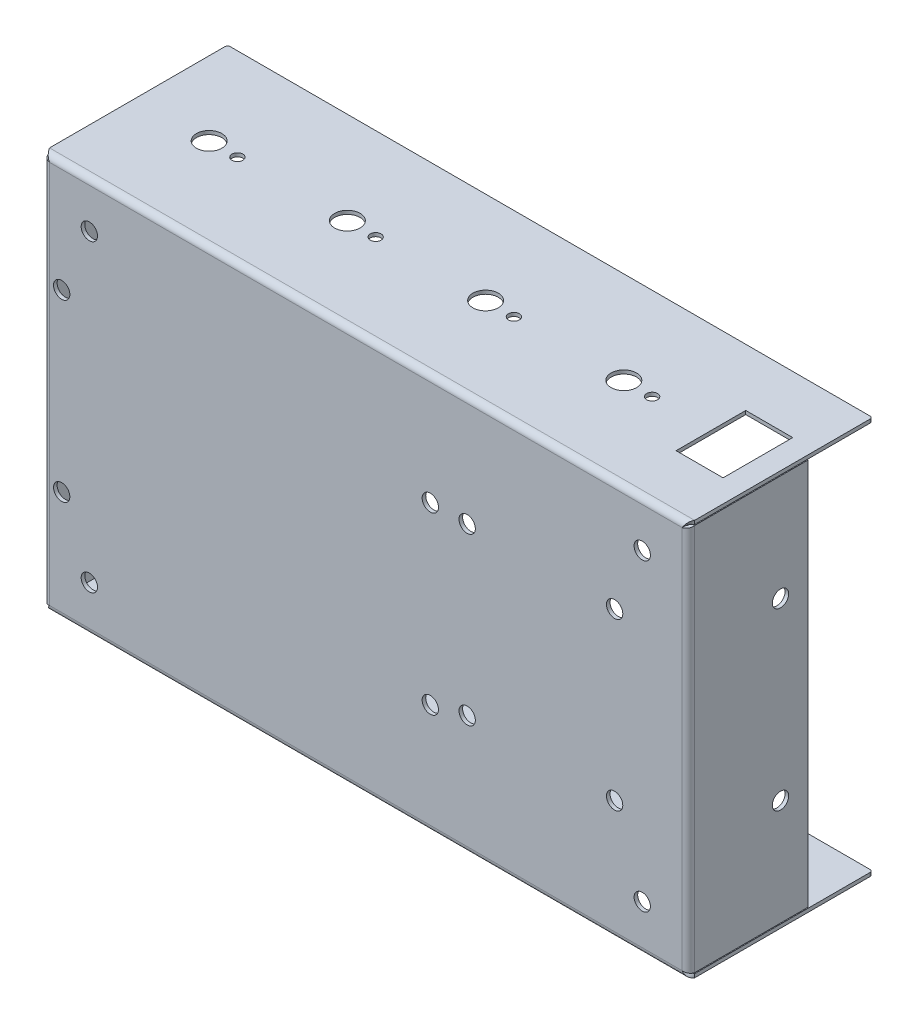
ISO-10303-21;
HEADER;
FILE_DESCRIPTION(('STEP AP214'),'2;1');
FILE_NAME('part.step','',(''),(''),'','','');
FILE_SCHEMA(('AUTOMOTIVE_DESIGN { 1 0 10303 214 1 1 1 1 }'));
ENDSEC;
DATA;
#1=APPLICATION_CONTEXT('core data for automotive mechanical design processes');
#2=APPLICATION_PROTOCOL_DEFINITION('international standard','automotive_design',2000,#1);
#3=PRODUCT_CONTEXT('',#1,'mechanical');
#4=PRODUCT('Part','Part','',(#3));
#5=PRODUCT_RELATED_PRODUCT_CATEGORY('part','',(#4));
#6=PRODUCT_DEFINITION_FORMATION('','',#4);
#7=PRODUCT_DEFINITION_CONTEXT('part definition',#1,'design');
#8=PRODUCT_DEFINITION('design','',#6,#7);
#9=PRODUCT_DEFINITION_SHAPE('','',#8);
#10=(LENGTH_UNIT() NAMED_UNIT(*) SI_UNIT(.MILLI.,.METRE.));
#11=(NAMED_UNIT(*) PLANE_ANGLE_UNIT() SI_UNIT($,.RADIAN.));
#12=(NAMED_UNIT(*) SI_UNIT($,.STERADIAN.) SOLID_ANGLE_UNIT());
#13=UNCERTAINTY_MEASURE_WITH_UNIT(LENGTH_MEASURE(1.E-05),#10,'distance_accuracy_value','');
#14=(GEOMETRIC_REPRESENTATION_CONTEXT(3) GLOBAL_UNCERTAINTY_ASSIGNED_CONTEXT((#13)) GLOBAL_UNIT_ASSIGNED_CONTEXT((#10,
#11,#12)) REPRESENTATION_CONTEXT('',''));
#15=CARTESIAN_POINT('',(0.,0.,0.));
#16=DIRECTION('',(0.,0.,1.));
#17=DIRECTION('',(1.,0.,0.));
#18=AXIS2_PLACEMENT_3D('',#15,#16,#17);
#19=CARTESIAN_POINT('',(0.,109.22,-0.990599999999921));
#20=DIRECTION('',(0.,0.,-1.));
#21=DIRECTION('',(-1.,0.,0.));
#22=AXIS2_PLACEMENT_3D('',#19,#20,#21);
#23=PLANE('',#22);
#24=CARTESIAN_POINT('',(165.1,96.5199999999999,-0.990599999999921));
#25=DIRECTION('',(0.,0.,-1.));
#26=DIRECTION('',(-1.,0.,0.));
#27=AXIS2_PLACEMENT_3D('',#24,#25,#26);
#28=CIRCLE('',#27,2.25043999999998);
#29=CARTESIAN_POINT('',(162.84956,96.5199999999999,-0.990599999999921));
#30=VERTEX_POINT('',#29);
#31=EDGE_CURVE('E1742',#30,#30,#28,.F.);
#32=ORIENTED_EDGE('',*,*,#31,.T.);
#33=EDGE_LOOP('',(#32));
#34=FACE_BOUND('',#33,.T.);
#35=CARTESIAN_POINT('',(165.1,12.6999999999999,-0.990599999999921));
#36=DIRECTION('',(0.,0.,-1.));
#37=DIRECTION('',(-1.,0.,0.));
#38=AXIS2_PLACEMENT_3D('',#35,#36,#37);
#39=CIRCLE('',#38,2.25043999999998);
#40=CARTESIAN_POINT('',(162.84956,12.6999999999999,-0.990599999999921));
#41=VERTEX_POINT('',#40);
#42=EDGE_CURVE('E1736',#41,#41,#39,.F.);
#43=ORIENTED_EDGE('',*,*,#42,.T.);
#44=EDGE_LOOP('',(#43));
#45=FACE_BOUND('',#44,.T.);
#46=CARTESIAN_POINT('',(157.48,33.0199999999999,-0.990599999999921));
#47=DIRECTION('',(0.,0.,-1.));
#48=DIRECTION('',(-1.,0.,0.));
#49=AXIS2_PLACEMENT_3D('',#46,#47,#48);
#50=CIRCLE('',#49,2.25043999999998);
#51=CARTESIAN_POINT('',(155.22956,33.0199999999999,-0.990599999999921));
#52=VERTEX_POINT('',#51);
#53=EDGE_CURVE('E1730',#52,#52,#50,.F.);
#54=ORIENTED_EDGE('',*,*,#53,.T.);
#55=EDGE_LOOP('',(#54));
#56=FACE_BOUND('',#55,.T.);
#57=CARTESIAN_POINT('',(157.48,78.7399999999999,-0.990599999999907));
#58=DIRECTION('',(0.,0.,-1.));
#59=DIRECTION('',(-1.,0.,0.));
#60=AXIS2_PLACEMENT_3D('',#57,#58,#59);
#61=CIRCLE('',#60,2.25043999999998);
#62=CARTESIAN_POINT('',(155.22956,78.7399999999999,-0.990599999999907));
#63=VERTEX_POINT('',#62);
#64=EDGE_CURVE('E1724',#63,#63,#61,.F.);
#65=ORIENTED_EDGE('',*,*,#64,.T.);
#66=EDGE_LOOP('',(#65));
#67=FACE_BOUND('',#66,.T.);
#68=CARTESIAN_POINT('',(116.84,78.7399999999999,-0.990599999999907));
#69=DIRECTION('',(0.,0.,-1.));
#70=DIRECTION('',(-1.,0.,0.));
#71=AXIS2_PLACEMENT_3D('',#68,#69,#70);
#72=CIRCLE('',#71,2.25044000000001);
#73=CARTESIAN_POINT('',(114.58956,78.7399999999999,-0.990599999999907));
#74=VERTEX_POINT('',#73);
#75=EDGE_CURVE('E1718',#74,#74,#72,.F.);
#76=ORIENTED_EDGE('',*,*,#75,.T.);
#77=EDGE_LOOP('',(#76));
#78=FACE_BOUND('',#77,.T.);
#79=CARTESIAN_POINT('',(116.84,33.0199999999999,-0.990599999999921));
#80=DIRECTION('',(0.,0.,-1.));
#81=DIRECTION('',(-1.,0.,0.));
#82=AXIS2_PLACEMENT_3D('',#79,#80,#81);
#83=CIRCLE('',#82,2.25044000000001);
#84=CARTESIAN_POINT('',(114.58956,33.0199999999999,-0.990599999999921));
#85=VERTEX_POINT('',#84);
#86=EDGE_CURVE('E1712',#85,#85,#83,.F.);
#87=ORIENTED_EDGE('',*,*,#86,.T.);
#88=EDGE_LOOP('',(#87));
#89=FACE_BOUND('',#88,.T.);
#90=CARTESIAN_POINT('',(106.68,78.7399999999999,-0.990599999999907));
#91=DIRECTION('',(0.,0.,-1.));
#92=DIRECTION('',(-1.,0.,0.));
#93=AXIS2_PLACEMENT_3D('',#90,#91,#92);
#94=CIRCLE('',#93,2.25044000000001);
#95=CARTESIAN_POINT('',(104.42956,78.7399999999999,-0.990599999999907));
#96=VERTEX_POINT('',#95);
#97=EDGE_CURVE('E1706',#96,#96,#94,.F.);
#98=ORIENTED_EDGE('',*,*,#97,.T.);
#99=EDGE_LOOP('',(#98));
#100=FACE_BOUND('',#99,.T.);
#101=CARTESIAN_POINT('',(106.68,30.4799999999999,-0.990599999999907));
#102=DIRECTION('',(0.,0.,-1.));
#103=DIRECTION('',(-1.,0.,0.));
#104=AXIS2_PLACEMENT_3D('',#101,#102,#103);
#105=CIRCLE('',#104,2.25044000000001);
#106=CARTESIAN_POINT('',(104.42956,30.4799999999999,-0.990599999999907));
#107=VERTEX_POINT('',#106);
#108=EDGE_CURVE('E1700',#107,#107,#105,.F.);
#109=ORIENTED_EDGE('',*,*,#108,.T.);
#110=EDGE_LOOP('',(#109));
#111=FACE_BOUND('',#110,.T.);
#112=CARTESIAN_POINT('',(12.7,12.6999999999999,-0.990599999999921));
#113=DIRECTION('',(0.,0.,-1.));
#114=DIRECTION('',(-1.,0.,0.));
#115=AXIS2_PLACEMENT_3D('',#112,#113,#114);
#116=CIRCLE('',#115,2.25044);
#117=CARTESIAN_POINT('',(10.44956,12.6999999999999,-0.990599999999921));
#118=VERTEX_POINT('',#117);
#119=EDGE_CURVE('E1694',#118,#118,#116,.F.);
#120=ORIENTED_EDGE('',*,*,#119,.T.);
#121=EDGE_LOOP('',(#120));
#122=FACE_BOUND('',#121,.T.);
#123=CARTESIAN_POINT('',(5.08,30.4799999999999,-0.990599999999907));
#124=DIRECTION('',(0.,0.,-1.));
#125=DIRECTION('',(-1.,0.,0.));
#126=AXIS2_PLACEMENT_3D('',#123,#124,#125);
#127=CIRCLE('',#126,2.25044);
#128=CARTESIAN_POINT('',(2.82956,30.4799999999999,-0.990599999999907));
#129=VERTEX_POINT('',#128);
#130=EDGE_CURVE('E1688',#129,#129,#127,.F.);
#131=ORIENTED_EDGE('',*,*,#130,.T.);
#132=EDGE_LOOP('',(#131));
#133=FACE_BOUND('',#132,.T.);
#134=CARTESIAN_POINT('',(5.08,78.7399999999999,-0.990599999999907));
#135=DIRECTION('',(0.,0.,-1.));
#136=DIRECTION('',(-1.,0.,0.));
#137=AXIS2_PLACEMENT_3D('',#134,#135,#136);
#138=CIRCLE('',#137,2.25044);
#139=CARTESIAN_POINT('',(2.82956,78.7399999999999,-0.990599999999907));
#140=VERTEX_POINT('',#139);
#141=EDGE_CURVE('E1682',#140,#140,#138,.F.);
#142=ORIENTED_EDGE('',*,*,#141,.T.);
#143=EDGE_LOOP('',(#142));
#144=FACE_BOUND('',#143,.T.);
#145=CARTESIAN_POINT('',(12.7,96.5199999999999,-0.990599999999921));
#146=DIRECTION('',(0.,0.,-1.));
#147=DIRECTION('',(-1.,0.,0.));
#148=AXIS2_PLACEMENT_3D('',#145,#146,#147);
#149=CIRCLE('',#148,2.25044);
#150=CARTESIAN_POINT('',(10.44956,96.5199999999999,-0.990599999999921));
#151=VERTEX_POINT('',#150);
#152=EDGE_CURVE('E1296',#151,#151,#149,.F.);
#153=ORIENTED_EDGE('',*,*,#152,.T.);
#154=EDGE_LOOP('',(#153));
#155=FACE_BOUND('',#154,.T.);
#156=DIRECTION('',(1.,0.,0.));
#157=VECTOR('',#156,1.);
#158=CARTESIAN_POINT('',(0.,1.72719999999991,-0.990599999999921));
#159=LINE('',#158,#157);
#160=CARTESIAN_POINT('',(1.72719999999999,1.72719999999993,-0.990599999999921));
#161=VERTEX_POINT('',#160);
#162=CARTESIAN_POINT('',(176.0728,1.72720000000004,-0.990599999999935));
#163=VERTEX_POINT('',#162);
#164=EDGE_CURVE('E860',#161,#163,#159,.T.);
#165=ORIENTED_EDGE('',*,*,#164,.F.);
#166=DIRECTION('',(0.,-1.,0.));
#167=VECTOR('',#166,1.);
#168=CARTESIAN_POINT('',(1.7272,107.4928,-0.990599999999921));
#169=LINE('',#168,#167);
#170=CARTESIAN_POINT('',(1.7272000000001,107.4928,-0.990599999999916));
#171=VERTEX_POINT('',#170);
#172=EDGE_CURVE('E1292',#171,#161,#169,.T.);
#173=ORIENTED_EDGE('',*,*,#172,.F.);
#174=DIRECTION('',(-1.,0.,0.));
#175=VECTOR('',#174,1.);
#176=CARTESIAN_POINT('',(177.8,107.4928,-0.990599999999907));
#177=LINE('',#176,#175);
#178=CARTESIAN_POINT('',(176.0728,107.4928,-0.990599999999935));
#179=VERTEX_POINT('',#178);
#180=EDGE_CURVE('E1271',#179,#171,#177,.T.);
#181=ORIENTED_EDGE('',*,*,#180,.F.);
#182=DIRECTION('',(0.,1.,0.));
#183=VECTOR('',#182,1.);
#184=CARTESIAN_POINT('',(176.0728,1.72719999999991,-0.990599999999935));
#185=LINE('',#184,#183);
#186=EDGE_CURVE('E859',#163,#179,#185,.T.);
#187=ORIENTED_EDGE('',*,*,#186,.F.);
#188=EDGE_LOOP('',(#165,#173,#181,#187));
#189=FACE_BOUND('',#188,.T.);
#190=ADVANCED_FACE('F251',(#34,#45,#56,#67,#78,#89,#100,#111,#122,#133,#144,#155,#189),#23,.T.);
#191=CARTESIAN_POINT('',(0.,109.22,0.));
#192=DIRECTION('',(0.,0.,-1.));
#193=DIRECTION('',(-1.,0.,0.));
#194=AXIS2_PLACEMENT_3D('',#191,#192,#193);
#195=PLANE('',#194);
#196=CARTESIAN_POINT('',(165.1,96.5199999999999,0.));
#197=DIRECTION('',(0.,0.,1.));
#198=DIRECTION('',(1.,0.,0.));
#199=AXIS2_PLACEMENT_3D('',#196,#197,#198);
#200=CIRCLE('',#199,2.25043999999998);
#201=CARTESIAN_POINT('',(167.35044,96.5199999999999,0.));
#202=VERTEX_POINT('',#201);
#203=EDGE_CURVE('E1223',#202,#202,#200,.T.);
#204=ORIENTED_EDGE('',*,*,#203,.F.);
#205=EDGE_LOOP('',(#204));
#206=FACE_BOUND('',#205,.T.);
#207=CARTESIAN_POINT('',(165.1,12.6999999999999,0.));
#208=DIRECTION('',(0.,0.,1.));
#209=DIRECTION('',(1.,0.,0.));
#210=AXIS2_PLACEMENT_3D('',#207,#208,#209);
#211=CIRCLE('',#210,2.25043999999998);
#212=CARTESIAN_POINT('',(167.35044,12.6999999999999,0.));
#213=VERTEX_POINT('',#212);
#214=EDGE_CURVE('E1739',#213,#213,#211,.T.);
#215=ORIENTED_EDGE('',*,*,#214,.F.);
#216=EDGE_LOOP('',(#215));
#217=FACE_BOUND('',#216,.T.);
#218=CARTESIAN_POINT('',(157.48,33.0199999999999,0.));
#219=DIRECTION('',(0.,0.,1.));
#220=DIRECTION('',(1.,0.,0.));
#221=AXIS2_PLACEMENT_3D('',#218,#219,#220);
#222=CIRCLE('',#221,2.25043999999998);
#223=CARTESIAN_POINT('',(159.73044,33.0199999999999,0.));
#224=VERTEX_POINT('',#223);
#225=EDGE_CURVE('E1733',#224,#224,#222,.T.);
#226=ORIENTED_EDGE('',*,*,#225,.F.);
#227=EDGE_LOOP('',(#226));
#228=FACE_BOUND('',#227,.T.);
#229=CARTESIAN_POINT('',(157.48,78.7399999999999,0.));
#230=DIRECTION('',(0.,0.,1.));
#231=DIRECTION('',(1.,0.,0.));
#232=AXIS2_PLACEMENT_3D('',#229,#230,#231);
#233=CIRCLE('',#232,2.25043999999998);
#234=CARTESIAN_POINT('',(159.73044,78.7399999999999,0.));
#235=VERTEX_POINT('',#234);
#236=EDGE_CURVE('E1727',#235,#235,#233,.T.);
#237=ORIENTED_EDGE('',*,*,#236,.F.);
#238=EDGE_LOOP('',(#237));
#239=FACE_BOUND('',#238,.T.);
#240=CARTESIAN_POINT('',(116.84,78.7399999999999,0.));
#241=DIRECTION('',(0.,0.,1.));
#242=DIRECTION('',(1.,0.,0.));
#243=AXIS2_PLACEMENT_3D('',#240,#241,#242);
#244=CIRCLE('',#243,2.25044000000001);
#245=CARTESIAN_POINT('',(119.09044,78.7399999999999,0.));
#246=VERTEX_POINT('',#245);
#247=EDGE_CURVE('E1721',#246,#246,#244,.T.);
#248=ORIENTED_EDGE('',*,*,#247,.F.);
#249=EDGE_LOOP('',(#248));
#250=FACE_BOUND('',#249,.T.);
#251=CARTESIAN_POINT('',(116.84,33.0199999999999,0.));
#252=DIRECTION('',(0.,0.,1.));
#253=DIRECTION('',(1.,0.,0.));
#254=AXIS2_PLACEMENT_3D('',#251,#252,#253);
#255=CIRCLE('',#254,2.25044000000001);
#256=CARTESIAN_POINT('',(119.09044,33.0199999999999,0.));
#257=VERTEX_POINT('',#256);
#258=EDGE_CURVE('E1715',#257,#257,#255,.T.);
#259=ORIENTED_EDGE('',*,*,#258,.F.);
#260=EDGE_LOOP('',(#259));
#261=FACE_BOUND('',#260,.T.);
#262=CARTESIAN_POINT('',(106.68,78.7399999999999,0.));
#263=DIRECTION('',(0.,0.,1.));
#264=DIRECTION('',(1.,0.,0.));
#265=AXIS2_PLACEMENT_3D('',#262,#263,#264);
#266=CIRCLE('',#265,2.25044000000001);
#267=CARTESIAN_POINT('',(108.93044,78.7399999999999,0.));
#268=VERTEX_POINT('',#267);
#269=EDGE_CURVE('E1709',#268,#268,#266,.T.);
#270=ORIENTED_EDGE('',*,*,#269,.F.);
#271=EDGE_LOOP('',(#270));
#272=FACE_BOUND('',#271,.T.);
#273=CARTESIAN_POINT('',(106.68,30.4799999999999,0.));
#274=DIRECTION('',(0.,0.,1.));
#275=DIRECTION('',(1.,0.,0.));
#276=AXIS2_PLACEMENT_3D('',#273,#274,#275);
#277=CIRCLE('',#276,2.25044000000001);
#278=CARTESIAN_POINT('',(108.93044,30.4799999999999,0.));
#279=VERTEX_POINT('',#278);
#280=EDGE_CURVE('E1703',#279,#279,#277,.T.);
#281=ORIENTED_EDGE('',*,*,#280,.F.);
#282=EDGE_LOOP('',(#281));
#283=FACE_BOUND('',#282,.T.);
#284=CARTESIAN_POINT('',(12.7,12.6999999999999,0.));
#285=DIRECTION('',(0.,0.,1.));
#286=DIRECTION('',(1.,0.,0.));
#287=AXIS2_PLACEMENT_3D('',#284,#285,#286);
#288=CIRCLE('',#287,2.25044);
#289=CARTESIAN_POINT('',(14.95044,12.6999999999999,0.));
#290=VERTEX_POINT('',#289);
#291=EDGE_CURVE('E1697',#290,#290,#288,.T.);
#292=ORIENTED_EDGE('',*,*,#291,.F.);
#293=EDGE_LOOP('',(#292));
#294=FACE_BOUND('',#293,.T.);
#295=CARTESIAN_POINT('',(5.08,30.4799999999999,0.));
#296=DIRECTION('',(0.,0.,1.));
#297=DIRECTION('',(1.,0.,0.));
#298=AXIS2_PLACEMENT_3D('',#295,#296,#297);
#299=CIRCLE('',#298,2.25044);
#300=CARTESIAN_POINT('',(7.33044,30.4799999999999,0.));
#301=VERTEX_POINT('',#300);
#302=EDGE_CURVE('E1691',#301,#301,#299,.T.);
#303=ORIENTED_EDGE('',*,*,#302,.F.);
#304=EDGE_LOOP('',(#303));
#305=FACE_BOUND('',#304,.T.);
#306=CARTESIAN_POINT('',(5.08,78.7399999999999,0.));
#307=DIRECTION('',(0.,0.,1.));
#308=DIRECTION('',(1.,0.,0.));
#309=AXIS2_PLACEMENT_3D('',#306,#307,#308);
#310=CIRCLE('',#309,2.25044);
#311=CARTESIAN_POINT('',(7.33044,78.7399999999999,0.));
#312=VERTEX_POINT('',#311);
#313=EDGE_CURVE('E1685',#312,#312,#310,.T.);
#314=ORIENTED_EDGE('',*,*,#313,.F.);
#315=EDGE_LOOP('',(#314));
#316=FACE_BOUND('',#315,.T.);
#317=CARTESIAN_POINT('',(12.7,96.5199999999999,0.));
#318=DIRECTION('',(0.,0.,1.));
#319=DIRECTION('',(1.,0.,0.));
#320=AXIS2_PLACEMENT_3D('',#317,#318,#319);
#321=CIRCLE('',#320,2.25044);
#322=CARTESIAN_POINT('',(14.95044,96.5199999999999,0.));
#323=VERTEX_POINT('',#322);
#324=EDGE_CURVE('E1679',#323,#323,#321,.T.);
#325=ORIENTED_EDGE('',*,*,#324,.F.);
#326=EDGE_LOOP('',(#325));
#327=FACE_BOUND('',#326,.T.);
#328=DIRECTION('',(0.,-1.,0.));
#329=VECTOR('',#328,1.);
#330=CARTESIAN_POINT('',(1.7272,107.4928,0.));
#331=LINE('',#330,#329);
#332=CARTESIAN_POINT('',(1.7272,107.4928,0.));
#333=VERTEX_POINT('',#332);
#334=CARTESIAN_POINT('',(1.72719999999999,1.72719999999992,0.));
#335=VERTEX_POINT('',#334);
#336=EDGE_CURVE('E1275',#333,#335,#331,.T.);
#337=ORIENTED_EDGE('',*,*,#336,.T.);
#338=DIRECTION('',(1.,0.,0.));
#339=VECTOR('',#338,1.);
#340=CARTESIAN_POINT('',(0.,1.72719999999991,0.));
#341=LINE('',#340,#339);
#342=CARTESIAN_POINT('',(176.0728,1.72719999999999,0.));
#343=VERTEX_POINT('',#342);
#344=EDGE_CURVE('E269',#335,#343,#341,.T.);
#345=ORIENTED_EDGE('',*,*,#344,.T.);
#346=DIRECTION('',(0.,1.,0.));
#347=VECTOR('',#346,1.);
#348=CARTESIAN_POINT('',(176.0728,1.72719999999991,0.));
#349=LINE('',#348,#347);
#350=CARTESIAN_POINT('',(176.0728,107.4928,0.));
#351=VERTEX_POINT('',#350);
#352=EDGE_CURVE('E262',#343,#351,#349,.T.);
#353=ORIENTED_EDGE('',*,*,#352,.T.);
#354=DIRECTION('',(-1.,0.,0.));
#355=VECTOR('',#354,1.);
#356=CARTESIAN_POINT('',(177.8,107.4928,0.));
#357=LINE('',#356,#355);
#358=EDGE_CURVE('E1007',#351,#333,#357,.T.);
#359=ORIENTED_EDGE('',*,*,#358,.T.);
#360=EDGE_LOOP('',(#337,#345,#353,#359));
#361=FACE_BOUND('',#360,.T.);
#362=ADVANCED_FACE('F253',(#206,#217,#228,#239,#250,#261,#272,#283,#294,#305,#316,#327,#361),
#195,.F.);
#363=CARTESIAN_POINT('',(12.7,96.5199999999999,-7.35580553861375));
#364=DIRECTION('',(0.,0.,1.));
#365=DIRECTION('',(1.,0.,0.));
#366=AXIS2_PLACEMENT_3D('',#363,#364,#365);
#367=CYLINDRICAL_SURFACE('',#366,2.25044);
#368=ORIENTED_EDGE('',*,*,#324,.T.);
#369=EDGE_LOOP('',(#368));
#370=FACE_BOUND('',#369,.T.);
#371=ORIENTED_EDGE('',*,*,#152,.F.);
#372=EDGE_LOOP('',(#371));
#373=FACE_BOUND('',#372,.T.);
#374=ADVANCED_FACE('F760',(#370,#373),#367,.F.);
#375=CARTESIAN_POINT('',(5.08,78.7399999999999,-7.35580553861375));
#376=DIRECTION('',(0.,0.,1.));
#377=DIRECTION('',(1.,0.,0.));
#378=AXIS2_PLACEMENT_3D('',#375,#376,#377);
#379=CYLINDRICAL_SURFACE('',#378,2.25044);
#380=ORIENTED_EDGE('',*,*,#313,.T.);
#381=EDGE_LOOP('',(#380));
#382=FACE_BOUND('',#381,.T.);
#383=ORIENTED_EDGE('',*,*,#141,.F.);
#384=EDGE_LOOP('',(#383));
#385=FACE_BOUND('',#384,.T.);
#386=ADVANCED_FACE('F767',(#382,#385),#379,.F.);
#387=CARTESIAN_POINT('',(5.08,30.4799999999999,-7.35580553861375));
#388=DIRECTION('',(0.,0.,1.));
#389=DIRECTION('',(1.,0.,0.));
#390=AXIS2_PLACEMENT_3D('',#387,#388,#389);
#391=CYLINDRICAL_SURFACE('',#390,2.25044);
#392=ORIENTED_EDGE('',*,*,#302,.T.);
#393=EDGE_LOOP('',(#392));
#394=FACE_BOUND('',#393,.T.);
#395=ORIENTED_EDGE('',*,*,#130,.F.);
#396=EDGE_LOOP('',(#395));
#397=FACE_BOUND('',#396,.T.);
#398=ADVANCED_FACE('F771',(#394,#397),#391,.F.);
#399=CARTESIAN_POINT('',(12.7,12.6999999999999,-7.35580553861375));
#400=DIRECTION('',(0.,0.,1.));
#401=DIRECTION('',(1.,0.,0.));
#402=AXIS2_PLACEMENT_3D('',#399,#400,#401);
#403=CYLINDRICAL_SURFACE('',#402,2.25044);
#404=ORIENTED_EDGE('',*,*,#291,.T.);
#405=EDGE_LOOP('',(#404));
#406=FACE_BOUND('',#405,.T.);
#407=ORIENTED_EDGE('',*,*,#119,.F.);
#408=EDGE_LOOP('',(#407));
#409=FACE_BOUND('',#408,.T.);
#410=ADVANCED_FACE('F775',(#406,#409),#403,.F.);
#411=CARTESIAN_POINT('',(106.68,30.4799999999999,-7.35580553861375));
#412=DIRECTION('',(0.,0.,1.));
#413=DIRECTION('',(1.,0.,0.));
#414=AXIS2_PLACEMENT_3D('',#411,#412,#413);
#415=CYLINDRICAL_SURFACE('',#414,2.25044000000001);
#416=ORIENTED_EDGE('',*,*,#280,.T.);
#417=EDGE_LOOP('',(#416));
#418=FACE_BOUND('',#417,.T.);
#419=ORIENTED_EDGE('',*,*,#108,.F.);
#420=EDGE_LOOP('',(#419));
#421=FACE_BOUND('',#420,.T.);
#422=ADVANCED_FACE('F779',(#418,#421),#415,.F.);
#423=CARTESIAN_POINT('',(106.68,78.7399999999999,-7.35580553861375));
#424=DIRECTION('',(0.,0.,1.));
#425=DIRECTION('',(1.,0.,0.));
#426=AXIS2_PLACEMENT_3D('',#423,#424,#425);
#427=CYLINDRICAL_SURFACE('',#426,2.25044000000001);
#428=ORIENTED_EDGE('',*,*,#269,.T.);
#429=EDGE_LOOP('',(#428));
#430=FACE_BOUND('',#429,.T.);
#431=ORIENTED_EDGE('',*,*,#97,.F.);
#432=EDGE_LOOP('',(#431));
#433=FACE_BOUND('',#432,.T.);
#434=ADVANCED_FACE('F783',(#430,#433),#427,.F.);
#435=CARTESIAN_POINT('',(116.84,33.0199999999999,-7.35580553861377));
#436=DIRECTION('',(0.,0.,1.));
#437=DIRECTION('',(1.,0.,0.));
#438=AXIS2_PLACEMENT_3D('',#435,#436,#437);
#439=CYLINDRICAL_SURFACE('',#438,2.25044000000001);
#440=ORIENTED_EDGE('',*,*,#258,.T.);
#441=EDGE_LOOP('',(#440));
#442=FACE_BOUND('',#441,.T.);
#443=ORIENTED_EDGE('',*,*,#86,.F.);
#444=EDGE_LOOP('',(#443));
#445=FACE_BOUND('',#444,.T.);
#446=ADVANCED_FACE('F787',(#442,#445),#439,.F.);
#447=CARTESIAN_POINT('',(116.84,78.7399999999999,-7.35580553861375));
#448=DIRECTION('',(0.,0.,1.));
#449=DIRECTION('',(1.,0.,0.));
#450=AXIS2_PLACEMENT_3D('',#447,#448,#449);
#451=CYLINDRICAL_SURFACE('',#450,2.25044000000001);
#452=ORIENTED_EDGE('',*,*,#247,.T.);
#453=EDGE_LOOP('',(#452));
#454=FACE_BOUND('',#453,.T.);
#455=ORIENTED_EDGE('',*,*,#75,.F.);
#456=EDGE_LOOP('',(#455));
#457=FACE_BOUND('',#456,.T.);
#458=ADVANCED_FACE('F791',(#454,#457),#451,.F.);
#459=CARTESIAN_POINT('',(157.48,78.7399999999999,-7.35580553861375));
#460=DIRECTION('',(0.,0.,1.));
#461=DIRECTION('',(1.,0.,0.));
#462=AXIS2_PLACEMENT_3D('',#459,#460,#461);
#463=CYLINDRICAL_SURFACE('',#462,2.25043999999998);
#464=ORIENTED_EDGE('',*,*,#236,.T.);
#465=EDGE_LOOP('',(#464));
#466=FACE_BOUND('',#465,.T.);
#467=ORIENTED_EDGE('',*,*,#64,.F.);
#468=EDGE_LOOP('',(#467));
#469=FACE_BOUND('',#468,.T.);
#470=ADVANCED_FACE('F795',(#466,#469),#463,.F.);
#471=CARTESIAN_POINT('',(157.48,33.0199999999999,-7.35580553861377));
#472=DIRECTION('',(0.,0.,1.));
#473=DIRECTION('',(1.,0.,0.));
#474=AXIS2_PLACEMENT_3D('',#471,#472,#473);
#475=CYLINDRICAL_SURFACE('',#474,2.25043999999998);
#476=ORIENTED_EDGE('',*,*,#225,.T.);
#477=EDGE_LOOP('',(#476));
#478=FACE_BOUND('',#477,.T.);
#479=ORIENTED_EDGE('',*,*,#53,.F.);
#480=EDGE_LOOP('',(#479));
#481=FACE_BOUND('',#480,.T.);
#482=ADVANCED_FACE('F799',(#478,#481),#475,.F.);
#483=CARTESIAN_POINT('',(165.1,12.6999999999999,-7.35580553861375));
#484=DIRECTION('',(0.,0.,1.));
#485=DIRECTION('',(1.,0.,0.));
#486=AXIS2_PLACEMENT_3D('',#483,#484,#485);
#487=CYLINDRICAL_SURFACE('',#486,2.25043999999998);
#488=ORIENTED_EDGE('',*,*,#214,.T.);
#489=EDGE_LOOP('',(#488));
#490=FACE_BOUND('',#489,.T.);
#491=ORIENTED_EDGE('',*,*,#42,.F.);
#492=EDGE_LOOP('',(#491));
#493=FACE_BOUND('',#492,.T.);
#494=ADVANCED_FACE('F803',(#490,#493),#487,.F.);
#495=CARTESIAN_POINT('',(165.1,96.5199999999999,-7.35580553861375));
#496=DIRECTION('',(0.,0.,1.));
#497=DIRECTION('',(1.,0.,0.));
#498=AXIS2_PLACEMENT_3D('',#495,#496,#497);
#499=CYLINDRICAL_SURFACE('',#498,2.25043999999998);
#500=ORIENTED_EDGE('',*,*,#203,.T.);
#501=EDGE_LOOP('',(#500));
#502=FACE_BOUND('',#501,.T.);
#503=ORIENTED_EDGE('',*,*,#31,.F.);
#504=EDGE_LOOP('',(#503));
#505=FACE_BOUND('',#504,.T.);
#506=ADVANCED_FACE('F807',(#502,#505),#499,.F.);
#507=CARTESIAN_POINT('',(-0.0100050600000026,107.9754,-1.7271999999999));
#508=CARTESIAN_POINT('',(-0.0100050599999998,107.935176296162,-1.49976062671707));
#509=CARTESIAN_POINT('',(0.0352097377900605,107.894966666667,-1.27249025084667));
#510=CARTESIAN_POINT('',(0.209253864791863,107.814533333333,-0.852310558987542));
#511=CARTESIAN_POINT('',(0.338014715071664,107.774316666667,-0.659606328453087));
#512=CARTESIAN_POINT('',(0.659606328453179,107.693883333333,-0.338014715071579));
#513=CARTESIAN_POINT('',(0.852310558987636,107.653666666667,-0.209253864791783));
#514=CARTESIAN_POINT('',(1.27249025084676,107.573233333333,-0.0352097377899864));
#515=CARTESIAN_POINT('',(1.49976062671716,107.533023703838,0.0100050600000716));
#516=CARTESIAN_POINT('',(1.7272,107.4928,0.0100050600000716));
#517=CARTESIAN_POINT('',(0.,107.9754,-1.7271999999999));
#518=CARTESIAN_POINT('',(0.,107.935176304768,-1.50107053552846));
#519=CARTESIAN_POINT('',(0.0449543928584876,107.894966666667,-1.27510905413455));
#520=CARTESIAN_POINT('',(0.217996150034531,107.814533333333,-0.85734929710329));
#521=CARTESIAN_POINT('',(0.346015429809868,107.774316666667,-0.665754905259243));
#522=CARTESIAN_POINT('',(0.665754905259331,107.693883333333,-0.346015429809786));
#523=CARTESIAN_POINT('',(0.857349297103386,107.653666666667,-0.217996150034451));
#524=CARTESIAN_POINT('',(1.27510905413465,107.573233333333,-0.0449543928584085));
#525=CARTESIAN_POINT('',(1.50107053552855,107.533023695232,0.));
#526=CARTESIAN_POINT('',(1.7272,107.4928,0.));
#527=CARTESIAN_POINT('',(0.990599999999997,107.9754,-1.72719999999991));
#528=CARTESIAN_POINT('',(0.990599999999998,107.935177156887,-1.63076447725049));
#529=CARTESIAN_POINT('',(1.00977172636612,107.894966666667,-1.53439650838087));
#530=CARTESIAN_POINT('',(1.08356894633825,107.814533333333,-1.35623425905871));
#531=CARTESIAN_POINT('',(1.1381654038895,107.774316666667,-1.2745248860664));
#532=CARTESIAN_POINT('',(1.27452488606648,107.693883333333,-1.13816540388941));
#533=CARTESIAN_POINT('',(1.3562342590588,107.653666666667,-1.08356894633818));
#534=CARTESIAN_POINT('',(1.53439650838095,107.573233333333,-1.00977172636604));
#535=CARTESIAN_POINT('',(1.63076447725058,107.533022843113,-0.990599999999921));
#536=CARTESIAN_POINT('',(1.7272,107.4928,-0.990599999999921));
#537=CARTESIAN_POINT('',(1.000506,107.9754,-1.72719999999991));
#538=CARTESIAN_POINT('',(1.000506,107.935177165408,-1.63206141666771));
#539=CARTESIAN_POINT('',(1.01941989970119,107.894966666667,-1.53698938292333));
#540=CARTESIAN_POINT('',(1.09222467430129,107.814533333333,-1.36122310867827));
#541=CARTESIAN_POINT('',(1.1460869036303,107.774316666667,-1.28061258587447));
#542=CARTESIAN_POINT('',(1.28061258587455,107.693883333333,-1.14608690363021));
#543=CARTESIAN_POINT('',(1.36122310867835,107.653666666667,-1.09222467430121));
#544=CARTESIAN_POINT('',(1.53698938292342,107.573233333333,-1.01941989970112));
#545=CARTESIAN_POINT('',(1.6320614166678,107.533022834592,-1.00050599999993));
#546=CARTESIAN_POINT('',(1.7272,107.4928,-1.00050599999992));
#547=B_SPLINE_SURFACE_WITH_KNOTS('',1,3,((#507,#508,#509,#510,#511,#512,#513,#514,#515,#516),
(#517,#518,#519,#520,#521,#522,#523,#524,#525,#526),(#527,#528,#529,#530,#531,#532,#533,#534,
#535,#536),(#537,#538,#539,#540,#541,#542,#543,#544,#545,#546)),.UNSPECIFIED.,.F.,.F.,.F.,(2,1,
1,2),(4,2,2,2,4),(-0.0101,0.,1.,1.01),(0.,0.25,0.5,0.75,1.),.UNSPECIFIED.);
#548=CARTESIAN_POINT('',(1.000506,107.9754,-1.72719999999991));
#549=CARTESIAN_POINT('',(0.990599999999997,107.9754,-1.72719999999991));
#550=CARTESIAN_POINT('',(0.,107.9754,-1.7271999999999));
#551=CARTESIAN_POINT('',(-0.0100050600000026,107.9754,-1.7271999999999));
#552=B_SPLINE_CURVE_WITH_KNOTS('',1,(#548,#549,#550,#551),.UNSPECIFIED.,.F.,.F.,(2,1,1,2),
(-0.0101,-9.9999999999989E-05,0.9999,1.01),.UNSPECIFIED.);
#553=CARTESIAN_POINT('',(0.990599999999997,107.9754,-1.72719999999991));
#554=VERTEX_POINT('',#553);
#555=CARTESIAN_POINT('',(0.,107.9754,-1.72719999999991));
#556=VERTEX_POINT('',#555);
#557=EDGE_CURVE('E1430',#554,#556,#552,.T.);
#558=CARTESIAN_POINT('',(0.,107.9754,-1.7271999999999));
#559=CARTESIAN_POINT('',(-5.99491734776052E-07,107.970372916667,-1.6989387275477));
#560=CARTESIAN_POINT('',(0.000693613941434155,107.965345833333,-1.67067750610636));
#561=CARTESIAN_POINT('',(0.00346736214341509,107.955291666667,-1.61422311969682));
#562=CARTESIAN_POINT('',(0.0055468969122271,107.950264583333,-1.58602995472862));
#563=CARTESIAN_POINT('',(0.0110869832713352,107.940210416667,-1.52977963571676));
#564=CARTESIAN_POINT('',(0.0145475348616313,107.935183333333,-1.50172248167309));
#565=CARTESIAN_POINT('',(0.0228411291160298,107.925129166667,-1.44581176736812));
#566=CARTESIAN_POINT('',(0.0276741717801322,107.920102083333,-1.41795820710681));
#567=CARTESIAN_POINT('',(0.0387011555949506,107.910047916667,-1.36252178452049));
#568=CARTESIAN_POINT('',(0.0448950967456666,107.905020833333,-1.33493892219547));
#569=CARTESIAN_POINT('',(0.0586289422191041,107.894966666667,-1.28011034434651));
#570=CARTESIAN_POINT('',(0.0661688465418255,107.889939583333,-1.25286462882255));
#571=CARTESIAN_POINT('',(0.0825764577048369,107.879885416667,-1.19877598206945));
#572=CARTESIAN_POINT('',(0.0914441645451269,107.874858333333,-1.1719330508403));
#573=CARTESIAN_POINT('',(0.110486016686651,107.864804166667,-1.11871463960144));
#574=CARTESIAN_POINT('',(0.120660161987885,107.859777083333,-1.09233915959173));
#575=CARTESIAN_POINT('',(0.142290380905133,107.849722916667,-1.04011919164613));
#576=CARTESIAN_POINT('',(0.153746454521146,107.844695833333,-1.01427470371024));
#577=CARTESIAN_POINT('',(0.177912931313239,107.834641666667,-0.963178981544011));
#578=CARTESIAN_POINT('',(0.190623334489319,107.829614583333,-0.937927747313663));
#579=CARTESIAN_POINT('',(0.217267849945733,107.819560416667,-0.888079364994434));
#580=CARTESIAN_POINT('',(0.231201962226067,107.814533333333,-0.863482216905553));
#581=CARTESIAN_POINT('',(0.260260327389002,107.804479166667,-0.81500126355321));
#582=CARTESIAN_POINT('',(0.275384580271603,107.799452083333,-0.791117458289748));
#583=CARTESIAN_POINT('',(0.306786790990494,107.789397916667,-0.744120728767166));
#584=CARTESIAN_POINT('',(0.323064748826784,107.784370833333,-0.721007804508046));
#585=CARTESIAN_POINT('',(0.356735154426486,107.774316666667,-0.675608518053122));
#586=CARTESIAN_POINT('',(0.374127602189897,107.769289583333,-0.653322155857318));
#587=CARTESIAN_POINT('',(0.409985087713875,107.759235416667,-0.609629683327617));
#588=CARTESIAN_POINT('',(0.428450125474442,107.754208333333,-0.588223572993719));
#589=CARTESIAN_POINT('',(0.466408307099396,107.744154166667,-0.546343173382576));
#590=CARTESIAN_POINT('',(0.485901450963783,107.739127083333,-0.52586888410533));
#591=CARTESIAN_POINT('',(0.525868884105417,107.729072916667,-0.485901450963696));
#592=CARTESIAN_POINT('',(0.546343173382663,107.724045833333,-0.466408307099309));
#593=CARTESIAN_POINT('',(0.588223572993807,107.713991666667,-0.428450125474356));
#594=CARTESIAN_POINT('',(0.609629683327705,107.708964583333,-0.409985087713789));
#595=CARTESIAN_POINT('',(0.653322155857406,107.698910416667,-0.374127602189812));
#596=CARTESIAN_POINT('',(0.675608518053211,107.693883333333,-0.356735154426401));
#597=CARTESIAN_POINT('',(0.721007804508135,107.683829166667,-0.3230647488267));
#598=CARTESIAN_POINT('',(0.744120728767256,107.678802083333,-0.30678679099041));
#599=CARTESIAN_POINT('',(0.791117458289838,107.668747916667,-0.275384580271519));
#600=CARTESIAN_POINT('',(0.815001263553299,107.663720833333,-0.260260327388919));
#601=CARTESIAN_POINT('',(0.863482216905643,107.653666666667,-0.231201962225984));
#602=CARTESIAN_POINT('',(0.888079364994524,107.648639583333,-0.21726784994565));
#603=CARTESIAN_POINT('',(0.937927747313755,107.638585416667,-0.190623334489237));
#604=CARTESIAN_POINT('',(0.963178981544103,107.633558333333,-0.177912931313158));
#605=CARTESIAN_POINT('',(1.01427470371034,107.623504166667,-0.153746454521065));
#606=CARTESIAN_POINT('',(1.04011919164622,107.618477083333,-0.142290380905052));
#607=CARTESIAN_POINT('',(1.09233915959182,107.608422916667,-0.120660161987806));
#608=CARTESIAN_POINT('',(1.11871463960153,107.603395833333,-0.110486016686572));
#609=CARTESIAN_POINT('',(1.17193305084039,107.593341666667,-0.0914441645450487));
#610=CARTESIAN_POINT('',(1.19877598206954,107.588314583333,-0.0825764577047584));
#611=CARTESIAN_POINT('',(1.25286462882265,107.578260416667,-0.0661688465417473));
#612=CARTESIAN_POINT('',(1.2801103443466,107.573233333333,-0.0586289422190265));
#613=CARTESIAN_POINT('',(1.33493892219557,107.563179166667,-0.0448950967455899));
#614=CARTESIAN_POINT('',(1.36252178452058,107.558152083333,-0.0387011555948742));
#615=CARTESIAN_POINT('',(1.4179582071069,107.548097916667,-0.0276741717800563));
#616=CARTESIAN_POINT('',(1.44581176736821,107.543070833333,-0.0228411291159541));
#617=CARTESIAN_POINT('',(1.50172248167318,107.533016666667,-0.0145475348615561));
#618=CARTESIAN_POINT('',(1.52977963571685,107.527989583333,-0.0110869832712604));
#619=CARTESIAN_POINT('',(1.58602995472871,107.517935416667,-0.00554689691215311));
#620=CARTESIAN_POINT('',(1.61422311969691,107.512908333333,-0.00346736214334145));
#621=CARTESIAN_POINT('',(1.67067750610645,107.502854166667,-0.000693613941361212));
#622=CARTESIAN_POINT('',(1.69893872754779,107.497827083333,5.9949180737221E-07));
#623=CARTESIAN_POINT('',(1.7272,107.4928,0.));
#624=B_SPLINE_CURVE_WITH_KNOTS('',3,(#558,#559,#560,#561,#562,#563,#564,#565,#566,#567,#568,
#569,#570,#571,#572,#573,#574,#575,#576,#577,#578,#579,#580,#581,#582,#583,#584,#585,#586,#587,
#588,#589,#590,#591,#592,#593,#594,#595,#596,#597,#598,#599,#600,#601,#602,#603,#604,#605,#606,
#607,#608,#609,#610,#611,#612,#613,#614,#615,#616,#617,#618,#619,#620,#621,#622,#623),
.UNSPECIFIED.,.F.,.F.,(4,2,2,2,2,2,2,2,2,2,2,2,2,2,2,2,2,2,2,2,2,2,2,2,2,2,2,2,2,2,2,2,4),(0.,
0.0861062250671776,0.172212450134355,0.258318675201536,0.344424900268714,0.430531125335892,
0.516637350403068,0.60274357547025,0.688849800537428,0.774956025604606,0.861062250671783,
0.947168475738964,1.03327470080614,1.11938092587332,1.2054871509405,1.29159337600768,
1.37769960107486,1.46380582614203,1.54991205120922,1.63601827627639,1.72212450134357,
1.80823072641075,1.89433695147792,1.9804431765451,2.06654940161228,2.15265562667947,
2.23876185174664,2.32486807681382,2.410974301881,2.49708052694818,2.58318675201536,
2.66929297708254,2.75539920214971),.UNSPECIFIED.);
#625=EDGE_CURVE('E1268',#556,#333,#624,.T.);
#626=CARTESIAN_POINT('',(1.7272,107.4928,0.0100050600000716));
#627=CARTESIAN_POINT('',(1.7272,107.4928,0.));
#628=CARTESIAN_POINT('',(1.7272,107.4928,-0.990599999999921));
#629=CARTESIAN_POINT('',(1.7272,107.4928,-1.00050599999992));
#630=B_SPLINE_CURVE_WITH_KNOTS('',1,(#626,#627,#628,#629),.UNSPECIFIED.,.F.,.F.,(2,1,1,2),
(-0.0101,0.,1.,1.01),.UNSPECIFIED.);
#631=EDGE_CURVE('E1274',#333,#171,#630,.T.);
#632=CARTESIAN_POINT('',(0.990599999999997,107.9754,-1.72719999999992));
#633=CARTESIAN_POINT('',(0.990599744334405,107.970372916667,-1.71514739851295));
#634=CARTESIAN_POINT('',(0.99089580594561,107.965345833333,-1.70309481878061));
#635=CARTESIAN_POINT('',(0.992078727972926,107.955291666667,-1.67901868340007));
#636=CARTESIAN_POINT('',(0.992965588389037,107.950264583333,-1.66699512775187));
#637=CARTESIAN_POINT('',(0.99532827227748,107.940210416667,-1.64300602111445));
#638=CARTESIAN_POINT('',(0.996804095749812,107.935183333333,-1.63104047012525));
#639=CARTESIAN_POINT('',(1.00034106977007,107.925129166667,-1.60719619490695));
#640=CARTESIAN_POINT('',(1.002402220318,107.920102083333,-1.59531747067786));
#641=CARTESIAN_POINT('',(1.00710490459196,107.910047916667,-1.57167546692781));
#642=CARTESIAN_POINT('',(1.009746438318,107.905020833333,-1.55991218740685));
#643=CARTESIAN_POINT('',(1.01560351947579,107.894966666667,-1.5365294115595));
#644=CARTESIAN_POINT('',(1.01881906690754,107.889939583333,-1.5249099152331));
#645=CARTESIAN_POINT('',(1.02581643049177,107.879885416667,-1.50184269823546));
#646=CARTESIAN_POINT('',(1.02959824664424,107.874858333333,-1.4903949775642));
#647=CARTESIAN_POINT('',(1.03771903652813,107.864804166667,-1.46769889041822));
#648=CARTESIAN_POINT('',(1.04205801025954,107.859777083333,-1.45645052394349));
#649=CARTESIAN_POINT('',(1.05128266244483,107.849722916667,-1.4341802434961));
#650=CARTESIAN_POINT('',(1.05616834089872,107.844695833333,-1.42315832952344));
#651=CARTESIAN_POINT('',(1.06647463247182,107.834641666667,-1.4013675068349));
#652=CARTESIAN_POINT('',(1.07189524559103,107.829614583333,-1.39059859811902));
#653=CARTESIAN_POINT('',(1.08325834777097,107.819560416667,-1.36933972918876));
#654=CARTESIAN_POINT('',(1.0892008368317,107.814533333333,-1.35884976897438));
#655=CARTESIAN_POINT('',(1.1015933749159,107.804479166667,-1.33817406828));
#656=CARTESIAN_POINT('',(1.10804342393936,107.799452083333,-1.3279883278));
#657=CARTESIAN_POINT('',(1.12143554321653,107.789397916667,-1.30794560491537));
#658=CARTESIAN_POINT('',(1.12837761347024,107.784370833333,-1.29808862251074));
#659=CARTESIAN_POINT('',(1.14273705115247,107.774316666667,-1.27872716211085));
#660=CARTESIAN_POINT('',(1.15015441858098,107.769289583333,-1.26922268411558));
#661=CARTESIAN_POINT('',(1.16544658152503,107.759235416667,-1.25058912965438));
#662=CARTESIAN_POINT('',(1.17332137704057,107.754208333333,-1.24146005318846));
#663=CARTESIAN_POINT('',(1.1895094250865,107.744154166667,-1.22359929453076));
#664=CARTESIAN_POINT('',(1.19782267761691,107.739127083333,-1.214867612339));
#665=CARTESIAN_POINT('',(1.21486761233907,107.729072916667,-1.19782267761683));
#666=CARTESIAN_POINT('',(1.22359929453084,107.724045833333,-1.18950942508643));
#667=CARTESIAN_POINT('',(1.24146005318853,107.713991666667,-1.17332137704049));
#668=CARTESIAN_POINT('',(1.25058912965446,107.708964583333,-1.16544658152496));
#669=CARTESIAN_POINT('',(1.26922268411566,107.698910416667,-1.15015441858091));
#670=CARTESIAN_POINT('',(1.27872716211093,107.693883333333,-1.14273705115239));
#671=CARTESIAN_POINT('',(1.29808862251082,107.683829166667,-1.12837761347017));
#672=CARTESIAN_POINT('',(1.30794560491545,107.678802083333,-1.12143554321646));
#673=CARTESIAN_POINT('',(1.32798832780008,107.668747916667,-1.10804342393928));
#674=CARTESIAN_POINT('',(1.33817406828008,107.663720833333,-1.10159337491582));
#675=CARTESIAN_POINT('',(1.35884976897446,107.653666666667,-1.08920083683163));
#676=CARTESIAN_POINT('',(1.36933972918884,107.648639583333,-1.0832583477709));
#677=CARTESIAN_POINT('',(1.3905985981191,107.638585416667,-1.07189524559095));
#678=CARTESIAN_POINT('',(1.40136750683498,107.633558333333,-1.06647463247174));
#679=CARTESIAN_POINT('',(1.42315832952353,107.623504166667,-1.05616834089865));
#680=CARTESIAN_POINT('',(1.43418024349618,107.618477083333,-1.05128266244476));
#681=CARTESIAN_POINT('',(1.45645052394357,107.608422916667,-1.04205801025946));
#682=CARTESIAN_POINT('',(1.4676988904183,107.603395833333,-1.03771903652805));
#683=CARTESIAN_POINT('',(1.49039497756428,107.593341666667,-1.02959824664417));
#684=CARTESIAN_POINT('',(1.50184269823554,107.588314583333,-1.02581643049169));
#685=CARTESIAN_POINT('',(1.52490991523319,107.578260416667,-1.01881906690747));
#686=CARTESIAN_POINT('',(1.53652941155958,107.573233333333,-1.01560351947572));
#687=CARTESIAN_POINT('',(1.55991218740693,107.563179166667,-1.00974643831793));
#688=CARTESIAN_POINT('',(1.57167546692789,107.558152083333,-1.00710490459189));
#689=CARTESIAN_POINT('',(1.59531747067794,107.548097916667,-1.00240222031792));
#690=CARTESIAN_POINT('',(1.60719619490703,107.543070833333,-1.00034106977));
#691=CARTESIAN_POINT('',(1.63104047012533,107.533016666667,-0.996804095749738));
#692=CARTESIAN_POINT('',(1.64300602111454,107.527989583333,-0.995328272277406));
#693=CARTESIAN_POINT('',(1.66699512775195,107.517935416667,-0.992965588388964));
#694=CARTESIAN_POINT('',(1.67901868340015,107.512908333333,-0.992078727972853));
#695=CARTESIAN_POINT('',(1.70309481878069,107.502854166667,-0.990895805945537));
#696=CARTESIAN_POINT('',(1.71514739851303,107.497827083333,-0.990599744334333));
#697=CARTESIAN_POINT('',(1.7272,107.4928,-0.990599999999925));
#698=B_SPLINE_CURVE_WITH_KNOTS('',3,(#632,#633,#634,#635,#636,#637,#638,#639,#640,#641,#642,
#643,#644,#645,#646,#647,#648,#649,#650,#651,#652,#653,#654,#655,#656,#657,#658,#659,#660,#661,
#662,#663,#664,#665,#666,#667,#668,#669,#670,#671,#672,#673,#674,#675,#676,#677,#678,#679,#680,
#681,#682,#683,#684,#685,#686,#687,#688,#689,#690,#691,#692,#693,#694,#695,#696,#697),
.UNSPECIFIED.,.F.,.F.,(4,2,2,2,2,2,2,2,2,2,2,2,2,2,2,2,2,2,2,2,2,2,2,2,2,2,2,2,2,2,2,2,4),(0.,
0.0391735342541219,0.0783470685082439,0.117520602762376,0.156694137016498,0.19586767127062,
0.235041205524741,0.274214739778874,0.313388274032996,0.352561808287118,0.39173534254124,
0.430908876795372,0.470082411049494,0.509255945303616,0.548429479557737,0.58760301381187,
0.626776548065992,0.665950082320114,0.705123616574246,0.744297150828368,0.78347068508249,
0.822644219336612,0.861817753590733,0.900991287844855,0.940164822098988,0.979338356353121,
1.01851189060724,1.05768542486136,1.09685895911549,1.13603249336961,1.17520602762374,
1.21437956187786,1.25355309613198),.UNSPECIFIED.);
#699=EDGE_CURVE('E1224',#554,#171,#698,.T.);
#700=ORIENTED_EDGE('',*,*,#557,.T.);
#701=ORIENTED_EDGE('',*,*,#625,.T.);
#702=ORIENTED_EDGE('',*,*,#631,.T.);
#703=ORIENTED_EDGE('',*,*,#699,.F.);
#704=EDGE_LOOP('',(#700,#701,#702,#703));
#705=FACE_BOUND('',#704,.T.);
#706=ADVANCED_FACE('F811',(#705),#547,.F.);
#707=CARTESIAN_POINT('',(1.7272,1.72719999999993,0.00990600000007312));
#708=CARTESIAN_POINT('',(1.49977359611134,1.68697629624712,0.00990600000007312));
#709=CARTESIAN_POINT('',(1.27251617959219,1.6467666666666,-0.0353062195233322));
#710=CARTESIAN_POINT('',(0.852360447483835,1.56633333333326,-0.209340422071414));
#711=CARTESIAN_POINT('',(0.659667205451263,1.52611666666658,-0.33809393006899));
#712=CARTESIAN_POINT('',(0.338093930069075,1.44568333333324,-0.659667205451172));
#713=CARTESIAN_POINT('',(0.209340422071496,1.40546666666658,-0.852360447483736));
#714=CARTESIAN_POINT('',(0.0353062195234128,1.32503333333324,-1.27251617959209));
#715=CARTESIAN_POINT('',(-0.00990599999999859,1.28482370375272,-1.49977359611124));
#716=CARTESIAN_POINT('',(-0.0099060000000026,1.24459999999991,-1.7271999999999));
#717=CARTESIAN_POINT('',(1.7272,1.72719999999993,0.));
#718=CARTESIAN_POINT('',(1.50107053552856,1.68697630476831,0.));
#719=CARTESIAN_POINT('',(1.27510905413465,1.6467666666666,-0.0449543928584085));
#720=CARTESIAN_POINT('',(0.857349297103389,1.56633333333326,-0.217996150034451));
#721=CARTESIAN_POINT('',(0.665754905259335,1.52611666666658,-0.346015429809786));
#722=CARTESIAN_POINT('',(0.346015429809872,1.44568333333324,-0.665754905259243));
#723=CARTESIAN_POINT('',(0.217996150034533,1.40546666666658,-0.85734929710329));
#724=CARTESIAN_POINT('',(0.0449543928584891,1.32503333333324,-1.27510905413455));
#725=CARTESIAN_POINT('',(0.,1.28482369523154,-1.50107053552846));
#726=CARTESIAN_POINT('',(0.,1.24459999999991,-1.7271999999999));
#727=CARTESIAN_POINT('',(1.7272,1.72719999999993,-0.990599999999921));
#728=CARTESIAN_POINT('',(1.63076447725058,1.68697715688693,-0.990599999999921));
#729=CARTESIAN_POINT('',(1.53439650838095,1.6467666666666,-1.00977172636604));
#730=CARTESIAN_POINT('',(1.3562342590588,1.56633333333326,-1.08356894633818));
#731=CARTESIAN_POINT('',(1.27452488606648,1.52611666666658,-1.13816540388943));
#732=CARTESIAN_POINT('',(1.1381654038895,1.44568333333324,-1.2745248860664));
#733=CARTESIAN_POINT('',(1.08356894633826,1.40546666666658,-1.35623425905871));
#734=CARTESIAN_POINT('',(1.00977172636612,1.32503333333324,-1.53439650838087));
#735=CARTESIAN_POINT('',(0.990599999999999,1.2848228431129,-1.63076447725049));
#736=CARTESIAN_POINT('',(0.990599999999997,1.24459999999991,-1.72719999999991));
#737=CARTESIAN_POINT('',(1.7272,1.72719999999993,-1.00060505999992));
#738=CARTESIAN_POINT('',(1.63207438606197,1.68697716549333,-1.00060505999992));
#739=CARTESIAN_POINT('',(1.53701531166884,1.6467666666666,-1.01951638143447));
#740=CARTESIAN_POINT('',(1.36127299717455,1.56633333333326,-1.09231123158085));
#741=CARTESIAN_POINT('',(1.28067346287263,1.52611666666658,-1.14616611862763));
#742=CARTESIAN_POINT('',(1.14616611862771,1.44568333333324,-1.28067346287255));
#743=CARTESIAN_POINT('',(1.09231123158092,1.40546666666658,-1.36127299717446));
#744=CARTESIAN_POINT('',(1.01951638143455,1.32503333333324,-1.53701531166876));
#745=CARTESIAN_POINT('',(1.00060506,1.2848228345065,-1.63207438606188));
#746=CARTESIAN_POINT('',(1.00060506,1.24459999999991,-1.72719999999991));
#747=B_SPLINE_SURFACE_WITH_KNOTS('',1,3,((#707,#708,#709,#710,#711,#712,#713,#714,#715,#716),
(#717,#718,#719,#720,#721,#722,#723,#724,#725,#726),(#727,#728,#729,#730,#731,#732,#733,#734,
#735,#736),(#737,#738,#739,#740,#741,#742,#743,#744,#745,#746)),.UNSPECIFIED.,.F.,.F.,.F.,(2,1,
1,2),(4,2,2,2,4),(-0.01,0.,1.,1.0101),(0.,0.25,0.5,0.75,1.),.UNSPECIFIED.);
#748=CARTESIAN_POINT('',(1.7272,1.72719999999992,0.));
#749=CARTESIAN_POINT('',(1.69893872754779,1.72217291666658,5.99491807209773E-07));
#750=CARTESIAN_POINT('',(1.67067750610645,1.71714583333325,-0.000693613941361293));
#751=CARTESIAN_POINT('',(1.61422311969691,1.70709166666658,-0.00346736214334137));
#752=CARTESIAN_POINT('',(1.58602995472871,1.70206458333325,-0.00554689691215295));
#753=CARTESIAN_POINT('',(1.52977963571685,1.69201041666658,-0.0110869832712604));
#754=CARTESIAN_POINT('',(1.50172248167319,1.68698333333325,-0.0145475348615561));
#755=CARTESIAN_POINT('',(1.44581176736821,1.67692916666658,-0.0228411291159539));
#756=CARTESIAN_POINT('',(1.41795820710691,1.67190208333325,-0.027674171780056));
#757=CARTESIAN_POINT('',(1.36252178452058,1.66184791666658,-0.0387011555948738));
#758=CARTESIAN_POINT('',(1.33493892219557,1.65682083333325,-0.0448950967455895));
#759=CARTESIAN_POINT('',(1.2801103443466,1.64676666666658,-0.0586289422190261));
#760=CARTESIAN_POINT('',(1.25286462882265,1.64173958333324,-0.066168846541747));
#761=CARTESIAN_POINT('',(1.19877598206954,1.63168541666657,-0.0825764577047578));
#762=CARTESIAN_POINT('',(1.17193305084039,1.62665833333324,-0.0914441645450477));
#763=CARTESIAN_POINT('',(1.11871463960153,1.61660416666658,-0.110486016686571));
#764=CARTESIAN_POINT('',(1.09233915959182,1.61157708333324,-0.120660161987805));
#765=CARTESIAN_POINT('',(1.04011919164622,1.60152291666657,-0.142290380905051));
#766=CARTESIAN_POINT('',(1.01427470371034,1.59649583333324,-0.153746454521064));
#767=CARTESIAN_POINT('',(0.963178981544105,1.58644166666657,-0.177912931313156));
#768=CARTESIAN_POINT('',(0.937927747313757,1.58141458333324,-0.190623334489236));
#769=CARTESIAN_POINT('',(0.888079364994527,1.57136041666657,-0.217267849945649));
#770=CARTESIAN_POINT('',(0.863482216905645,1.56633333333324,-0.231201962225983));
#771=CARTESIAN_POINT('',(0.815001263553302,1.55627916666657,-0.260260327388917));
#772=CARTESIAN_POINT('',(0.79111745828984,1.55125208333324,-0.275384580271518));
#773=CARTESIAN_POINT('',(0.744120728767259,1.54119791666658,-0.306786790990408));
#774=CARTESIAN_POINT('',(0.721007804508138,1.53617083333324,-0.323064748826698));
#775=CARTESIAN_POINT('',(0.675608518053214,1.52611666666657,-0.356735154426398));
#776=CARTESIAN_POINT('',(0.65332215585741,1.52108958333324,-0.374127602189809));
#777=CARTESIAN_POINT('',(0.609629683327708,1.51103541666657,-0.409985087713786));
#778=CARTESIAN_POINT('',(0.58822357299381,1.50600833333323,-0.428450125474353));
#779=CARTESIAN_POINT('',(0.546343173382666,1.49595416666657,-0.466408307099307));
#780=CARTESIAN_POINT('',(0.52586888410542,1.49092708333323,-0.485901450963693));
#781=CARTESIAN_POINT('',(0.485901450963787,1.48087291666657,-0.525868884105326));
#782=CARTESIAN_POINT('',(0.4664083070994,1.47584583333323,-0.546343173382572));
#783=CARTESIAN_POINT('',(0.428450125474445,1.46579166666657,-0.588223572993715));
#784=CARTESIAN_POINT('',(0.409985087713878,1.46076458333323,-0.609629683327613));
#785=CARTESIAN_POINT('',(0.374127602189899,1.45071041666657,-0.653322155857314));
#786=CARTESIAN_POINT('',(0.356735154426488,1.44568333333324,-0.675608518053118));
#787=CARTESIAN_POINT('',(0.323064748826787,1.43562916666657,-0.721007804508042));
#788=CARTESIAN_POINT('',(0.306786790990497,1.43060208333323,-0.744120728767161));
#789=CARTESIAN_POINT('',(0.275384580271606,1.42054791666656,-0.791117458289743));
#790=CARTESIAN_POINT('',(0.260260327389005,1.41552083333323,-0.815001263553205));
#791=CARTESIAN_POINT('',(0.23120196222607,1.40546666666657,-0.863482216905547));
#792=CARTESIAN_POINT('',(0.217267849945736,1.40043958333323,-0.888079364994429));
#793=CARTESIAN_POINT('',(0.190623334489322,1.39038541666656,-0.937927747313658));
#794=CARTESIAN_POINT('',(0.177912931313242,1.38535833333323,-0.963178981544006));
#795=CARTESIAN_POINT('',(0.153746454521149,1.37530416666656,-1.01427470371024));
#796=CARTESIAN_POINT('',(0.142290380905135,1.37027708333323,-1.04011919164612));
#797=CARTESIAN_POINT('',(0.120660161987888,1.36022291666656,-1.09233915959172));
#798=CARTESIAN_POINT('',(0.110486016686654,1.35519583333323,-1.11871463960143));
#799=CARTESIAN_POINT('',(0.0914441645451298,1.34514166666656,-1.17193305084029));
#800=CARTESIAN_POINT('',(0.0825764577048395,1.34011458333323,-1.19877598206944));
#801=CARTESIAN_POINT('',(0.0661688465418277,1.33006041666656,-1.25286462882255));
#802=CARTESIAN_POINT('',(0.0586289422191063,1.32503333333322,-1.2801103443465));
#803=CARTESIAN_POINT('',(0.0448950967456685,1.31497916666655,-1.33493892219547));
#804=CARTESIAN_POINT('',(0.0387011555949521,1.30995208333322,-1.36252178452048));
#805=CARTESIAN_POINT('',(0.0276741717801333,1.29989791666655,-1.4179582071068));
#806=CARTESIAN_POINT('',(0.0228411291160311,1.29487083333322,-1.44581176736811));
#807=CARTESIAN_POINT('',(0.0145475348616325,1.28481666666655,-1.50172248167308));
#808=CARTESIAN_POINT('',(0.0110869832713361,1.27978958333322,-1.52977963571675));
#809=CARTESIAN_POINT('',(0.00554689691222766,1.26973541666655,-1.58602995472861));
#810=CARTESIAN_POINT('',(0.00346736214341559,1.26470833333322,-1.61422311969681));
#811=CARTESIAN_POINT('',(0.000693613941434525,1.25465416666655,-1.67067750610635));
#812=CARTESIAN_POINT('',(-5.99491734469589E-07,1.24962708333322,-1.69893872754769));
#813=CARTESIAN_POINT('',(0.,1.24459999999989,-1.72719999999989));
#814=B_SPLINE_CURVE_WITH_KNOTS('',3,(#748,#749,#750,#751,#752,#753,#754,#755,#756,#757,#758,
#759,#760,#761,#762,#763,#764,#765,#766,#767,#768,#769,#770,#771,#772,#773,#774,#775,#776,#777,
#778,#779,#780,#781,#782,#783,#784,#785,#786,#787,#788,#789,#790,#791,#792,#793,#794,#795,#796,
#797,#798,#799,#800,#801,#802,#803,#804,#805,#806,#807,#808,#809,#810,#811,#812,#813),
.UNSPECIFIED.,.F.,.F.,(4,2,2,2,2,2,2,2,2,2,2,2,2,2,2,2,2,2,2,2,2,2,2,2,2,2,2,2,2,2,2,2,4),(0.,
0.0861062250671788,0.172212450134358,0.258318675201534,0.344424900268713,0.430531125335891,
0.51663735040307,0.602743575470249,0.688849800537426,0.774956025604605,0.861062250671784,
0.947168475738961,1.03327470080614,1.11938092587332,1.2054871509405,1.29159337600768,
1.37769960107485,1.46380582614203,1.54991205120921,1.63601827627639,1.72212450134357,
1.80823072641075,1.89433695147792,1.9804431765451,2.06654940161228,2.15265562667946,
2.23876185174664,2.32486807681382,2.410974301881,2.49708052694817,2.58318675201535,
2.66929297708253,2.75539920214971),.UNSPECIFIED.);
#815=CARTESIAN_POINT('',(0.,1.24459999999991,-1.72719999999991));
#816=VERTEX_POINT('',#815);
#817=EDGE_CURVE('E854',#335,#816,#814,.T.);
#818=CARTESIAN_POINT('',(-0.0099060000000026,1.24459999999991,-1.7271999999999));
#819=CARTESIAN_POINT('',(0.,1.24459999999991,-1.7271999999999));
#820=CARTESIAN_POINT('',(0.990599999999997,1.24459999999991,-1.72719999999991));
#821=CARTESIAN_POINT('',(1.00060506,1.24459999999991,-1.72719999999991));
#822=B_SPLINE_CURVE_WITH_KNOTS('',1,(#818,#819,#820,#821),.UNSPECIFIED.,.F.,.F.,(2,1,1,2),
(-0.01,0.,1.,1.0101),.UNSPECIFIED.);
#823=CARTESIAN_POINT('',(0.990600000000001,1.24459999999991,-1.72719999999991));
#824=VERTEX_POINT('',#823);
#825=EDGE_CURVE('E1426',#816,#824,#822,.T.);
#826=CARTESIAN_POINT('',(1.7272,1.72719999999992,-0.990599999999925));
#827=CARTESIAN_POINT('',(1.71514739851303,1.72217291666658,-0.990599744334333));
#828=CARTESIAN_POINT('',(1.70309481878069,1.71714583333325,-0.990895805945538));
#829=CARTESIAN_POINT('',(1.67901868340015,1.70709166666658,-0.992078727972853));
#830=CARTESIAN_POINT('',(1.66699512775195,1.70206458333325,-0.992965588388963));
#831=CARTESIAN_POINT('',(1.64300602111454,1.69201041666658,-0.995328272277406));
#832=CARTESIAN_POINT('',(1.63104047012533,1.68698333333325,-0.996804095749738));
#833=CARTESIAN_POINT('',(1.60719619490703,1.67692916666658,-1.00034106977));
#834=CARTESIAN_POINT('',(1.59531747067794,1.67190208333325,-1.00240222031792));
#835=CARTESIAN_POINT('',(1.57167546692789,1.66184791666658,-1.00710490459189));
#836=CARTESIAN_POINT('',(1.55991218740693,1.65682083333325,-1.00974643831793));
#837=CARTESIAN_POINT('',(1.53652941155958,1.64676666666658,-1.01560351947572));
#838=CARTESIAN_POINT('',(1.52490991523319,1.64173958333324,-1.01881906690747));
#839=CARTESIAN_POINT('',(1.50184269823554,1.63168541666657,-1.02581643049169));
#840=CARTESIAN_POINT('',(1.49039497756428,1.62665833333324,-1.02959824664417));
#841=CARTESIAN_POINT('',(1.4676988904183,1.61660416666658,-1.03771903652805));
#842=CARTESIAN_POINT('',(1.45645052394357,1.61157708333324,-1.04205801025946));
#843=CARTESIAN_POINT('',(1.43418024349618,1.60152291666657,-1.05128266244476));
#844=CARTESIAN_POINT('',(1.42315832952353,1.59649583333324,-1.05616834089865));
#845=CARTESIAN_POINT('',(1.40136750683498,1.58644166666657,-1.06647463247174));
#846=CARTESIAN_POINT('',(1.3905985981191,1.58141458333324,-1.07189524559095));
#847=CARTESIAN_POINT('',(1.36933972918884,1.57136041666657,-1.0832583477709));
#848=CARTESIAN_POINT('',(1.35884976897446,1.56633333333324,-1.08920083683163));
#849=CARTESIAN_POINT('',(1.33817406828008,1.55627916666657,-1.10159337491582));
#850=CARTESIAN_POINT('',(1.32798832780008,1.55125208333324,-1.10804342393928));
#851=CARTESIAN_POINT('',(1.30794560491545,1.54119791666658,-1.12143554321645));
#852=CARTESIAN_POINT('',(1.29808862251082,1.53617083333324,-1.12837761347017));
#853=CARTESIAN_POINT('',(1.27872716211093,1.52611666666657,-1.14273705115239));
#854=CARTESIAN_POINT('',(1.26922268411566,1.52108958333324,-1.1501544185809));
#855=CARTESIAN_POINT('',(1.25058912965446,1.51103541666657,-1.16544658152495));
#856=CARTESIAN_POINT('',(1.24146005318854,1.50600833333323,-1.17332137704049));
#857=CARTESIAN_POINT('',(1.22359929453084,1.49595416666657,-1.18950942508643));
#858=CARTESIAN_POINT('',(1.21486761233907,1.49092708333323,-1.19782267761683));
#859=CARTESIAN_POINT('',(1.19782267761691,1.48087291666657,-1.21486761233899));
#860=CARTESIAN_POINT('',(1.18950942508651,1.47584583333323,-1.22359929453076));
#861=CARTESIAN_POINT('',(1.17332137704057,1.46579166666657,-1.24146005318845));
#862=CARTESIAN_POINT('',(1.16544658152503,1.46076458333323,-1.25058912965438));
#863=CARTESIAN_POINT('',(1.15015441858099,1.45071041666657,-1.26922268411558));
#864=CARTESIAN_POINT('',(1.14273705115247,1.44568333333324,-1.27872716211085));
#865=CARTESIAN_POINT('',(1.12837761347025,1.43562916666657,-1.29808862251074));
#866=CARTESIAN_POINT('',(1.12143554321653,1.43060208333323,-1.30794560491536));
#867=CARTESIAN_POINT('',(1.10804342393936,1.42054791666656,-1.32798832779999));
#868=CARTESIAN_POINT('',(1.1015933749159,1.41552083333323,-1.33817406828));
#869=CARTESIAN_POINT('',(1.0892008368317,1.40546666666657,-1.35884976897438));
#870=CARTESIAN_POINT('',(1.08325834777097,1.40043958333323,-1.36933972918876));
#871=CARTESIAN_POINT('',(1.07189524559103,1.39038541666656,-1.39059859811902));
#872=CARTESIAN_POINT('',(1.06647463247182,1.38535833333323,-1.4013675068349));
#873=CARTESIAN_POINT('',(1.05616834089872,1.37530416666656,-1.42315832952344));
#874=CARTESIAN_POINT('',(1.05128266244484,1.37027708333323,-1.4341802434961));
#875=CARTESIAN_POINT('',(1.04205801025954,1.36022291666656,-1.45645052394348));
#876=CARTESIAN_POINT('',(1.03771903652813,1.35519583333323,-1.46769889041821));
#877=CARTESIAN_POINT('',(1.02959824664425,1.34514166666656,-1.4903949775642));
#878=CARTESIAN_POINT('',(1.02581643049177,1.34011458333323,-1.50184269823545));
#879=CARTESIAN_POINT('',(1.01881906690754,1.33006041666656,-1.5249099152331));
#880=CARTESIAN_POINT('',(1.01560351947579,1.32503333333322,-1.53652941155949));
#881=CARTESIAN_POINT('',(1.009746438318,1.31497916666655,-1.55991218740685));
#882=CARTESIAN_POINT('',(1.00710490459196,1.30995208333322,-1.57167546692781));
#883=CARTESIAN_POINT('',(1.002402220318,1.29989791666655,-1.59531747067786));
#884=CARTESIAN_POINT('',(1.00034106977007,1.29487083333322,-1.60719619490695));
#885=CARTESIAN_POINT('',(0.996804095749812,1.28481666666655,-1.63104047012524));
#886=CARTESIAN_POINT('',(0.99532827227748,1.27978958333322,-1.64300602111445));
#887=CARTESIAN_POINT('',(0.992965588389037,1.26973541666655,-1.66699512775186));
#888=CARTESIAN_POINT('',(0.992078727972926,1.26470833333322,-1.67901868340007));
#889=CARTESIAN_POINT('',(0.99089580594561,1.25465416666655,-1.70309481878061));
#890=CARTESIAN_POINT('',(0.990599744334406,1.24962708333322,-1.71514739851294));
#891=CARTESIAN_POINT('',(0.990599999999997,1.24459999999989,-1.72719999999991));
#892=B_SPLINE_CURVE_WITH_KNOTS('',3,(#826,#827,#828,#829,#830,#831,#832,#833,#834,#835,#836,
#837,#838,#839,#840,#841,#842,#843,#844,#845,#846,#847,#848,#849,#850,#851,#852,#853,#854,#855,
#856,#857,#858,#859,#860,#861,#862,#863,#864,#865,#866,#867,#868,#869,#870,#871,#872,#873,#874,
#875,#876,#877,#878,#879,#880,#881,#882,#883,#884,#885,#886,#887,#888,#889,#890,#891),
.UNSPECIFIED.,.F.,.F.,(4,2,2,2,2,2,2,2,2,2,2,2,2,2,2,2,2,2,2,2,2,2,2,2,2,2,2,2,2,2,2,2,4),(0.,
0.0391735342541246,0.0783470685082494,0.117520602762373,0.156694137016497,0.195867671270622,
0.235041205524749,0.274214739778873,0.313388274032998,0.352561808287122,0.391735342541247,
0.430908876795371,0.470082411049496,0.50925594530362,0.548429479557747,0.587603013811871,
0.626776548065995,0.66595008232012,0.705123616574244,0.744297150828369,0.783470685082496,
0.822644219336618,0.861817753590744,0.900991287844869,0.940164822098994,0.979338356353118,
1.01851189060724,1.05768542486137,1.09685895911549,1.13603249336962,1.17520602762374,
1.21437956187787,1.25355309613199),.UNSPECIFIED.);
#893=EDGE_CURVE('E856',#161,#824,#892,.T.);
#894=CARTESIAN_POINT('',(1.72719999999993,1.72720000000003,0.));
#895=CARTESIAN_POINT('',(1.72719999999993,1.7272,-0.990600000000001));
#896=B_SPLINE_CURVE_WITH_KNOTS('',1,(#894,#895),.UNSPECIFIED.,.F.,.F.,(2,2),(0.,1.),.UNSPECIFIED.);
#897=EDGE_CURVE('E852',#335,#161,#896,.T.);
#898=ORIENTED_EDGE('',*,*,#817,.T.);
#899=ORIENTED_EDGE('',*,*,#825,.T.);
#900=ORIENTED_EDGE('',*,*,#893,.F.);
#901=ORIENTED_EDGE('',*,*,#897,.F.);
#902=EDGE_LOOP('',(#898,#899,#900,#901));
#903=FACE_BOUND('',#902,.T.);
#904=ADVANCED_FACE('F813',(#903),#747,.F.);
#905=CARTESIAN_POINT('',(1.7272,-52.1429363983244,-1.72719999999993));
#906=DIRECTION('',(0.,1.,0.));
#907=DIRECTION('',(0.,0.,1.));
#908=AXIS2_PLACEMENT_3D('',#905,#906,#907);
#909=CYLINDRICAL_SURFACE('',#908,0.7366);
#910=ORIENTED_EDGE('',*,*,#172,.T.);
#911=ORIENTED_EDGE('',*,*,#893,.T.);
#912=DIRECTION('',(0.,1.,0.));
#913=VECTOR('',#912,1.);
#914=CARTESIAN_POINT('',(0.990600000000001,1.72719999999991,-1.72719999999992));
#915=LINE('',#914,#913);
#916=EDGE_CURVE('E1293',#824,#554,#915,.T.);
#917=ORIENTED_EDGE('',*,*,#916,.T.);
#918=ORIENTED_EDGE('',*,*,#699,.T.);
#919=EDGE_LOOP('',(#910,#911,#917,#918));
#920=FACE_BOUND('',#919,.T.);
#921=ADVANCED_FACE('F819',(#920),#909,.F.);
#922=CARTESIAN_POINT('',(1.7272,-52.1429363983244,-1.72719999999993));
#923=DIRECTION('',(0.,1.,0.));
#924=DIRECTION('',(0.,0.,1.));
#925=AXIS2_PLACEMENT_3D('',#922,#923,#924);
#926=CYLINDRICAL_SURFACE('',#925,1.7272);
#927=ORIENTED_EDGE('',*,*,#336,.F.);
#928=ORIENTED_EDGE('',*,*,#625,.F.);
#929=DIRECTION('',(0.,-1.,0.));
#930=VECTOR('',#929,1.);
#931=CARTESIAN_POINT('',(0.,1.72719999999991,-1.72719999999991));
#932=LINE('',#931,#930);
#933=EDGE_CURVE('E1427',#556,#816,#932,.T.);
#934=ORIENTED_EDGE('',*,*,#933,.T.);
#935=ORIENTED_EDGE('',*,*,#817,.F.);
#936=EDGE_LOOP('',(#927,#928,#934,#935));
#937=FACE_BOUND('',#936,.T.);
#938=ADVANCED_FACE('F821',(#937),#926,.T.);
#939=CARTESIAN_POINT('',(-1.06422709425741E-13,1.72719999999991,-33.0199999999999));
#940=DIRECTION('',(0.,0.,1.));
#941=DIRECTION('',(1.,0.,0.));
#942=AXIS2_PLACEMENT_3D('',#939,#940,#941);
#943=PLANE('',#942);
#944=DIRECTION('',(0.,1.,0.));
#945=VECTOR('',#944,1.);
#946=CARTESIAN_POINT('',(0.990599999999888,1.72719999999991,-33.0199999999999));
#947=LINE('',#946,#945);
#948=CARTESIAN_POINT('',(0.990599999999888,107.9754,-33.0199999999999));
#949=VERTEX_POINT('',#948);
#950=CARTESIAN_POINT('',(0.990599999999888,1.2445999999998,-33.0199999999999));
#951=VERTEX_POINT('',#950);
#952=EDGE_CURVE('E1424',#949,#951,#947,.F.);
#953=ORIENTED_EDGE('',*,*,#952,.T.);
#954=DIRECTION('',(-1.,0.,0.));
#955=VECTOR('',#954,1.);
#956=CARTESIAN_POINT('',(0.990599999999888,1.2445999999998,-33.0199999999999));
#957=LINE('',#956,#955);
#958=CARTESIAN_POINT('',(-1.06422709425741E-13,1.2445999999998,-33.0199999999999));
#959=VERTEX_POINT('',#958);
#960=EDGE_CURVE('E1421',#951,#959,#957,.T.);
#961=ORIENTED_EDGE('',*,*,#960,.T.);
#962=DIRECTION('',(0.,-1.,0.));
#963=VECTOR('',#962,1.);
#964=CARTESIAN_POINT('',(-1.06422709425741E-13,107.4928,-33.0199999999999));
#965=LINE('',#964,#963);
#966=CARTESIAN_POINT('',(-1.06422709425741E-13,107.9754,-33.0199999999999));
#967=VERTEX_POINT('',#966);
#968=EDGE_CURVE('E1396',#967,#959,#965,.T.);
#969=ORIENTED_EDGE('',*,*,#968,.F.);
#970=DIRECTION('',(-1.,0.,0.));
#971=VECTOR('',#970,1.);
#972=CARTESIAN_POINT('',(0.990599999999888,107.9754,-33.0199999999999));
#973=LINE('',#972,#971);
#974=EDGE_CURVE('E1270',#949,#967,#973,.T.);
#975=ORIENTED_EDGE('',*,*,#974,.F.);
#976=EDGE_LOOP('',(#953,#961,#969,#975));
#977=FACE_BOUND('',#976,.T.);
#978=ADVANCED_FACE('F1361',(#977),#943,.F.);
#979=CARTESIAN_POINT('',(7.35580553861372,30.4799999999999,-25.3999999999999));
#980=DIRECTION('',(-1.,0.,0.));
#981=DIRECTION('',(0.,0.,1.));
#982=AXIS2_PLACEMENT_3D('',#979,#980,#981);
#983=CYLINDRICAL_SURFACE('',#982,2.25044);
#984=CARTESIAN_POINT('',(0.,30.4799999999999,-25.3999999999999));
#985=DIRECTION('',(-1.,0.,0.));
#986=DIRECTION('',(0.,0.,1.));
#987=AXIS2_PLACEMENT_3D('',#984,#985,#986);
#988=CIRCLE('',#987,2.25044);
#989=CARTESIAN_POINT('',(0.,30.4799999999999,-23.1495599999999));
#990=VERTEX_POINT('',#989);
#991=EDGE_CURVE('E1418',#990,#990,#988,.T.);
#992=ORIENTED_EDGE('',*,*,#991,.T.);
#993=EDGE_LOOP('',(#992));
#994=FACE_BOUND('',#993,.T.);
#995=CARTESIAN_POINT('',(0.990599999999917,30.4799999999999,-25.3999999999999));
#996=DIRECTION('',(1.,0.,0.));
#997=DIRECTION('',(0.,0.,-1.));
#998=AXIS2_PLACEMENT_3D('',#995,#996,#997);
#999=CIRCLE('',#998,2.25044);
#1000=CARTESIAN_POINT('',(0.990599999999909,30.4799999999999,-27.6504399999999));
#1001=VERTEX_POINT('',#1000);
#1002=EDGE_CURVE('E1407',#1001,#1001,#999,.F.);
#1003=ORIENTED_EDGE('',*,*,#1002,.F.);
#1004=EDGE_LOOP('',(#1003));
#1005=FACE_BOUND('',#1004,.T.);
#1006=ADVANCED_FACE('F1364',(#994,#1005),#983,.F.);
#1007=CARTESIAN_POINT('',(7.35580553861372,78.7399999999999,-25.3999999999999));
#1008=DIRECTION('',(-1.,0.,0.));
#1009=DIRECTION('',(0.,0.,1.));
#1010=AXIS2_PLACEMENT_3D('',#1007,#1008,#1009);
#1011=CYLINDRICAL_SURFACE('',#1010,2.25044);
#1012=CARTESIAN_POINT('',(0.,78.7399999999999,-25.3999999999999));
#1013=DIRECTION('',(-1.,0.,0.));
#1014=DIRECTION('',(0.,0.,1.));
#1015=AXIS2_PLACEMENT_3D('',#1012,#1013,#1014);
#1016=CIRCLE('',#1015,2.25044);
#1017=CARTESIAN_POINT('',(0.,78.7399999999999,-23.1495599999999));
#1018=VERTEX_POINT('',#1017);
#1019=EDGE_CURVE('E1415',#1018,#1018,#1016,.T.);
#1020=ORIENTED_EDGE('',*,*,#1019,.T.);
#1021=EDGE_LOOP('',(#1020));
#1022=FACE_BOUND('',#1021,.T.);
#1023=CARTESIAN_POINT('',(0.990599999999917,78.7399999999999,-25.3999999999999));
#1024=DIRECTION('',(1.,0.,0.));
#1025=DIRECTION('',(0.,0.,-1.));
#1026=AXIS2_PLACEMENT_3D('',#1023,#1024,#1025);
#1027=CIRCLE('',#1026,2.25044);
#1028=CARTESIAN_POINT('',(0.990599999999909,78.7399999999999,-27.6504399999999));
#1029=VERTEX_POINT('',#1028);
#1030=EDGE_CURVE('E1412',#1029,#1029,#1027,.F.);
#1031=ORIENTED_EDGE('',*,*,#1030,.F.);
#1032=EDGE_LOOP('',(#1031));
#1033=FACE_BOUND('',#1032,.T.);
#1034=ADVANCED_FACE('F1368',(#1022,#1033),#1011,.F.);
#1035=CARTESIAN_POINT('',(0.990599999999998,107.4928,-0.990599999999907));
#1036=DIRECTION('',(1.,0.,0.));
#1037=DIRECTION('',(0.,0.,-1.));
#1038=AXIS2_PLACEMENT_3D('',#1035,#1036,#1037);
#1039=PLANE('',#1038);
#1040=ORIENTED_EDGE('',*,*,#1030,.T.);
#1041=EDGE_LOOP('',(#1040));
#1042=FACE_BOUND('',#1041,.T.);
#1043=ORIENTED_EDGE('',*,*,#1002,.T.);
#1044=EDGE_LOOP('',(#1043));
#1045=FACE_BOUND('',#1044,.T.);
#1046=ORIENTED_EDGE('',*,*,#952,.F.);
#1047=DIRECTION('',(0.,0.,-1.));
#1048=VECTOR('',#1047,1.);
#1049=CARTESIAN_POINT('',(0.990599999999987,107.9754,-1.72719999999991));
#1050=LINE('',#1049,#1048);
#1051=EDGE_CURVE('E1395',#554,#949,#1050,.T.);
#1052=ORIENTED_EDGE('',*,*,#1051,.F.);
#1053=ORIENTED_EDGE('',*,*,#916,.F.);
#1054=DIRECTION('',(0.,0.,-1.));
#1055=VECTOR('',#1054,1.);
#1056=CARTESIAN_POINT('',(0.990600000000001,1.24459999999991,-1.72719999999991));
#1057=LINE('',#1056,#1055);
#1058=EDGE_CURVE('E1402',#824,#951,#1057,.T.);
#1059=ORIENTED_EDGE('',*,*,#1058,.T.);
#1060=EDGE_LOOP('',(#1046,#1052,#1053,#1059));
#1061=FACE_BOUND('',#1060,.T.);
#1062=ADVANCED_FACE('F1372',(#1042,#1045,#1061),#1039,.T.);
#1063=CARTESIAN_POINT('',(0.990600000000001,1.24459999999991,-1.72719999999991));
#1064=DIRECTION('',(0.,1.,0.));
#1065=DIRECTION('',(-1.,0.,0.));
#1066=AXIS2_PLACEMENT_3D('',#1063,#1064,#1065);
#1067=PLANE('',#1066);
#1068=DIRECTION('',(0.,0.,-1.));
#1069=VECTOR('',#1068,1.);
#1070=CARTESIAN_POINT('',(0.,1.24459999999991,-1.72719999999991));
#1071=LINE('',#1070,#1069);
#1072=EDGE_CURVE('E1399',#816,#959,#1071,.T.);
#1073=ORIENTED_EDGE('',*,*,#1072,.T.);
#1074=ORIENTED_EDGE('',*,*,#960,.F.);
#1075=ORIENTED_EDGE('',*,*,#1058,.F.);
#1076=ORIENTED_EDGE('',*,*,#825,.F.);
#1077=EDGE_LOOP('',(#1073,#1074,#1075,#1076));
#1078=FACE_BOUND('',#1077,.T.);
#1079=ADVANCED_FACE('F1376',(#1078),#1067,.F.);
#1080=CARTESIAN_POINT('',(0.,107.4928,-0.990599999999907));
#1081=DIRECTION('',(1.,0.,0.));
#1082=DIRECTION('',(0.,0.,-1.));
#1083=AXIS2_PLACEMENT_3D('',#1080,#1081,#1082);
#1084=PLANE('',#1083);
#1085=ORIENTED_EDGE('',*,*,#1019,.F.);
#1086=EDGE_LOOP('',(#1085));
#1087=FACE_BOUND('',#1086,.T.);
#1088=ORIENTED_EDGE('',*,*,#991,.F.);
#1089=EDGE_LOOP('',(#1088));
#1090=FACE_BOUND('',#1089,.T.);
#1091=ORIENTED_EDGE('',*,*,#933,.F.);
#1092=DIRECTION('',(0.,0.,-1.));
#1093=VECTOR('',#1092,1.);
#1094=CARTESIAN_POINT('',(0.,107.9754,-1.72719999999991));
#1095=LINE('',#1094,#1093);
#1096=EDGE_CURVE('E1398',#556,#967,#1095,.T.);
#1097=ORIENTED_EDGE('',*,*,#1096,.T.);
#1098=ORIENTED_EDGE('',*,*,#968,.T.);
#1099=ORIENTED_EDGE('',*,*,#1072,.F.);
#1100=EDGE_LOOP('',(#1091,#1097,#1098,#1099));
#1101=FACE_BOUND('',#1100,.T.);
#1102=ADVANCED_FACE('F1380',(#1087,#1090,#1101),#1084,.F.);
#1103=CARTESIAN_POINT('',(0.990599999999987,107.9754,-1.72719999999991));
#1104=DIRECTION('',(0.,1.,0.));
#1105=DIRECTION('',(-1.,0.,0.));
#1106=AXIS2_PLACEMENT_3D('',#1103,#1104,#1105);
#1107=PLANE('',#1106);
#1108=ORIENTED_EDGE('',*,*,#1096,.F.);
#1109=ORIENTED_EDGE('',*,*,#557,.F.);
#1110=ORIENTED_EDGE('',*,*,#1051,.T.);
#1111=ORIENTED_EDGE('',*,*,#974,.T.);
#1112=EDGE_LOOP('',(#1108,#1109,#1110,#1111));
#1113=FACE_BOUND('',#1112,.T.);
#1114=ADVANCED_FACE('F1245',(#1113),#1107,.T.);
#1115=CARTESIAN_POINT('',(177.0634,108.2294,-50.0633999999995));
#1116=DIRECTION('',(0.,-1.,0.));
#1117=DIRECTION('',(0.,0.,-1.));
#1118=AXIS2_PLACEMENT_3D('',#1115,#1116,#1117);
#1119=CYLINDRICAL_SURFACE('',#1118,0.736599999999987);
#1120=CARTESIAN_POINT('',(177.0634,108.2294,-50.0633999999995));
#1121=DIRECTION('',(0.,-1.,0.));
#1122=DIRECTION('',(0.,0.,-1.));
#1123=AXIS2_PLACEMENT_3D('',#1120,#1121,#1122);
#1124=CIRCLE('',#1123,0.736599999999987);
#1125=CARTESIAN_POINT('',(177.0634,108.2294,-50.7999999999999));
#1126=VERTEX_POINT('',#1125);
#1127=CARTESIAN_POINT('',(177.8,108.2294,-50.0633999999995));
#1128=VERTEX_POINT('',#1127);
#1129=EDGE_CURVE('E1448',#1126,#1128,#1124,.T.);
#1130=ORIENTED_EDGE('',*,*,#1129,.F.);
#1131=DIRECTION('',(0.,-1.,0.));
#1132=VECTOR('',#1131,1.);
#1133=CARTESIAN_POINT('',(177.0634,108.2294,-50.7999999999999));
#1134=LINE('',#1133,#1132);
#1135=CARTESIAN_POINT('',(177.0634,109.22,-50.7999999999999));
#1136=VERTEX_POINT('',#1135);
#1137=EDGE_CURVE('E1548',#1126,#1136,#1134,.F.);
#1138=ORIENTED_EDGE('',*,*,#1137,.T.);
#1139=CARTESIAN_POINT('',(177.0634,109.22,-50.0633999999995));
#1140=DIRECTION('',(0.,-1.,0.));
#1141=DIRECTION('',(0.,0.,-1.));
#1142=AXIS2_PLACEMENT_3D('',#1139,#1140,#1141);
#1143=CIRCLE('',#1142,0.736599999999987);
#1144=CARTESIAN_POINT('',(177.8,109.22,-50.0633999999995));
#1145=VERTEX_POINT('',#1144);
#1146=EDGE_CURVE('E1546',#1136,#1145,#1143,.T.);
#1147=ORIENTED_EDGE('',*,*,#1146,.T.);
#1148=DIRECTION('',(0.,-1.,0.));
#1149=VECTOR('',#1148,1.);
#1150=CARTESIAN_POINT('',(177.8,108.2294,-50.0633999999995));
#1151=LINE('',#1150,#1149);
#1152=EDGE_CURVE('E1432',#1128,#1145,#1151,.F.);
#1153=ORIENTED_EDGE('',*,*,#1152,.F.);
#1154=EDGE_LOOP('',(#1130,#1138,#1147,#1153));
#1155=FACE_BOUND('',#1154,.T.);
#1156=ADVANCED_FACE('F1552',(#1155),#1119,.T.);
#1157=CARTESIAN_POINT('',(0.,109.22,-50.7999999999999));
#1158=DIRECTION('',(0.,0.,1.));
#1159=DIRECTION('',(0.,-1.,0.));
#1160=AXIS2_PLACEMENT_3D('',#1157,#1158,#1159);
#1161=PLANE('',#1160);
#1162=DIRECTION('',(0.,-1.,0.));
#1163=VECTOR('',#1162,1.);
#1164=CARTESIAN_POINT('',(0.7366,108.2294,-50.7999999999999));
#1165=LINE('',#1164,#1163);
#1166=CARTESIAN_POINT('',(0.7366,108.2294,-50.7999999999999));
#1167=VERTEX_POINT('',#1166);
#1168=CARTESIAN_POINT('',(0.736600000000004,109.22,-50.7999999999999));
#1169=VERTEX_POINT('',#1168);
#1170=EDGE_CURVE('E1543',#1167,#1169,#1165,.F.);
#1171=ORIENTED_EDGE('',*,*,#1170,.T.);
#1172=DIRECTION('',(-1.,0.,0.));
#1173=VECTOR('',#1172,1.);
#1174=CARTESIAN_POINT('',(177.8,109.22,-50.7999999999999));
#1175=LINE('',#1174,#1173);
#1176=EDGE_CURVE('E1340',#1136,#1169,#1175,.T.);
#1177=ORIENTED_EDGE('',*,*,#1176,.F.);
#1178=ORIENTED_EDGE('',*,*,#1137,.F.);
#1179=DIRECTION('',(1.,0.,0.));
#1180=VECTOR('',#1179,1.);
#1181=CARTESIAN_POINT('',(0.,108.2294,-50.7999999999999));
#1182=LINE('',#1181,#1180);
#1183=EDGE_CURVE('E1540',#1126,#1167,#1182,.F.);
#1184=ORIENTED_EDGE('',*,*,#1183,.T.);
#1185=EDGE_LOOP('',(#1171,#1177,#1178,#1184));
#1186=FACE_BOUND('',#1185,.T.);
#1187=ADVANCED_FACE('F1558',(#1186),#1161,.F.);
#1188=CARTESIAN_POINT('',(0.7366,108.2294,-50.0633999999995));
#1189=DIRECTION('',(0.,-1.,0.));
#1190=DIRECTION('',(0.,0.,-1.));
#1191=AXIS2_PLACEMENT_3D('',#1188,#1189,#1190);
#1192=CYLINDRICAL_SURFACE('',#1191,0.736599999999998);
#1193=CARTESIAN_POINT('',(0.7366,108.2294,-50.0633999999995));
#1194=DIRECTION('',(0.,-1.,0.));
#1195=DIRECTION('',(0.,0.,-1.));
#1196=AXIS2_PLACEMENT_3D('',#1193,#1194,#1195);
#1197=CIRCLE('',#1196,0.736599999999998);
#1198=CARTESIAN_POINT('',(0.,108.2294,-50.0633999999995));
#1199=VERTEX_POINT('',#1198);
#1200=EDGE_CURVE('E1453',#1199,#1167,#1197,.T.);
#1201=ORIENTED_EDGE('',*,*,#1200,.F.);
#1202=DIRECTION('',(0.,-1.,0.));
#1203=VECTOR('',#1202,1.);
#1204=CARTESIAN_POINT('',(0.,108.2294,-50.0633999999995));
#1205=LINE('',#1204,#1203);
#1206=CARTESIAN_POINT('',(0.,109.22,-50.0633999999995));
#1207=VERTEX_POINT('',#1206);
#1208=EDGE_CURVE('E1538',#1199,#1207,#1205,.F.);
#1209=ORIENTED_EDGE('',*,*,#1208,.T.);
#1210=CARTESIAN_POINT('',(0.7366,109.22,-50.0633999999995));
#1211=DIRECTION('',(0.,-1.,0.));
#1212=DIRECTION('',(0.,0.,-1.));
#1213=AXIS2_PLACEMENT_3D('',#1210,#1211,#1212);
#1214=CIRCLE('',#1213,0.736599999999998);
#1215=EDGE_CURVE('E1536',#1207,#1169,#1214,.T.);
#1216=ORIENTED_EDGE('',*,*,#1215,.T.);
#1217=ORIENTED_EDGE('',*,*,#1170,.F.);
#1218=EDGE_LOOP('',(#1201,#1209,#1216,#1217));
#1219=FACE_BOUND('',#1218,.T.);
#1220=ADVANCED_FACE('F1560',(#1219),#1192,.T.);
#1221=CARTESIAN_POINT('',(171.577,108.2294,-35.0011999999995));
#1222=DIRECTION('',(-1.,0.,0.));
#1223=DIRECTION('',(0.,0.,-1.));
#1224=AXIS2_PLACEMENT_3D('',#1221,#1222,#1223);
#1225=PLANE('',#1224);
#1226=DIRECTION('',(0.,-1.,0.));
#1227=VECTOR('',#1226,1.);
#1228=CARTESIAN_POINT('',(171.577,108.2294,-35.0011999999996));
#1229=LINE('',#1228,#1227);
#1230=CARTESIAN_POINT('',(171.577,108.2294,-35.0011999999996));
#1231=VERTEX_POINT('',#1230);
#1232=CARTESIAN_POINT('',(171.577,109.22,-35.0011999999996));
#1233=VERTEX_POINT('',#1232);
#1234=EDGE_CURVE('E1518',#1231,#1233,#1229,.F.);
#1235=ORIENTED_EDGE('',*,*,#1234,.F.);
#1236=DIRECTION('',(0.,0.,-1.));
#1237=VECTOR('',#1236,1.);
#1238=CARTESIAN_POINT('',(171.577,108.2294,-35.0011999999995));
#1239=LINE('',#1238,#1237);
#1240=CARTESIAN_POINT('',(171.577,108.2294,-15.7987999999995));
#1241=VERTEX_POINT('',#1240);
#1242=EDGE_CURVE('E1456',#1241,#1231,#1239,.T.);
#1243=ORIENTED_EDGE('',*,*,#1242,.F.);
#1244=DIRECTION('',(0.,-1.,0.));
#1245=VECTOR('',#1244,1.);
#1246=CARTESIAN_POINT('',(171.577,108.2294,-15.7987999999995));
#1247=LINE('',#1246,#1245);
#1248=CARTESIAN_POINT('',(171.577,109.22,-15.7987999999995));
#1249=VERTEX_POINT('',#1248);
#1250=EDGE_CURVE('E1533',#1241,#1249,#1247,.F.);
#1251=ORIENTED_EDGE('',*,*,#1250,.T.);
#1252=DIRECTION('',(0.,0.,-1.));
#1253=VECTOR('',#1252,1.);
#1254=CARTESIAN_POINT('',(171.577,109.22,-0.990599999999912));
#1255=LINE('',#1254,#1253);
#1256=EDGE_CURVE('E1531',#1249,#1233,#1255,.T.);
#1257=ORIENTED_EDGE('',*,*,#1256,.T.);
#1258=EDGE_LOOP('',(#1235,#1243,#1251,#1257));
#1259=FACE_BOUND('',#1258,.T.);
#1260=ADVANCED_FACE('F1637',(#1259),#1225,.T.);
#1261=CARTESIAN_POINT('',(158.623,108.2294,-15.7987999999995));
#1262=DIRECTION('',(0.,0.,-1.));
#1263=DIRECTION('',(1.,0.,0.));
#1264=AXIS2_PLACEMENT_3D('',#1261,#1262,#1263);
#1265=PLANE('',#1264);
#1266=DIRECTION('',(1.,0.,0.));
#1267=VECTOR('',#1266,1.);
#1268=CARTESIAN_POINT('',(158.623,108.2294,-15.7987999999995));
#1269=LINE('',#1268,#1267);
#1270=CARTESIAN_POINT('',(158.623,108.2294,-15.7987999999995));
#1271=VERTEX_POINT('',#1270);
#1272=EDGE_CURVE('E1459',#1271,#1241,#1269,.T.);
#1273=ORIENTED_EDGE('',*,*,#1272,.F.);
#1274=DIRECTION('',(0.,-1.,0.));
#1275=VECTOR('',#1274,1.);
#1276=CARTESIAN_POINT('',(158.623,108.2294,-15.7987999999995));
#1277=LINE('',#1276,#1275);
#1278=CARTESIAN_POINT('',(158.623,109.22,-15.7987999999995));
#1279=VERTEX_POINT('',#1278);
#1280=EDGE_CURVE('E1529',#1271,#1279,#1277,.F.);
#1281=ORIENTED_EDGE('',*,*,#1280,.T.);
#1282=DIRECTION('',(1.,0.,0.));
#1283=VECTOR('',#1282,1.);
#1284=CARTESIAN_POINT('',(177.8,109.22,-15.7987999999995));
#1285=LINE('',#1284,#1283);
#1286=EDGE_CURVE('E1527',#1279,#1249,#1285,.T.);
#1287=ORIENTED_EDGE('',*,*,#1286,.T.);
#1288=ORIENTED_EDGE('',*,*,#1250,.F.);
#1289=EDGE_LOOP('',(#1273,#1281,#1287,#1288));
#1290=FACE_BOUND('',#1289,.T.);
#1291=ADVANCED_FACE('F1633',(#1290),#1265,.T.);
#1292=CARTESIAN_POINT('',(158.623,108.2294,-35.0011999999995));
#1293=DIRECTION('',(1.,0.,0.));
#1294=DIRECTION('',(0.,0.,1.));
#1295=AXIS2_PLACEMENT_3D('',#1292,#1293,#1294);
#1296=PLANE('',#1295);
#1297=ORIENTED_EDGE('',*,*,#1280,.F.);
#1298=DIRECTION('',(0.,0.,1.));
#1299=VECTOR('',#1298,1.);
#1300=CARTESIAN_POINT('',(158.623,108.2294,-35.0011999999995));
#1301=LINE('',#1300,#1299);
#1302=CARTESIAN_POINT('',(158.623,108.2294,-35.0011999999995));
#1303=VERTEX_POINT('',#1302);
#1304=EDGE_CURVE('E1462',#1303,#1271,#1301,.T.);
#1305=ORIENTED_EDGE('',*,*,#1304,.F.);
#1306=DIRECTION('',(0.,-1.,0.));
#1307=VECTOR('',#1306,1.);
#1308=CARTESIAN_POINT('',(158.623,108.2294,-35.0011999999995));
#1309=LINE('',#1308,#1307);
#1310=CARTESIAN_POINT('',(158.623,109.22,-35.0011999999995));
#1311=VERTEX_POINT('',#1310);
#1312=EDGE_CURVE('E1524',#1303,#1311,#1309,.F.);
#1313=ORIENTED_EDGE('',*,*,#1312,.T.);
#1314=DIRECTION('',(0.,0.,-1.));
#1315=VECTOR('',#1314,1.);
#1316=CARTESIAN_POINT('',(158.623,109.22,-0.990599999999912));
#1317=LINE('',#1316,#1315);
#1318=EDGE_CURVE('E1521',#1311,#1279,#1317,.F.);
#1319=ORIENTED_EDGE('',*,*,#1318,.T.);
#1320=EDGE_LOOP('',(#1297,#1305,#1313,#1319));
#1321=FACE_BOUND('',#1320,.T.);
#1322=ADVANCED_FACE('F1629',(#1321),#1296,.T.);
#1323=CARTESIAN_POINT('',(158.623,108.2294,-35.0011999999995));
#1324=DIRECTION('',(0.,0.,1.));
#1325=DIRECTION('',(-1.,0.,0.));
#1326=AXIS2_PLACEMENT_3D('',#1323,#1324,#1325);
#1327=PLANE('',#1326);
#1328=ORIENTED_EDGE('',*,*,#1312,.F.);
#1329=DIRECTION('',(-1.,0.,0.));
#1330=VECTOR('',#1329,1.);
#1331=CARTESIAN_POINT('',(158.623,108.2294,-35.0011999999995));
#1332=LINE('',#1331,#1330);
#1333=EDGE_CURVE('E1465',#1231,#1303,#1332,.T.);
#1334=ORIENTED_EDGE('',*,*,#1333,.F.);
#1335=ORIENTED_EDGE('',*,*,#1234,.T.);
#1336=DIRECTION('',(1.,0.,0.));
#1337=VECTOR('',#1336,1.);
#1338=CARTESIAN_POINT('',(177.8,109.22,-35.0011999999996));
#1339=LINE('',#1338,#1337);
#1340=EDGE_CURVE('E1516',#1233,#1311,#1339,.F.);
#1341=ORIENTED_EDGE('',*,*,#1340,.T.);
#1342=EDGE_LOOP('',(#1328,#1334,#1335,#1341));
#1343=FACE_BOUND('',#1342,.T.);
#1344=ADVANCED_FACE('F1625',(#1343),#1327,.T.);
#1345=CARTESIAN_POINT('',(134.62,109.22,-25.3999999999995));
#1346=DIRECTION('',(0.,1.,0.));
#1347=DIRECTION('',(0.,0.,1.));
#1348=AXIS2_PLACEMENT_3D('',#1345,#1346,#1347);
#1349=CYLINDRICAL_SURFACE('',#1348,3.50520000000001);
#1350=CARTESIAN_POINT('',(134.62,108.2294,-25.3999999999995));
#1351=DIRECTION('',(0.,1.,0.));
#1352=DIRECTION('',(0.,0.,1.));
#1353=AXIS2_PLACEMENT_3D('',#1350,#1351,#1352);
#1354=CIRCLE('',#1353,3.50520000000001);
#1355=CARTESIAN_POINT('',(134.62,108.2294,-21.8947999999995));
#1356=VERTEX_POINT('',#1355);
#1357=EDGE_CURVE('E1468',#1356,#1356,#1354,.T.);
#1358=ORIENTED_EDGE('',*,*,#1357,.F.);
#1359=EDGE_LOOP('',(#1358));
#1360=FACE_BOUND('',#1359,.T.);
#1361=CARTESIAN_POINT('',(134.62,109.22,-25.3999999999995));
#1362=DIRECTION('',(0.,1.,0.));
#1363=DIRECTION('',(0.,0.,1.));
#1364=AXIS2_PLACEMENT_3D('',#1361,#1362,#1363);
#1365=CIRCLE('',#1364,3.50520000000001);
#1366=CARTESIAN_POINT('',(134.62,109.22,-21.8947999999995));
#1367=VERTEX_POINT('',#1366);
#1368=EDGE_CURVE('E1513',#1367,#1367,#1365,.T.);
#1369=ORIENTED_EDGE('',*,*,#1368,.T.);
#1370=EDGE_LOOP('',(#1369));
#1371=FACE_BOUND('',#1370,.T.);
#1372=ADVANCED_FACE('F1621',(#1360,#1371),#1349,.F.);
#1373=CARTESIAN_POINT('',(96.52,109.22,-25.3999999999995));
#1374=DIRECTION('',(0.,1.,0.));
#1375=DIRECTION('',(0.,0.,1.));
#1376=AXIS2_PLACEMENT_3D('',#1373,#1374,#1375);
#1377=CYLINDRICAL_SURFACE('',#1376,3.50519999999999);
#1378=CARTESIAN_POINT('',(96.52,108.2294,-25.3999999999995));
#1379=DIRECTION('',(0.,1.,0.));
#1380=DIRECTION('',(0.,0.,1.));
#1381=AXIS2_PLACEMENT_3D('',#1378,#1379,#1380);
#1382=CIRCLE('',#1381,3.50519999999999);
#1383=CARTESIAN_POINT('',(96.52,108.2294,-21.8947999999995));
#1384=VERTEX_POINT('',#1383);
#1385=EDGE_CURVE('E1471',#1384,#1384,#1382,.T.);
#1386=ORIENTED_EDGE('',*,*,#1385,.F.);
#1387=EDGE_LOOP('',(#1386));
#1388=FACE_BOUND('',#1387,.T.);
#1389=CARTESIAN_POINT('',(96.52,109.22,-25.3999999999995));
#1390=DIRECTION('',(0.,1.,0.));
#1391=DIRECTION('',(0.,0.,1.));
#1392=AXIS2_PLACEMENT_3D('',#1389,#1390,#1391);
#1393=CIRCLE('',#1392,3.50519999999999);
#1394=CARTESIAN_POINT('',(96.52,109.22,-21.8947999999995));
#1395=VERTEX_POINT('',#1394);
#1396=EDGE_CURVE('E1510',#1395,#1395,#1393,.T.);
#1397=ORIENTED_EDGE('',*,*,#1396,.T.);
#1398=EDGE_LOOP('',(#1397));
#1399=FACE_BOUND('',#1398,.T.);
#1400=ADVANCED_FACE('F1617',(#1388,#1399),#1377,.F.);
#1401=CARTESIAN_POINT('',(58.42,109.22,-25.3999999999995));
#1402=DIRECTION('',(0.,1.,0.));
#1403=DIRECTION('',(0.,0.,1.));
#1404=AXIS2_PLACEMENT_3D('',#1401,#1402,#1403);
#1405=CYLINDRICAL_SURFACE('',#1404,3.5052);
#1406=CARTESIAN_POINT('',(58.42,108.2294,-25.3999999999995));
#1407=DIRECTION('',(0.,1.,0.));
#1408=DIRECTION('',(0.,0.,1.));
#1409=AXIS2_PLACEMENT_3D('',#1406,#1407,#1408);
#1410=CIRCLE('',#1409,3.5052);
#1411=CARTESIAN_POINT('',(58.42,108.2294,-21.8947999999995));
#1412=VERTEX_POINT('',#1411);
#1413=EDGE_CURVE('E1474',#1412,#1412,#1410,.T.);
#1414=ORIENTED_EDGE('',*,*,#1413,.F.);
#1415=EDGE_LOOP('',(#1414));
#1416=FACE_BOUND('',#1415,.T.);
#1417=CARTESIAN_POINT('',(58.42,109.22,-25.3999999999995));
#1418=DIRECTION('',(0.,1.,0.));
#1419=DIRECTION('',(0.,0.,1.));
#1420=AXIS2_PLACEMENT_3D('',#1417,#1418,#1419);
#1421=CIRCLE('',#1420,3.5052);
#1422=CARTESIAN_POINT('',(58.42,109.22,-21.8947999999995));
#1423=VERTEX_POINT('',#1422);
#1424=EDGE_CURVE('E1507',#1423,#1423,#1421,.T.);
#1425=ORIENTED_EDGE('',*,*,#1424,.T.);
#1426=EDGE_LOOP('',(#1425));
#1427=FACE_BOUND('',#1426,.T.);
#1428=ADVANCED_FACE('F1613',(#1416,#1427),#1405,.F.);
#1429=CARTESIAN_POINT('',(20.32,109.22,-25.3999999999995));
#1430=DIRECTION('',(0.,1.,0.));
#1431=DIRECTION('',(0.,0.,1.));
#1432=AXIS2_PLACEMENT_3D('',#1429,#1430,#1431);
#1433=CYLINDRICAL_SURFACE('',#1432,3.5052);
#1434=CARTESIAN_POINT('',(20.32,108.2294,-25.3999999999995));
#1435=DIRECTION('',(0.,1.,0.));
#1436=DIRECTION('',(0.,0.,1.));
#1437=AXIS2_PLACEMENT_3D('',#1434,#1435,#1436);
#1438=CIRCLE('',#1437,3.5052);
#1439=CARTESIAN_POINT('',(20.32,108.2294,-21.8947999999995));
#1440=VERTEX_POINT('',#1439);
#1441=EDGE_CURVE('E1477',#1440,#1440,#1438,.T.);
#1442=ORIENTED_EDGE('',*,*,#1441,.F.);
#1443=EDGE_LOOP('',(#1442));
#1444=FACE_BOUND('',#1443,.T.);
#1445=CARTESIAN_POINT('',(20.32,109.22,-25.3999999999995));
#1446=DIRECTION('',(0.,1.,0.));
#1447=DIRECTION('',(0.,0.,1.));
#1448=AXIS2_PLACEMENT_3D('',#1445,#1446,#1447);
#1449=CIRCLE('',#1448,3.5052);
#1450=CARTESIAN_POINT('',(20.32,109.22,-21.8947999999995));
#1451=VERTEX_POINT('',#1450);
#1452=EDGE_CURVE('E1504',#1451,#1451,#1449,.T.);
#1453=ORIENTED_EDGE('',*,*,#1452,.T.);
#1454=EDGE_LOOP('',(#1453));
#1455=FACE_BOUND('',#1454,.T.);
#1456=ADVANCED_FACE('F1609',(#1444,#1455),#1433,.F.);
#1457=CARTESIAN_POINT('',(28.1178,109.22,-25.3999999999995));
#1458=DIRECTION('',(0.,1.,0.));
#1459=DIRECTION('',(0.,0.,1.));
#1460=AXIS2_PLACEMENT_3D('',#1457,#1458,#1459);
#1461=CYLINDRICAL_SURFACE('',#1460,1.4986);
#1462=CARTESIAN_POINT('',(28.1178,108.2294,-25.3999999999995));
#1463=DIRECTION('',(0.,1.,0.));
#1464=DIRECTION('',(0.,0.,1.));
#1465=AXIS2_PLACEMENT_3D('',#1462,#1463,#1464);
#1466=CIRCLE('',#1465,1.4986);
#1467=CARTESIAN_POINT('',(28.1178,108.2294,-23.9013999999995));
#1468=VERTEX_POINT('',#1467);
#1469=EDGE_CURVE('E1480',#1468,#1468,#1466,.T.);
#1470=ORIENTED_EDGE('',*,*,#1469,.F.);
#1471=EDGE_LOOP('',(#1470));
#1472=FACE_BOUND('',#1471,.T.);
#1473=CARTESIAN_POINT('',(28.1178,109.22,-25.3999999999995));
#1474=DIRECTION('',(0.,1.,0.));
#1475=DIRECTION('',(0.,0.,1.));
#1476=AXIS2_PLACEMENT_3D('',#1473,#1474,#1475);
#1477=CIRCLE('',#1476,1.4986);
#1478=CARTESIAN_POINT('',(28.1178,109.22,-23.9013999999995));
#1479=VERTEX_POINT('',#1478);
#1480=EDGE_CURVE('E1501',#1479,#1479,#1477,.T.);
#1481=ORIENTED_EDGE('',*,*,#1480,.T.);
#1482=EDGE_LOOP('',(#1481));
#1483=FACE_BOUND('',#1482,.T.);
#1484=ADVANCED_FACE('F1605',(#1472,#1483),#1461,.F.);
#1485=CARTESIAN_POINT('',(66.2178,109.22,-25.3999999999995));
#1486=DIRECTION('',(0.,1.,0.));
#1487=DIRECTION('',(0.,0.,1.));
#1488=AXIS2_PLACEMENT_3D('',#1485,#1486,#1487);
#1489=CYLINDRICAL_SURFACE('',#1488,1.4986);
#1490=CARTESIAN_POINT('',(66.2178,108.2294,-25.3999999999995));
#1491=DIRECTION('',(0.,1.,0.));
#1492=DIRECTION('',(0.,0.,1.));
#1493=AXIS2_PLACEMENT_3D('',#1490,#1491,#1492);
#1494=CIRCLE('',#1493,1.4986);
#1495=CARTESIAN_POINT('',(66.2178,108.2294,-23.9013999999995));
#1496=VERTEX_POINT('',#1495);
#1497=EDGE_CURVE('E1483',#1496,#1496,#1494,.T.);
#1498=ORIENTED_EDGE('',*,*,#1497,.F.);
#1499=EDGE_LOOP('',(#1498));
#1500=FACE_BOUND('',#1499,.T.);
#1501=CARTESIAN_POINT('',(66.2178,109.22,-25.3999999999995));
#1502=DIRECTION('',(0.,1.,0.));
#1503=DIRECTION('',(0.,0.,1.));
#1504=AXIS2_PLACEMENT_3D('',#1501,#1502,#1503);
#1505=CIRCLE('',#1504,1.4986);
#1506=CARTESIAN_POINT('',(66.2178,109.22,-23.9013999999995));
#1507=VERTEX_POINT('',#1506);
#1508=EDGE_CURVE('E1498',#1507,#1507,#1505,.T.);
#1509=ORIENTED_EDGE('',*,*,#1508,.T.);
#1510=EDGE_LOOP('',(#1509));
#1511=FACE_BOUND('',#1510,.T.);
#1512=ADVANCED_FACE('F1601',(#1500,#1511),#1489,.F.);
#1513=CARTESIAN_POINT('',(104.3178,109.22,-25.3999999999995));
#1514=DIRECTION('',(0.,1.,0.));
#1515=DIRECTION('',(0.,0.,1.));
#1516=AXIS2_PLACEMENT_3D('',#1513,#1514,#1515);
#1517=CYLINDRICAL_SURFACE('',#1516,1.4986);
#1518=CARTESIAN_POINT('',(104.3178,108.2294,-25.3999999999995));
#1519=DIRECTION('',(0.,1.,0.));
#1520=DIRECTION('',(0.,0.,1.));
#1521=AXIS2_PLACEMENT_3D('',#1518,#1519,#1520);
#1522=CIRCLE('',#1521,1.4986);
#1523=CARTESIAN_POINT('',(104.3178,108.2294,-23.9013999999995));
#1524=VERTEX_POINT('',#1523);
#1525=EDGE_CURVE('E1486',#1524,#1524,#1522,.T.);
#1526=ORIENTED_EDGE('',*,*,#1525,.F.);
#1527=EDGE_LOOP('',(#1526));
#1528=FACE_BOUND('',#1527,.T.);
#1529=CARTESIAN_POINT('',(104.3178,109.22,-25.3999999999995));
#1530=DIRECTION('',(0.,1.,0.));
#1531=DIRECTION('',(0.,0.,1.));
#1532=AXIS2_PLACEMENT_3D('',#1529,#1530,#1531);
#1533=CIRCLE('',#1532,1.4986);
#1534=CARTESIAN_POINT('',(104.3178,109.22,-23.9013999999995));
#1535=VERTEX_POINT('',#1534);
#1536=EDGE_CURVE('E1495',#1535,#1535,#1533,.T.);
#1537=ORIENTED_EDGE('',*,*,#1536,.T.);
#1538=EDGE_LOOP('',(#1537));
#1539=FACE_BOUND('',#1538,.T.);
#1540=ADVANCED_FACE('F1597',(#1528,#1539),#1517,.F.);
#1541=CARTESIAN_POINT('',(142.4178,109.22,-25.3999999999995));
#1542=DIRECTION('',(0.,1.,0.));
#1543=DIRECTION('',(0.,0.,1.));
#1544=AXIS2_PLACEMENT_3D('',#1541,#1542,#1543);
#1545=CYLINDRICAL_SURFACE('',#1544,1.4986);
#1546=CARTESIAN_POINT('',(142.4178,108.2294,-25.3999999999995));
#1547=DIRECTION('',(0.,1.,0.));
#1548=DIRECTION('',(0.,0.,1.));
#1549=AXIS2_PLACEMENT_3D('',#1546,#1547,#1548);
#1550=CIRCLE('',#1549,1.4986);
#1551=CARTESIAN_POINT('',(142.4178,108.2294,-23.9013999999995));
#1552=VERTEX_POINT('',#1551);
#1553=EDGE_CURVE('E1489',#1552,#1552,#1550,.T.);
#1554=ORIENTED_EDGE('',*,*,#1553,.F.);
#1555=EDGE_LOOP('',(#1554));
#1556=FACE_BOUND('',#1555,.T.);
#1557=CARTESIAN_POINT('',(142.4178,109.22,-25.3999999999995));
#1558=DIRECTION('',(0.,1.,0.));
#1559=DIRECTION('',(0.,0.,1.));
#1560=AXIS2_PLACEMENT_3D('',#1557,#1558,#1559);
#1561=CIRCLE('',#1560,1.4986);
#1562=CARTESIAN_POINT('',(142.4178,109.22,-23.9013999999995));
#1563=VERTEX_POINT('',#1562);
#1564=EDGE_CURVE('E1492',#1563,#1563,#1561,.T.);
#1565=ORIENTED_EDGE('',*,*,#1564,.T.);
#1566=EDGE_LOOP('',(#1565));
#1567=FACE_BOUND('',#1566,.T.);
#1568=ADVANCED_FACE('F1590',(#1556,#1567),#1545,.F.);
#1569=CARTESIAN_POINT('',(177.8,108.2294,-0.990599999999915));
#1570=DIRECTION('',(0.,-1.,0.));
#1571=DIRECTION('',(0.,0.,-1.));
#1572=AXIS2_PLACEMENT_3D('',#1569,#1570,#1571);
#1573=PLANE('',#1572);
#1574=ORIENTED_EDGE('',*,*,#1553,.T.);
#1575=EDGE_LOOP('',(#1574));
#1576=FACE_BOUND('',#1575,.T.);
#1577=ORIENTED_EDGE('',*,*,#1525,.T.);
#1578=EDGE_LOOP('',(#1577));
#1579=FACE_BOUND('',#1578,.T.);
#1580=ORIENTED_EDGE('',*,*,#1497,.T.);
#1581=EDGE_LOOP('',(#1580));
#1582=FACE_BOUND('',#1581,.T.);
#1583=ORIENTED_EDGE('',*,*,#1469,.T.);
#1584=EDGE_LOOP('',(#1583));
#1585=FACE_BOUND('',#1584,.T.);
#1586=ORIENTED_EDGE('',*,*,#1441,.T.);
#1587=EDGE_LOOP('',(#1586));
#1588=FACE_BOUND('',#1587,.T.);
#1589=ORIENTED_EDGE('',*,*,#1413,.T.);
#1590=EDGE_LOOP('',(#1589));
#1591=FACE_BOUND('',#1590,.T.);
#1592=ORIENTED_EDGE('',*,*,#1385,.T.);
#1593=EDGE_LOOP('',(#1592));
#1594=FACE_BOUND('',#1593,.T.);
#1595=ORIENTED_EDGE('',*,*,#1357,.T.);
#1596=EDGE_LOOP('',(#1595));
#1597=FACE_BOUND('',#1596,.T.);
#1598=ORIENTED_EDGE('',*,*,#1333,.T.);
#1599=ORIENTED_EDGE('',*,*,#1304,.T.);
#1600=ORIENTED_EDGE('',*,*,#1272,.T.);
#1601=ORIENTED_EDGE('',*,*,#1242,.T.);
#1602=EDGE_LOOP('',(#1598,#1599,#1600,#1601));
#1603=FACE_BOUND('',#1602,.T.);
#1604=DIRECTION('',(0.,0.,-1.));
#1605=VECTOR('',#1604,1.);
#1606=CARTESIAN_POINT('',(0.,108.2294,-0.990599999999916));
#1607=LINE('',#1606,#1605);
#1608=CARTESIAN_POINT('',(3.33066907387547E-13,108.2294,-1.72719999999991));
#1609=VERTEX_POINT('',#1608);
#1610=EDGE_CURVE('E1443',#1199,#1609,#1607,.F.);
#1611=ORIENTED_EDGE('',*,*,#1610,.F.);
#1612=ORIENTED_EDGE('',*,*,#1200,.T.);
#1613=ORIENTED_EDGE('',*,*,#1183,.F.);
#1614=ORIENTED_EDGE('',*,*,#1129,.T.);
#1615=DIRECTION('',(0.,0.,1.));
#1616=VECTOR('',#1615,1.);
#1617=CARTESIAN_POINT('',(177.8,108.2294,-50.7999999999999));
#1618=LINE('',#1617,#1616);
#1619=CARTESIAN_POINT('',(177.8,108.2294,-1.72719999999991));
#1620=VERTEX_POINT('',#1619);
#1621=EDGE_CURVE('E1348',#1620,#1128,#1618,.F.);
#1622=ORIENTED_EDGE('',*,*,#1621,.F.);
#1623=DIRECTION('',(1.,0.,0.));
#1624=VECTOR('',#1623,1.);
#1625=CARTESIAN_POINT('',(0.,108.2294,-1.72719999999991));
#1626=LINE('',#1625,#1624);
#1627=EDGE_CURVE('E1000',#1609,#1620,#1626,.T.);
#1628=ORIENTED_EDGE('',*,*,#1627,.F.);
#1629=EDGE_LOOP('',(#1611,#1612,#1613,#1614,#1622,#1628));
#1630=FACE_BOUND('',#1629,.T.);
#1631=ADVANCED_FACE('F1564',(#1576,#1579,#1582,#1585,#1588,#1591,#1594,#1597,#1603,#1630),#1573,.T.);
#1632=CARTESIAN_POINT('',(0.,109.22,-0.990599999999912));
#1633=DIRECTION('',(1.,0.,0.));
#1634=DIRECTION('',(0.,0.,-1.));
#1635=AXIS2_PLACEMENT_3D('',#1632,#1633,#1634);
#1636=PLANE('',#1635);
#1637=DIRECTION('',(0.,0.,1.));
#1638=VECTOR('',#1637,1.);
#1639=CARTESIAN_POINT('',(0.,109.22,-0.990599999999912));
#1640=LINE('',#1639,#1638);
#1641=CARTESIAN_POINT('',(0.,109.22,-1.72719999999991));
#1642=VERTEX_POINT('',#1641);
#1643=EDGE_CURVE('E1341',#1207,#1642,#1640,.T.);
#1644=ORIENTED_EDGE('',*,*,#1643,.F.);
#1645=ORIENTED_EDGE('',*,*,#1208,.F.);
#1646=ORIENTED_EDGE('',*,*,#1610,.T.);
#1647=CARTESIAN_POINT('',(4.44089209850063E-13,109.22,-1.72719999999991));
#1648=CARTESIAN_POINT('',(4.44089209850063E-13,108.2294,-1.72719999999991));
#1649=B_SPLINE_CURVE_WITH_KNOTS('',1,(#1647,#1648),.UNSPECIFIED.,.F.,.F.,(2,2),(0.,1.),.UNSPECIFIED.);
#1650=EDGE_CURVE('E1303',#1642,#1609,#1649,.T.);
#1651=ORIENTED_EDGE('',*,*,#1650,.F.);
#1652=EDGE_LOOP('',(#1644,#1645,#1646,#1651));
#1653=FACE_BOUND('',#1652,.T.);
#1654=ADVANCED_FACE('F1567',(#1653),#1636,.F.);
#1655=CARTESIAN_POINT('',(177.8,109.22,-0.990599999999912));
#1656=DIRECTION('',(0.,-1.,0.));
#1657=DIRECTION('',(0.,0.,-1.));
#1658=AXIS2_PLACEMENT_3D('',#1655,#1656,#1657);
#1659=PLANE('',#1658);
#1660=ORIENTED_EDGE('',*,*,#1564,.F.);
#1661=EDGE_LOOP('',(#1660));
#1662=FACE_BOUND('',#1661,.T.);
#1663=ORIENTED_EDGE('',*,*,#1536,.F.);
#1664=EDGE_LOOP('',(#1663));
#1665=FACE_BOUND('',#1664,.T.);
#1666=ORIENTED_EDGE('',*,*,#1508,.F.);
#1667=EDGE_LOOP('',(#1666));
#1668=FACE_BOUND('',#1667,.T.);
#1669=ORIENTED_EDGE('',*,*,#1480,.F.);
#1670=EDGE_LOOP('',(#1669));
#1671=FACE_BOUND('',#1670,.T.);
#1672=ORIENTED_EDGE('',*,*,#1452,.F.);
#1673=EDGE_LOOP('',(#1672));
#1674=FACE_BOUND('',#1673,.T.);
#1675=ORIENTED_EDGE('',*,*,#1424,.F.);
#1676=EDGE_LOOP('',(#1675));
#1677=FACE_BOUND('',#1676,.T.);
#1678=ORIENTED_EDGE('',*,*,#1396,.F.);
#1679=EDGE_LOOP('',(#1678));
#1680=FACE_BOUND('',#1679,.T.);
#1681=ORIENTED_EDGE('',*,*,#1368,.F.);
#1682=EDGE_LOOP('',(#1681));
#1683=FACE_BOUND('',#1682,.T.);
#1684=ORIENTED_EDGE('',*,*,#1318,.F.);
#1685=ORIENTED_EDGE('',*,*,#1340,.F.);
#1686=ORIENTED_EDGE('',*,*,#1256,.F.);
#1687=ORIENTED_EDGE('',*,*,#1286,.F.);
#1688=EDGE_LOOP('',(#1684,#1685,#1686,#1687));
#1689=FACE_BOUND('',#1688,.T.);
#1690=ORIENTED_EDGE('',*,*,#1215,.F.);
#1691=ORIENTED_EDGE('',*,*,#1643,.T.);
#1692=DIRECTION('',(-1.,0.,0.));
#1693=VECTOR('',#1692,1.);
#1694=CARTESIAN_POINT('',(0.,109.22,-1.72719999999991));
#1695=LINE('',#1694,#1693);
#1696=CARTESIAN_POINT('',(177.8,109.22,-1.72719999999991));
#1697=VERTEX_POINT('',#1696);
#1698=EDGE_CURVE('E999',#1697,#1642,#1695,.T.);
#1699=ORIENTED_EDGE('',*,*,#1698,.F.);
#1700=DIRECTION('',(0.,0.,-1.));
#1701=VECTOR('',#1700,1.);
#1702=CARTESIAN_POINT('',(177.8,109.22,-0.990599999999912));
#1703=LINE('',#1702,#1701);
#1704=EDGE_CURVE('E1337',#1697,#1145,#1703,.T.);
#1705=ORIENTED_EDGE('',*,*,#1704,.T.);
#1706=ORIENTED_EDGE('',*,*,#1146,.F.);
#1707=ORIENTED_EDGE('',*,*,#1176,.T.);
#1708=EDGE_LOOP('',(#1690,#1691,#1699,#1705,#1706,#1707));
#1709=FACE_BOUND('',#1708,.T.);
#1710=ADVANCED_FACE('F1359',(#1662,#1665,#1668,#1671,#1674,#1677,#1680,#1683,#1689,#1709),#1659,.F.);
#1711=CARTESIAN_POINT('',(177.8,109.22,-50.7999999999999));
#1712=DIRECTION('',(-1.,0.,0.));
#1713=DIRECTION('',(0.,0.,1.));
#1714=AXIS2_PLACEMENT_3D('',#1711,#1712,#1713);
#1715=PLANE('',#1714);
#1716=ORIENTED_EDGE('',*,*,#1152,.T.);
#1717=ORIENTED_EDGE('',*,*,#1704,.F.);
#1718=CARTESIAN_POINT('',(177.8,108.219494,-1.72719999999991));
#1719=CARTESIAN_POINT('',(177.8,108.2294,-1.72719999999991));
#1720=CARTESIAN_POINT('',(177.8,109.22,-1.72719999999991));
#1721=CARTESIAN_POINT('',(177.8,109.23000506,-1.72719999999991));
#1722=B_SPLINE_CURVE_WITH_KNOTS('',1,(#1718,#1719,#1720,#1721),.UNSPECIFIED.,.F.,.F.,(2,1,1,2),
(-0.0101,-9.9999999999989E-05,0.9999,1.01),.UNSPECIFIED.);
#1723=EDGE_CURVE('E993',#1620,#1697,#1722,.T.);
#1724=ORIENTED_EDGE('',*,*,#1723,.F.);
#1725=ORIENTED_EDGE('',*,*,#1621,.T.);
#1726=EDGE_LOOP('',(#1716,#1717,#1724,#1725));
#1727=FACE_BOUND('',#1726,.T.);
#1728=ADVANCED_FACE('F963',(#1727),#1715,.F.);
#1729=CARTESIAN_POINT('',(177.8,109.23000506,-1.72719999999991));
#1730=CARTESIAN_POINT('',(177.656048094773,109.23000506,-1.49977114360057));
#1731=CARTESIAN_POINT('',(177.512133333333,109.18479026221,-1.27249025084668));
#1732=CARTESIAN_POINT('',(177.224266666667,109.010746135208,-0.852310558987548));
#1733=CARTESIAN_POINT('',(177.080333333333,108.881985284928,-0.65960632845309));
#1734=CARTESIAN_POINT('',(176.792466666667,108.560393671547,-0.338014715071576));
#1735=CARTESIAN_POINT('',(176.648533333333,108.367689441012,-0.209253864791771));
#1736=CARTESIAN_POINT('',(176.360666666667,107.947509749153,-0.0352097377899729));
#1737=CARTESIAN_POINT('',(176.216751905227,107.720228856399,0.0100050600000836));
#1738=CARTESIAN_POINT('',(176.0728,107.4928,0.0100050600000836));
#1739=CARTESIAN_POINT('',(177.8,109.22,-1.72719999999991));
#1740=CARTESIAN_POINT('',(177.656048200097,109.22,-1.50108104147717));
#1741=CARTESIAN_POINT('',(177.512133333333,109.175045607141,-1.27510905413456));
#1742=CARTESIAN_POINT('',(177.224266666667,109.002003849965,-0.857349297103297));
#1743=CARTESIAN_POINT('',(177.080333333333,108.87398457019,-0.665754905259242));
#1744=CARTESIAN_POINT('',(176.792466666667,108.554245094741,-0.34601542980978));
#1745=CARTESIAN_POINT('',(176.648533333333,108.362650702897,-0.217996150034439));
#1746=CARTESIAN_POINT('',(176.360666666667,107.944890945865,-0.0449543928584));
#1747=CARTESIAN_POINT('',(176.216751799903,107.718918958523,0.));
#1748=CARTESIAN_POINT('',(176.0728,107.4928,0.));
#1749=CARTESIAN_POINT('',(177.8,108.2294,-1.72719999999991));
#1750=CARTESIAN_POINT('',(177.656058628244,108.2294,-1.63077390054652));
#1751=CARTESIAN_POINT('',(177.512133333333,108.210228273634,-1.53439650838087));
#1752=CARTESIAN_POINT('',(177.224266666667,108.136431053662,-1.35623425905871));
#1753=CARTESIAN_POINT('',(177.080333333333,108.08183459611,-1.27452488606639));
#1754=CARTESIAN_POINT('',(176.792466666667,107.945475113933,-1.13816540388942));
#1755=CARTESIAN_POINT('',(176.648533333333,107.863765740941,-1.08356894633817));
#1756=CARTESIAN_POINT('',(176.360666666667,107.685603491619,-1.00977172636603));
#1757=CARTESIAN_POINT('',(176.216741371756,107.589226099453,-0.990599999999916));
#1758=CARTESIAN_POINT('',(176.0728,107.4928,-0.990599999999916));
#1759=CARTESIAN_POINT('',(177.8,108.219494,-1.72719999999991));
#1760=CARTESIAN_POINT('',(177.656058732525,108.219494,-1.63207082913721));
#1761=CARTESIAN_POINT('',(177.512133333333,108.200580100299,-1.53698938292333));
#1762=CARTESIAN_POINT('',(177.224266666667,108.127775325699,-1.36122310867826));
#1763=CARTESIAN_POINT('',(177.080333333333,108.07391309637,-1.28061258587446));
#1764=CARTESIAN_POINT('',(176.792466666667,107.939387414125,-1.14608690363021));
#1765=CARTESIAN_POINT('',(176.648533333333,107.858776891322,-1.09222467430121));
#1766=CARTESIAN_POINT('',(176.360666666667,107.683010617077,-1.01941989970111));
#1767=CARTESIAN_POINT('',(176.216741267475,107.587929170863,-1.00050599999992));
#1768=CARTESIAN_POINT('',(176.0728,107.4928,-1.00050599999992));
#1769=B_SPLINE_SURFACE_WITH_KNOTS('',1,3,((#1729,#1730,#1731,#1732,#1733,#1734,#1735,#1736,
#1737,#1738),(#1739,#1740,#1741,#1742,#1743,#1744,#1745,#1746,#1747,#1748),(#1749,#1750,#1751,
#1752,#1753,#1754,#1755,#1756,#1757,#1758),(#1759,#1760,#1761,#1762,#1763,#1764,#1765,#1766,
#1767,#1768)),.UNSPECIFIED.,.F.,.F.,.F.,(2,1,1,2),(4,2,2,2,4),(-0.0101,0.,1.,1.01),(0.,0.25,0.5,
0.75,1.),.UNSPECIFIED.);
#1770=CARTESIAN_POINT('',(177.8,109.22,-1.72719999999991));
#1771=CARTESIAN_POINT('',(177.763320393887,109.220009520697,-1.66958729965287));
#1772=CARTESIAN_POINT('',(177.726643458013,109.217117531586,-1.61197704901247));
#1773=CARTESIAN_POINT('',(177.653293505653,109.205602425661,-1.49733490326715));
#1774=CARTESIAN_POINT('',(177.61662048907,109.196979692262,-1.44030296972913));
#1775=CARTESIAN_POINT('',(177.543295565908,109.174082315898,-1.3274192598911));
#1776=CARTESIAN_POINT('',(177.506643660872,109.159811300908,-1.27156675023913));
#1777=CARTESIAN_POINT('',(177.433348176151,109.12577677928,-1.16158008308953));
#1778=CARTESIAN_POINT('',(177.396704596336,109.106013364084,-1.10744589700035));
#1779=CARTESIAN_POINT('',(177.28667991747,109.038681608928,-0.948280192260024));
#1780=CARTESIAN_POINT('',(177.213244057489,108.983084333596,-0.846547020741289));
#1781=CARTESIAN_POINT('',(177.066447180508,108.852821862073,-0.656280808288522));
#1782=CARTESIAN_POINT('',(176.993086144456,108.778166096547,-0.567741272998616));
#1783=CARTESIAN_POINT('',(176.846350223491,108.612726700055,-0.407254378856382));
#1784=CARTESIAN_POINT('',(176.772975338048,108.521942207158,-0.335307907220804));
#1785=CARTESIAN_POINT('',(176.626200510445,108.327847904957,-0.210883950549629));
#1786=CARTESIAN_POINT('',(176.552800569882,108.224533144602,-0.15841419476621));
#1787=CARTESIAN_POINT('',(176.411613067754,108.017749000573,-0.0782678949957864));
#1788=CARTESIAN_POINT('',(176.343826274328,107.914897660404,-0.0490000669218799));
#1789=CARTESIAN_POINT('',(176.242204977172,107.757990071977,-0.0196470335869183));
#1790=CARTESIAN_POINT('',(176.208329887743,107.705231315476,-0.0122874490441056));
#1791=CARTESIAN_POINT('',(176.140574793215,107.599254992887,-0.00246273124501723));
#1792=CARTESIAN_POINT('',(176.106694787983,107.546037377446,1.8687776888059E-06));
#1793=CARTESIAN_POINT('',(176.0728,107.4928,0.));
#1794=B_SPLINE_CURVE_WITH_KNOTS('',3,(#1770,#1771,#1772,#1773,#1774,#1775,#1776,#1777,#1778,
#1779,#1780,#1781,#1782,#1783,#1784,#1785,#1786,#1787,#1788,#1789,#1790,#1791,#1792,#1793),
.UNSPECIFIED.,.F.,.F.,(4,2,2,2,2,2,2,2,2,2,2,4),(0.,0.20482665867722,0.409639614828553,
0.614321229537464,0.818999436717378,1.22857501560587,1.63794831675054,2.04734350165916,
2.45690098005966,2.83508651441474,3.02430387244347,3.21354184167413),.UNSPECIFIED.);
#1795=EDGE_CURVE('E277',#1697,#351,#1794,.T.);
#1796=CARTESIAN_POINT('',(176.0728,107.4928,0.0100050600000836));
#1797=CARTESIAN_POINT('',(176.0728,107.4928,0.));
#1798=CARTESIAN_POINT('',(176.0728,107.4928,-0.990599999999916));
#1799=CARTESIAN_POINT('',(176.0728,107.4928,-1.00050599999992));
#1800=B_SPLINE_CURVE_WITH_KNOTS('',1,(#1796,#1797,#1798,#1799),.UNSPECIFIED.,.F.,.F.,(2,1,1,2),
(-0.0101,0.,1.,1.01),.UNSPECIFIED.);
#1801=EDGE_CURVE('E614',#351,#179,#1800,.T.);
#1802=CARTESIAN_POINT('',(177.8,108.2294,-1.72719999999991));
#1803=CARTESIAN_POINT('',(177.748095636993,108.229417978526,-1.69243031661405));
#1804=CARTESIAN_POINT('',(177.696193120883,108.22693911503,-1.65766241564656));
#1805=CARTESIAN_POINT('',(177.592397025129,108.217115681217,-1.58882450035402));
#1806=CARTESIAN_POINT('',(177.540503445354,108.20977186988,-1.55475437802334));
#1807=CARTESIAN_POINT('',(177.436826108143,108.190367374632,-1.48806699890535));
#1808=CARTESIAN_POINT('',(177.385042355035,108.178316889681,-1.45544676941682));
#1809=CARTESIAN_POINT('',(177.281475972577,108.149743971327,-1.39222670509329));
#1810=CARTESIAN_POINT('',(177.229693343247,108.133221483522,-1.36162689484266));
#1811=CARTESIAN_POINT('',(177.122001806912,108.094548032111,-1.30072468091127));
#1812=CARTESIAN_POINT('',(177.066092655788,108.072053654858,-1.27063996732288));
#1813=CARTESIAN_POINT('',(176.954271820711,108.02275711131,-1.21423967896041));
#1814=CARTESIAN_POINT('',(176.898360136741,107.995954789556,-1.18792424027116));
#1815=CARTESIAN_POINT('',(176.786579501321,107.938679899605,-1.13968766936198));
#1816=CARTESIAN_POINT('',(176.730710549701,107.908210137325,-1.11776321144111));
#1817=CARTESIAN_POINT('',(176.61899360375,107.844311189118,-1.07880137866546));
#1818=CARTESIAN_POINT('',(176.563145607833,107.810882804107,-1.0617626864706));
#1819=CARTESIAN_POINT('',(176.434893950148,107.731587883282,-1.02869680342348));
#1820=CARTESIAN_POINT('',(176.362480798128,107.684967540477,-1.01446040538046));
#1821=CARTESIAN_POINT('',(176.253884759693,107.613634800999,-1.00017220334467));
#1822=CARTESIAN_POINT('',(176.21767493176,107.58961320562,-0.996587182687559));
#1823=CARTESIAN_POINT('',(176.14524661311,107.541329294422,-0.991799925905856));
#1824=CARTESIAN_POINT('',(176.109028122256,107.517066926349,-0.990598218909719));
#1825=CARTESIAN_POINT('',(176.0728,107.4928,-0.990599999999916));
#1826=B_SPLINE_CURVE_WITH_KNOTS('',3,(#1802,#1803,#1804,#1805,#1806,#1807,#1808,#1809,#1810,
#1811,#1812,#1813,#1814,#1815,#1816,#1817,#1818,#1819,#1820,#1821,#1822,#1823,#1824,#1825),
.UNSPECIFIED.,.F.,.F.,(4,2,2,2,2,2,2,2,2,2,2,4),(0.,0.187369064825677,0.374708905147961,
0.561645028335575,0.748583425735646,0.950406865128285,1.15223758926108,1.35391486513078,
1.55553771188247,1.81681414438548,1.94756146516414,2.07833781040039),.UNSPECIFIED.);
#1827=EDGE_CURVE('E955',#1620,#179,#1826,.T.);
#1828=ORIENTED_EDGE('',*,*,#1723,.T.);
#1829=ORIENTED_EDGE('',*,*,#1795,.T.);
#1830=ORIENTED_EDGE('',*,*,#1801,.T.);
#1831=ORIENTED_EDGE('',*,*,#1827,.F.);
#1832=EDGE_LOOP('',(#1828,#1829,#1830,#1831));
#1833=FACE_BOUND('',#1832,.T.);
#1834=ADVANCED_FACE('F939',(#1833),#1769,.F.);
#1835=CARTESIAN_POINT('',(1.72720000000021,107.4928,0.));
#1836=CARTESIAN_POINT('',(1.58324820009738,107.718918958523,0.));
#1837=CARTESIAN_POINT('',(1.43933333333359,107.944890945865,-0.0449543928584));
#1838=CARTESIAN_POINT('',(1.15146666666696,108.362650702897,-0.217996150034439));
#1839=CARTESIAN_POINT('',(1.00753333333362,108.554245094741,-0.34601542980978));
#1840=CARTESIAN_POINT('',(0.719666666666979,108.87398457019,-0.665754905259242));
#1841=CARTESIAN_POINT('',(0.575733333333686,109.002003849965,-0.857349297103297));
#1842=CARTESIAN_POINT('',(0.287866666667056,109.175045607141,-1.27510905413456));
#1843=CARTESIAN_POINT('',(0.143951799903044,109.22,-1.50108104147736));
#1844=CARTESIAN_POINT('',(4.44089209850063E-13,109.22,-1.72719999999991));
#1845=CARTESIAN_POINT('',(1.72720000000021,107.4928,-0.990599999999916));
#1846=CARTESIAN_POINT('',(1.58325862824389,107.589226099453,-0.990599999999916));
#1847=CARTESIAN_POINT('',(1.43933333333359,107.685603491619,-1.00977172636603));
#1848=CARTESIAN_POINT('',(1.15146666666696,107.863765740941,-1.08356894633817));
#1849=CARTESIAN_POINT('',(1.00753333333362,107.945475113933,-1.13816540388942));
#1850=CARTESIAN_POINT('',(0.719666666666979,108.08183459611,-1.27452488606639));
#1851=CARTESIAN_POINT('',(0.575733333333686,108.136431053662,-1.35623425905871));
#1852=CARTESIAN_POINT('',(0.287866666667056,108.210228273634,-1.53439650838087));
#1853=CARTESIAN_POINT('',(0.14394137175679,108.2294,-1.63077390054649));
#1854=CARTESIAN_POINT('',(4.44089209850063E-13,108.2294,-1.72719999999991));
#1855=B_SPLINE_SURFACE_WITH_KNOTS('',1,3,((#1835,#1836,#1837,#1838,#1839,#1840,#1841,#1842,
#1843,#1844),(#1845,#1846,#1847,#1848,#1849,#1850,#1851,#1852,#1853,#1854)),.UNSPECIFIED.,.F.,
.F.,.F.,(2,2),(4,2,2,2,4),(0.,1.),(0.,0.25,0.5,0.75,1.),.UNSPECIFIED.);
#1856=CARTESIAN_POINT('',(1.72720000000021,107.4928,0.));
#1857=CARTESIAN_POINT('',(1.58324820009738,107.718918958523,0.));
#1858=CARTESIAN_POINT('',(1.43933333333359,107.944890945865,-0.0449543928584));
#1859=CARTESIAN_POINT('',(1.15146666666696,108.362650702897,-0.217996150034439));
#1860=CARTESIAN_POINT('',(1.00753333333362,108.554245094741,-0.34601542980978));
#1861=CARTESIAN_POINT('',(0.719666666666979,108.87398457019,-0.665754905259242));
#1862=CARTESIAN_POINT('',(0.575733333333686,109.002003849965,-0.857349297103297));
#1863=CARTESIAN_POINT('',(0.287866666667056,109.175045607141,-1.27510905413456));
#1864=CARTESIAN_POINT('',(0.143951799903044,109.22,-1.50108104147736));
#1865=CARTESIAN_POINT('',(4.44089209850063E-13,109.22,-1.72719999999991));
#1866=B_SPLINE_CURVE_WITH_KNOTS('',3,(#1856,#1857,#1858,#1859,#1860,#1861,#1862,#1863,#1864,
#1865),.UNSPECIFIED.,.F.,.F.,(4,2,2,2,4),(0.,0.25,0.5,0.75,1.),.UNSPECIFIED.);
#1867=EDGE_CURVE('E1008',#333,#1642,#1866,.T.);
#1868=CARTESIAN_POINT('',(4.44089209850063E-13,108.2294,-1.72719999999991));
#1869=CARTESIAN_POINT('',(0.14394137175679,108.2294,-1.63077390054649));
#1870=CARTESIAN_POINT('',(0.287866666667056,108.210228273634,-1.53439650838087));
#1871=CARTESIAN_POINT('',(0.575733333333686,108.136431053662,-1.35623425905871));
#1872=CARTESIAN_POINT('',(0.719666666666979,108.08183459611,-1.27452488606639));
#1873=CARTESIAN_POINT('',(1.00753333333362,107.945475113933,-1.13816540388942));
#1874=CARTESIAN_POINT('',(1.15146666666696,107.863765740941,-1.08356894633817));
#1875=CARTESIAN_POINT('',(1.43933333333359,107.685603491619,-1.00977172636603));
#1876=CARTESIAN_POINT('',(1.58325862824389,107.589226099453,-0.990599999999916));
#1877=CARTESIAN_POINT('',(1.72720000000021,107.4928,-0.990599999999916));
#1878=B_SPLINE_CURVE_WITH_KNOTS('',3,(#1868,#1869,#1870,#1871,#1872,#1873,#1874,#1875,#1876,
#1877),.UNSPECIFIED.,.F.,.F.,(4,2,2,2,4),(0.,0.25,0.5,0.75,1.),.UNSPECIFIED.);
#1879=EDGE_CURVE('E1299',#171,#1609,#1878,.F.);
#1880=ORIENTED_EDGE('',*,*,#1867,.T.);
#1881=ORIENTED_EDGE('',*,*,#1650,.T.);
#1882=ORIENTED_EDGE('',*,*,#1879,.F.);
#1883=ORIENTED_EDGE('',*,*,#631,.F.);
#1884=EDGE_LOOP('',(#1880,#1881,#1882,#1883));
#1885=FACE_BOUND('',#1884,.T.);
#1886=ADVANCED_FACE('F937',(#1885),#1855,.F.);
#1887=CARTESIAN_POINT('',(266.713289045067,107.4928,-1.72719999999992));
#1888=DIRECTION('',(-1.,0.,0.));
#1889=DIRECTION('',(0.,0.,1.));
#1890=AXIS2_PLACEMENT_3D('',#1887,#1888,#1889);
#1891=CYLINDRICAL_SURFACE('',#1890,0.7366);
#1892=ORIENTED_EDGE('',*,*,#180,.T.);
#1893=ORIENTED_EDGE('',*,*,#1879,.T.);
#1894=ORIENTED_EDGE('',*,*,#1627,.T.);
#1895=ORIENTED_EDGE('',*,*,#1827,.T.);
#1896=EDGE_LOOP('',(#1892,#1893,#1894,#1895));
#1897=FACE_BOUND('',#1896,.T.);
#1898=ADVANCED_FACE('F932',(#1897),#1891,.F.);
#1899=CARTESIAN_POINT('',(266.713289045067,107.4928,-1.72719999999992));
#1900=DIRECTION('',(-1.,0.,0.));
#1901=DIRECTION('',(0.,0.,1.));
#1902=AXIS2_PLACEMENT_3D('',#1899,#1900,#1901);
#1903=CYLINDRICAL_SURFACE('',#1902,1.7272);
#1904=ORIENTED_EDGE('',*,*,#358,.F.);
#1905=ORIENTED_EDGE('',*,*,#1795,.F.);
#1906=ORIENTED_EDGE('',*,*,#1698,.T.);
#1907=ORIENTED_EDGE('',*,*,#1867,.F.);
#1908=EDGE_LOOP('',(#1904,#1905,#1906,#1907));
#1909=FACE_BOUND('',#1908,.T.);
#1910=ADVANCED_FACE('F936',(#1909),#1903,.T.);
#1911=CARTESIAN_POINT('',(0.7366,0.990599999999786,-50.0634));
#1912=DIRECTION('',(0.,1.,0.));
#1913=DIRECTION('',(0.,0.,1.));
#1914=AXIS2_PLACEMENT_3D('',#1911,#1912,#1913);
#1915=CYLINDRICAL_SURFACE('',#1914,0.736599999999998);
#1916=CARTESIAN_POINT('',(0.7366,0.990599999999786,-50.0634));
#1917=DIRECTION('',(0.,1.,0.));
#1918=DIRECTION('',(0.,0.,1.));
#1919=AXIS2_PLACEMENT_3D('',#1916,#1917,#1918);
#1920=CIRCLE('',#1919,0.736599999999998);
#1921=CARTESIAN_POINT('',(0.736600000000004,0.990599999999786,-50.8));
#1922=VERTEX_POINT('',#1921);
#1923=CARTESIAN_POINT('',(0.,0.990599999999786,-50.0634));
#1924=VERTEX_POINT('',#1923);
#1925=EDGE_CURVE('E1024',#1922,#1924,#1920,.T.);
#1926=ORIENTED_EDGE('',*,*,#1925,.F.);
#1927=DIRECTION('',(0.,1.,0.));
#1928=VECTOR('',#1927,1.);
#1929=CARTESIAN_POINT('',(0.736600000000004,0.990599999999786,-50.8));
#1930=LINE('',#1929,#1928);
#1931=CARTESIAN_POINT('',(0.736600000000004,-2.08166817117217E-13,-50.8));
#1932=VERTEX_POINT('',#1931);
#1933=EDGE_CURVE('E1105',#1922,#1932,#1930,.F.);
#1934=ORIENTED_EDGE('',*,*,#1933,.T.);
#1935=CARTESIAN_POINT('',(0.7366,-2.08166817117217E-13,-50.0634));
#1936=DIRECTION('',(0.,1.,0.));
#1937=DIRECTION('',(0.,0.,1.));
#1938=AXIS2_PLACEMENT_3D('',#1935,#1936,#1937);
#1939=CIRCLE('',#1938,0.736599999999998);
#1940=CARTESIAN_POINT('',(0.,-2.08166817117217E-13,-50.0634));
#1941=VERTEX_POINT('',#1940);
#1942=EDGE_CURVE('E1103',#1932,#1941,#1939,.T.);
#1943=ORIENTED_EDGE('',*,*,#1942,.T.);
#1944=DIRECTION('',(0.,1.,0.));
#1945=VECTOR('',#1944,1.);
#1946=CARTESIAN_POINT('',(0.,0.990599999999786,-50.0634));
#1947=LINE('',#1946,#1945);
#1948=EDGE_CURVE('E1011',#1924,#1941,#1947,.F.);
#1949=ORIENTED_EDGE('',*,*,#1948,.F.);
#1950=EDGE_LOOP('',(#1926,#1934,#1943,#1949));
#1951=FACE_BOUND('',#1950,.T.);
#1952=ADVANCED_FACE('F883',(#1951),#1915,.T.);
#1953=CARTESIAN_POINT('',(177.8,-2.08166817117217E-13,-50.8));
#1954=DIRECTION('',(0.,0.,1.));
#1955=DIRECTION('',(0.,-1.,0.));
#1956=AXIS2_PLACEMENT_3D('',#1953,#1954,#1955);
#1957=PLANE('',#1956);
#1958=DIRECTION('',(0.,1.,0.));
#1959=VECTOR('',#1958,1.);
#1960=CARTESIAN_POINT('',(177.0634,0.990599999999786,-50.8));
#1961=LINE('',#1960,#1959);
#1962=CARTESIAN_POINT('',(177.0634,0.990599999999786,-50.8));
#1963=VERTEX_POINT('',#1962);
#1964=CARTESIAN_POINT('',(177.0634,-2.08166817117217E-13,-50.8));
#1965=VERTEX_POINT('',#1964);
#1966=EDGE_CURVE('E1100',#1963,#1965,#1961,.F.);
#1967=ORIENTED_EDGE('',*,*,#1966,.T.);
#1968=DIRECTION('',(1.,0.,0.));
#1969=VECTOR('',#1968,1.);
#1970=CARTESIAN_POINT('',(0.,-2.08166817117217E-13,-50.8));
#1971=LINE('',#1970,#1969);
#1972=EDGE_CURVE('E1012',#1932,#1965,#1971,.T.);
#1973=ORIENTED_EDGE('',*,*,#1972,.F.);
#1974=ORIENTED_EDGE('',*,*,#1933,.F.);
#1975=DIRECTION('',(-1.,0.,0.));
#1976=VECTOR('',#1975,1.);
#1977=CARTESIAN_POINT('',(177.8,0.990599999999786,-50.8));
#1978=LINE('',#1977,#1976);
#1979=EDGE_CURVE('E1097',#1922,#1963,#1978,.F.);
#1980=ORIENTED_EDGE('',*,*,#1979,.T.);
#1981=EDGE_LOOP('',(#1967,#1973,#1974,#1980));
#1982=FACE_BOUND('',#1981,.T.);
#1983=ADVANCED_FACE('F1179',(#1982),#1957,.F.);
#1984=CARTESIAN_POINT('',(177.0634,0.990599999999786,-50.0634));
#1985=DIRECTION('',(0.,1.,0.));
#1986=DIRECTION('',(0.,0.,1.));
#1987=AXIS2_PLACEMENT_3D('',#1984,#1985,#1986);
#1988=CYLINDRICAL_SURFACE('',#1987,0.736599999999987);
#1989=CARTESIAN_POINT('',(177.0634,0.990599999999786,-50.0634));
#1990=DIRECTION('',(0.,1.,0.));
#1991=DIRECTION('',(0.,0.,1.));
#1992=AXIS2_PLACEMENT_3D('',#1989,#1990,#1991);
#1993=CIRCLE('',#1992,0.736599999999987);
#1994=CARTESIAN_POINT('',(177.8,0.990599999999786,-50.0634));
#1995=VERTEX_POINT('',#1994);
#1996=EDGE_CURVE('E1028',#1995,#1963,#1993,.T.);
#1997=ORIENTED_EDGE('',*,*,#1996,.F.);
#1998=DIRECTION('',(0.,1.,0.));
#1999=VECTOR('',#1998,1.);
#2000=CARTESIAN_POINT('',(177.8,0.990599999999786,-50.0634));
#2001=LINE('',#2000,#1999);
#2002=CARTESIAN_POINT('',(177.8,-2.08166817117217E-13,-50.0634));
#2003=VERTEX_POINT('',#2002);
#2004=EDGE_CURVE('E1095',#1995,#2003,#2001,.F.);
#2005=ORIENTED_EDGE('',*,*,#2004,.T.);
#2006=CARTESIAN_POINT('',(177.0634,-2.08166817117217E-13,-50.0634));
#2007=DIRECTION('',(0.,1.,0.));
#2008=DIRECTION('',(0.,0.,1.));
#2009=AXIS2_PLACEMENT_3D('',#2006,#2007,#2008);
#2010=CIRCLE('',#2009,0.736599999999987);
#2011=EDGE_CURVE('E1093',#2003,#1965,#2010,.T.);
#2012=ORIENTED_EDGE('',*,*,#2011,.T.);
#2013=ORIENTED_EDGE('',*,*,#1966,.F.);
#2014=EDGE_LOOP('',(#1997,#2005,#2012,#2013));
#2015=FACE_BOUND('',#2014,.T.);
#2016=ADVANCED_FACE('F1176',(#2015),#1988,.T.);
#2017=CARTESIAN_POINT('',(133.731,0.990599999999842,-40.894));
#2018=DIRECTION('',(1.,0.,0.));
#2019=DIRECTION('',(0.,0.,-1.));
#2020=AXIS2_PLACEMENT_3D('',#2017,#2018,#2019);
#2021=PLANE('',#2020);
#2022=DIRECTION('',(0.,1.,0.));
#2023=VECTOR('',#2022,1.);
#2024=CARTESIAN_POINT('',(133.731,0.990599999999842,-40.8940000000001));
#2025=LINE('',#2024,#2023);
#2026=CARTESIAN_POINT('',(133.731,0.990599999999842,-40.8940000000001));
#2027=VERTEX_POINT('',#2026);
#2028=CARTESIAN_POINT('',(133.731,-1.52655665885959E-13,-40.8940000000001));
#2029=VERTEX_POINT('',#2028);
#2030=EDGE_CURVE('E1075',#2027,#2029,#2025,.F.);
#2031=ORIENTED_EDGE('',*,*,#2030,.F.);
#2032=DIRECTION('',(0.,0.,-1.));
#2033=VECTOR('',#2032,1.);
#2034=CARTESIAN_POINT('',(133.731,0.990599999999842,-40.894));
#2035=LINE('',#2034,#2033);
#2036=CARTESIAN_POINT('',(133.731,0.990599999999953,-9.90600000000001));
#2037=VERTEX_POINT('',#2036);
#2038=EDGE_CURVE('E1031',#2037,#2027,#2035,.T.);
#2039=ORIENTED_EDGE('',*,*,#2038,.F.);
#2040=DIRECTION('',(0.,1.,0.));
#2041=VECTOR('',#2040,1.);
#2042=CARTESIAN_POINT('',(133.731,0.990599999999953,-9.90600000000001));
#2043=LINE('',#2042,#2041);
#2044=CARTESIAN_POINT('',(133.731,0.,-9.906));
#2045=VERTEX_POINT('',#2044);
#2046=EDGE_CURVE('E1090',#2037,#2045,#2043,.F.);
#2047=ORIENTED_EDGE('',*,*,#2046,.T.);
#2048=DIRECTION('',(0.,0.,1.));
#2049=VECTOR('',#2048,1.);
#2050=CARTESIAN_POINT('',(133.731,0.,-0.990599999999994));
#2051=LINE('',#2050,#2049);
#2052=EDGE_CURVE('E1088',#2045,#2029,#2051,.F.);
#2053=ORIENTED_EDGE('',*,*,#2052,.T.);
#2054=EDGE_LOOP('',(#2031,#2039,#2047,#2053));
#2055=FACE_BOUND('',#2054,.T.);
#2056=ADVANCED_FACE('F1172',(#2055),#2021,.T.);
#2057=CARTESIAN_POINT('',(160.909,0.990599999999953,-9.90600000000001));
#2058=DIRECTION('',(0.,0.,-1.));
#2059=DIRECTION('',(-1.,0.,0.));
#2060=AXIS2_PLACEMENT_3D('',#2057,#2058,#2059);
#2061=PLANE('',#2060);
#2062=DIRECTION('',(-1.,0.,0.));
#2063=VECTOR('',#2062,1.);
#2064=CARTESIAN_POINT('',(160.909,0.990599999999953,-9.90600000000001));
#2065=LINE('',#2064,#2063);
#2066=CARTESIAN_POINT('',(160.909,0.990599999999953,-9.906));
#2067=VERTEX_POINT('',#2066);
#2068=EDGE_CURVE('E1034',#2067,#2037,#2065,.T.);
#2069=ORIENTED_EDGE('',*,*,#2068,.F.);
#2070=DIRECTION('',(0.,1.,0.));
#2071=VECTOR('',#2070,1.);
#2072=CARTESIAN_POINT('',(160.909,0.990599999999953,-9.906));
#2073=LINE('',#2072,#2071);
#2074=CARTESIAN_POINT('',(160.909,0.,-9.906));
#2075=VERTEX_POINT('',#2074);
#2076=EDGE_CURVE('E1086',#2067,#2075,#2073,.F.);
#2077=ORIENTED_EDGE('',*,*,#2076,.T.);
#2078=DIRECTION('',(1.,0.,0.));
#2079=VECTOR('',#2078,1.);
#2080=CARTESIAN_POINT('',(0.,0.,-9.906));
#2081=LINE('',#2080,#2079);
#2082=EDGE_CURVE('E1084',#2075,#2045,#2081,.F.);
#2083=ORIENTED_EDGE('',*,*,#2082,.T.);
#2084=ORIENTED_EDGE('',*,*,#2046,.F.);
#2085=EDGE_LOOP('',(#2069,#2077,#2083,#2084));
#2086=FACE_BOUND('',#2085,.T.);
#2087=ADVANCED_FACE('F1168',(#2086),#2061,.T.);
#2088=CARTESIAN_POINT('',(160.909,0.990599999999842,-40.894));
#2089=DIRECTION('',(-1.,0.,0.));
#2090=DIRECTION('',(0.,0.,1.));
#2091=AXIS2_PLACEMENT_3D('',#2088,#2089,#2090);
#2092=PLANE('',#2091);
#2093=ORIENTED_EDGE('',*,*,#2076,.F.);
#2094=DIRECTION('',(0.,0.,1.));
#2095=VECTOR('',#2094,1.);
#2096=CARTESIAN_POINT('',(160.909,0.990599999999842,-40.894));
#2097=LINE('',#2096,#2095);
#2098=CARTESIAN_POINT('',(160.909,0.990599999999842,-40.894));
#2099=VERTEX_POINT('',#2098);
#2100=EDGE_CURVE('E1037',#2099,#2067,#2097,.T.);
#2101=ORIENTED_EDGE('',*,*,#2100,.F.);
#2102=DIRECTION('',(0.,1.,0.));
#2103=VECTOR('',#2102,1.);
#2104=CARTESIAN_POINT('',(160.909,0.990599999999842,-40.894));
#2105=LINE('',#2104,#2103);
#2106=CARTESIAN_POINT('',(160.909,-1.52655665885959E-13,-40.894));
#2107=VERTEX_POINT('',#2106);
#2108=EDGE_CURVE('E1081',#2099,#2107,#2105,.F.);
#2109=ORIENTED_EDGE('',*,*,#2108,.T.);
#2110=DIRECTION('',(0.,0.,1.));
#2111=VECTOR('',#2110,1.);
#2112=CARTESIAN_POINT('',(160.909,0.,-0.990599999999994));
#2113=LINE('',#2112,#2111);
#2114=EDGE_CURVE('E1078',#2107,#2075,#2113,.T.);
#2115=ORIENTED_EDGE('',*,*,#2114,.T.);
#2116=EDGE_LOOP('',(#2093,#2101,#2109,#2115));
#2117=FACE_BOUND('',#2116,.T.);
#2118=ADVANCED_FACE('F1164',(#2117),#2092,.T.);
#2119=CARTESIAN_POINT('',(160.909,0.990599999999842,-40.894));
#2120=DIRECTION('',(0.,0.,1.));
#2121=DIRECTION('',(1.,0.,0.));
#2122=AXIS2_PLACEMENT_3D('',#2119,#2120,#2121);
#2123=PLANE('',#2122);
#2124=ORIENTED_EDGE('',*,*,#2108,.F.);
#2125=DIRECTION('',(1.,0.,0.));
#2126=VECTOR('',#2125,1.);
#2127=CARTESIAN_POINT('',(160.909,0.990599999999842,-40.894));
#2128=LINE('',#2127,#2126);
#2129=EDGE_CURVE('E1040',#2027,#2099,#2128,.T.);
#2130=ORIENTED_EDGE('',*,*,#2129,.F.);
#2131=ORIENTED_EDGE('',*,*,#2030,.T.);
#2132=DIRECTION('',(1.,0.,0.));
#2133=VECTOR('',#2132,1.);
#2134=CARTESIAN_POINT('',(0.,-1.52655665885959E-13,-40.8940000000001));
#2135=LINE('',#2134,#2133);
#2136=EDGE_CURVE('E1073',#2029,#2107,#2135,.T.);
#2137=ORIENTED_EDGE('',*,*,#2136,.T.);
#2138=EDGE_LOOP('',(#2124,#2130,#2131,#2137));
#2139=FACE_BOUND('',#2138,.T.);
#2140=ADVANCED_FACE('F1160',(#2139),#2123,.T.);
#2141=CARTESIAN_POINT('',(129.31902,-1.11022302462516E-13,-25.4));
#2142=DIRECTION('',(0.,-1.,0.));
#2143=DIRECTION('',(0.,0.,-1.));
#2144=AXIS2_PLACEMENT_3D('',#2141,#2142,#2143);
#2145=CYLINDRICAL_SURFACE('',#2144,2.25043999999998);
#2146=CARTESIAN_POINT('',(129.31902,0.990599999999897,-25.4));
#2147=DIRECTION('',(0.,-1.,0.));
#2148=DIRECTION('',(0.,0.,-1.));
#2149=AXIS2_PLACEMENT_3D('',#2146,#2147,#2148);
#2150=CIRCLE('',#2149,2.25043999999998);
#2151=CARTESIAN_POINT('',(129.31902,0.990599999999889,-27.65044));
#2152=VERTEX_POINT('',#2151);
#2153=EDGE_CURVE('E1043',#2152,#2152,#2150,.T.);
#2154=ORIENTED_EDGE('',*,*,#2153,.F.);
#2155=EDGE_LOOP('',(#2154));
#2156=FACE_BOUND('',#2155,.T.);
#2157=CARTESIAN_POINT('',(129.31902,-1.11022302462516E-13,-25.4));
#2158=DIRECTION('',(0.,-1.,0.));
#2159=DIRECTION('',(0.,0.,-1.));
#2160=AXIS2_PLACEMENT_3D('',#2157,#2158,#2159);
#2161=CIRCLE('',#2160,2.25043999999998);
#2162=CARTESIAN_POINT('',(129.31902,-1.18879676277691E-13,-27.65044));
#2163=VERTEX_POINT('',#2162);
#2164=EDGE_CURVE('E1070',#2163,#2163,#2161,.T.);
#2165=ORIENTED_EDGE('',*,*,#2164,.T.);
#2166=EDGE_LOOP('',(#2165));
#2167=FACE_BOUND('',#2166,.T.);
#2168=ADVANCED_FACE('F1156',(#2156,#2167),#2145,.F.);
#2169=CARTESIAN_POINT('',(58.42,-1.11022302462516E-13,-25.4));
#2170=DIRECTION('',(0.,-1.,0.));
#2171=DIRECTION('',(0.,0.,-1.));
#2172=AXIS2_PLACEMENT_3D('',#2169,#2170,#2171);
#2173=CYLINDRICAL_SURFACE('',#2172,5.9944);
#2174=CARTESIAN_POINT('',(58.42,0.990599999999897,-25.4));
#2175=DIRECTION('',(0.,-1.,0.));
#2176=DIRECTION('',(0.,0.,-1.));
#2177=AXIS2_PLACEMENT_3D('',#2174,#2175,#2176);
#2178=CIRCLE('',#2177,5.9944);
#2179=CARTESIAN_POINT('',(58.42,0.990599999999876,-31.3944));
#2180=VERTEX_POINT('',#2179);
#2181=EDGE_CURVE('E1046',#2180,#2180,#2178,.T.);
#2182=ORIENTED_EDGE('',*,*,#2181,.F.);
#2183=EDGE_LOOP('',(#2182));
#2184=FACE_BOUND('',#2183,.T.);
#2185=CARTESIAN_POINT('',(58.42,-1.11022302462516E-13,-25.4));
#2186=DIRECTION('',(0.,-1.,0.));
#2187=DIRECTION('',(0.,0.,-1.));
#2188=AXIS2_PLACEMENT_3D('',#2185,#2186,#2187);
#2189=CIRCLE('',#2188,5.9944);
#2190=CARTESIAN_POINT('',(58.42,-1.3195165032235E-13,-31.3944));
#2191=VERTEX_POINT('',#2190);
#2192=EDGE_CURVE('E1067',#2191,#2191,#2189,.T.);
#2193=ORIENTED_EDGE('',*,*,#2192,.T.);
#2194=EDGE_LOOP('',(#2193));
#2195=FACE_BOUND('',#2194,.T.);
#2196=ADVANCED_FACE('F1152',(#2184,#2195),#2173,.F.);
#2197=CARTESIAN_POINT('',(20.32,-1.11022302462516E-13,-25.4));
#2198=DIRECTION('',(0.,-1.,0.));
#2199=DIRECTION('',(0.,0.,-1.));
#2200=AXIS2_PLACEMENT_3D('',#2197,#2198,#2199);
#2201=CYLINDRICAL_SURFACE('',#2200,5.9944);
#2202=CARTESIAN_POINT('',(20.32,0.990599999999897,-25.4));
#2203=DIRECTION('',(0.,-1.,0.));
#2204=DIRECTION('',(0.,0.,-1.));
#2205=AXIS2_PLACEMENT_3D('',#2202,#2203,#2204);
#2206=CIRCLE('',#2205,5.9944);
#2207=CARTESIAN_POINT('',(20.32,0.990599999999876,-31.3944));
#2208=VERTEX_POINT('',#2207);
#2209=EDGE_CURVE('E1049',#2208,#2208,#2206,.T.);
#2210=ORIENTED_EDGE('',*,*,#2209,.F.);
#2211=EDGE_LOOP('',(#2210));
#2212=FACE_BOUND('',#2211,.T.);
#2213=CARTESIAN_POINT('',(20.32,-1.11022302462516E-13,-25.4));
#2214=DIRECTION('',(0.,-1.,0.));
#2215=DIRECTION('',(0.,0.,-1.));
#2216=AXIS2_PLACEMENT_3D('',#2213,#2214,#2215);
#2217=CIRCLE('',#2216,5.9944);
#2218=CARTESIAN_POINT('',(20.32,-1.3195165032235E-13,-31.3944));
#2219=VERTEX_POINT('',#2218);
#2220=EDGE_CURVE('E1064',#2219,#2219,#2217,.T.);
#2221=ORIENTED_EDGE('',*,*,#2220,.T.);
#2222=EDGE_LOOP('',(#2221));
#2223=FACE_BOUND('',#2222,.T.);
#2224=ADVANCED_FACE('F1148',(#2212,#2223),#2201,.F.);
#2225=CARTESIAN_POINT('',(96.52,-1.11022302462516E-13,-25.4));
#2226=DIRECTION('',(0.,-1.,0.));
#2227=DIRECTION('',(0.,0.,-1.));
#2228=AXIS2_PLACEMENT_3D('',#2225,#2226,#2227);
#2229=CYLINDRICAL_SURFACE('',#2228,5.9944);
#2230=CARTESIAN_POINT('',(96.52,0.990599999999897,-25.4));
#2231=DIRECTION('',(0.,-1.,0.));
#2232=DIRECTION('',(0.,0.,-1.));
#2233=AXIS2_PLACEMENT_3D('',#2230,#2231,#2232);
#2234=CIRCLE('',#2233,5.9944);
#2235=CARTESIAN_POINT('',(96.52,0.990599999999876,-31.3944));
#2236=VERTEX_POINT('',#2235);
#2237=EDGE_CURVE('E1052',#2236,#2236,#2234,.T.);
#2238=ORIENTED_EDGE('',*,*,#2237,.F.);
#2239=EDGE_LOOP('',(#2238));
#2240=FACE_BOUND('',#2239,.T.);
#2241=CARTESIAN_POINT('',(96.52,-1.11022302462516E-13,-25.4));
#2242=DIRECTION('',(0.,-1.,0.));
#2243=DIRECTION('',(0.,0.,-1.));
#2244=AXIS2_PLACEMENT_3D('',#2241,#2242,#2243);
#2245=CIRCLE('',#2244,5.9944);
#2246=CARTESIAN_POINT('',(96.52,-1.3195165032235E-13,-31.3944));
#2247=VERTEX_POINT('',#2246);
#2248=EDGE_CURVE('E1061',#2247,#2247,#2245,.T.);
#2249=ORIENTED_EDGE('',*,*,#2248,.T.);
#2250=EDGE_LOOP('',(#2249));
#2251=FACE_BOUND('',#2250,.T.);
#2252=ADVANCED_FACE('F1144',(#2240,#2251),#2229,.F.);
#2253=CARTESIAN_POINT('',(165.32098,-1.11022302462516E-13,-25.4));
#2254=DIRECTION('',(0.,-1.,0.));
#2255=DIRECTION('',(0.,0.,-1.));
#2256=AXIS2_PLACEMENT_3D('',#2253,#2254,#2255);
#2257=CYLINDRICAL_SURFACE('',#2256,2.25043999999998);
#2258=CARTESIAN_POINT('',(165.32098,0.990599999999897,-25.4));
#2259=DIRECTION('',(0.,-1.,0.));
#2260=DIRECTION('',(0.,0.,-1.));
#2261=AXIS2_PLACEMENT_3D('',#2258,#2259,#2260);
#2262=CIRCLE('',#2261,2.25043999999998);
#2263=CARTESIAN_POINT('',(165.32098,0.990599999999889,-27.65044));
#2264=VERTEX_POINT('',#2263);
#2265=EDGE_CURVE('E1055',#2264,#2264,#2262,.T.);
#2266=ORIENTED_EDGE('',*,*,#2265,.F.);
#2267=EDGE_LOOP('',(#2266));
#2268=FACE_BOUND('',#2267,.T.);
#2269=CARTESIAN_POINT('',(165.32098,-1.11022302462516E-13,-25.4));
#2270=DIRECTION('',(0.,-1.,0.));
#2271=DIRECTION('',(0.,0.,-1.));
#2272=AXIS2_PLACEMENT_3D('',#2269,#2270,#2271);
#2273=CIRCLE('',#2272,2.25043999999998);
#2274=CARTESIAN_POINT('',(165.32098,-1.18879676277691E-13,-27.65044));
#2275=VERTEX_POINT('',#2274);
#2276=EDGE_CURVE('E1058',#2275,#2275,#2273,.T.);
#2277=ORIENTED_EDGE('',*,*,#2276,.T.);
#2278=EDGE_LOOP('',(#2277));
#2279=FACE_BOUND('',#2278,.T.);
#2280=ADVANCED_FACE('F1140',(#2268,#2279),#2257,.F.);
#2281=CARTESIAN_POINT('',(0.,0.99059999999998,-0.990600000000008));
#2282=DIRECTION('',(0.,1.,0.));
#2283=DIRECTION('',(0.,0.,1.));
#2284=AXIS2_PLACEMENT_3D('',#2281,#2282,#2283);
#2285=PLANE('',#2284);
#2286=ORIENTED_EDGE('',*,*,#2265,.T.);
#2287=EDGE_LOOP('',(#2286));
#2288=FACE_BOUND('',#2287,.T.);
#2289=ORIENTED_EDGE('',*,*,#2237,.T.);
#2290=EDGE_LOOP('',(#2289));
#2291=FACE_BOUND('',#2290,.T.);
#2292=ORIENTED_EDGE('',*,*,#2209,.T.);
#2293=EDGE_LOOP('',(#2292));
#2294=FACE_BOUND('',#2293,.T.);
#2295=ORIENTED_EDGE('',*,*,#2181,.T.);
#2296=EDGE_LOOP('',(#2295));
#2297=FACE_BOUND('',#2296,.T.);
#2298=ORIENTED_EDGE('',*,*,#2153,.T.);
#2299=EDGE_LOOP('',(#2298));
#2300=FACE_BOUND('',#2299,.T.);
#2301=ORIENTED_EDGE('',*,*,#2129,.T.);
#2302=ORIENTED_EDGE('',*,*,#2100,.T.);
#2303=ORIENTED_EDGE('',*,*,#2068,.T.);
#2304=ORIENTED_EDGE('',*,*,#2038,.T.);
#2305=EDGE_LOOP('',(#2301,#2302,#2303,#2304));
#2306=FACE_BOUND('',#2305,.T.);
#2307=DIRECTION('',(0.,0.,-1.));
#2308=VECTOR('',#2307,1.);
#2309=CARTESIAN_POINT('',(177.8,0.99059999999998,-0.990600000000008));
#2310=LINE('',#2309,#2308);
#2311=CARTESIAN_POINT('',(177.8,0.99059999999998,-1.7272));
#2312=VERTEX_POINT('',#2311);
#2313=EDGE_CURVE('E1027',#1995,#2312,#2310,.F.);
#2314=ORIENTED_EDGE('',*,*,#2313,.F.);
#2315=ORIENTED_EDGE('',*,*,#1996,.T.);
#2316=ORIENTED_EDGE('',*,*,#1979,.F.);
#2317=ORIENTED_EDGE('',*,*,#1925,.T.);
#2318=DIRECTION('',(0.,0.,1.));
#2319=VECTOR('',#2318,1.);
#2320=CARTESIAN_POINT('',(0.,0.990599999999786,-50.8));
#2321=LINE('',#2320,#2319);
#2322=CARTESIAN_POINT('',(0.,0.99059999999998,-1.7272));
#2323=VERTEX_POINT('',#2322);
#2324=EDGE_CURVE('E918',#2323,#1924,#2321,.F.);
#2325=ORIENTED_EDGE('',*,*,#2324,.F.);
#2326=DIRECTION('',(-1.,0.,0.));
#2327=VECTOR('',#2326,1.);
#2328=CARTESIAN_POINT('',(177.8,0.99059999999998,-1.7272));
#2329=LINE('',#2328,#2327);
#2330=EDGE_CURVE('E1109',#2312,#2323,#2329,.T.);
#2331=ORIENTED_EDGE('',*,*,#2330,.F.);
#2332=EDGE_LOOP('',(#2314,#2315,#2316,#2317,#2325,#2331));
#2333=FACE_BOUND('',#2332,.T.);
#2334=ADVANCED_FACE('F1137',(#2288,#2291,#2294,#2297,#2300,#2306,#2333),#2285,.T.);
#2335=CARTESIAN_POINT('',(177.8,0.,-0.990599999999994));
#2336=DIRECTION('',(-1.,0.,0.));
#2337=DIRECTION('',(0.,0.,1.));
#2338=AXIS2_PLACEMENT_3D('',#2335,#2336,#2337);
#2339=PLANE('',#2338);
#2340=DIRECTION('',(0.,0.,1.));
#2341=VECTOR('',#2340,1.);
#2342=CARTESIAN_POINT('',(177.8,0.,-0.990599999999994));
#2343=LINE('',#2342,#2341);
#2344=CARTESIAN_POINT('',(177.8,0.,-1.7272));
#2345=VERTEX_POINT('',#2344);
#2346=EDGE_CURVE('E1021',#2003,#2345,#2343,.T.);
#2347=ORIENTED_EDGE('',*,*,#2346,.F.);
#2348=ORIENTED_EDGE('',*,*,#2004,.F.);
#2349=ORIENTED_EDGE('',*,*,#2313,.T.);
#2350=CARTESIAN_POINT('',(177.8,-0.00990600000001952,-1.72719999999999));
#2351=CARTESIAN_POINT('',(177.8,0.,-1.72719999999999));
#2352=CARTESIAN_POINT('',(177.8,0.99059999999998,-1.7272));
#2353=CARTESIAN_POINT('',(177.8,1.00060505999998,-1.7272));
#2354=B_SPLINE_CURVE_WITH_KNOTS('',1,(#2350,#2351,#2352,#2353),.UNSPECIFIED.,.F.,.F.,(2,1,1,2),
(-0.01,0.,1.,1.0101),.UNSPECIFIED.);
#2355=EDGE_CURVE('E1117',#2312,#2345,#2354,.F.);
#2356=ORIENTED_EDGE('',*,*,#2355,.T.);
#2357=EDGE_LOOP('',(#2347,#2348,#2349,#2356));
#2358=FACE_BOUND('',#2357,.T.);
#2359=ADVANCED_FACE('F1128',(#2358),#2339,.F.);
#2360=CARTESIAN_POINT('',(0.,0.,-0.990599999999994));
#2361=DIRECTION('',(0.,1.,0.));
#2362=DIRECTION('',(0.,0.,1.));
#2363=AXIS2_PLACEMENT_3D('',#2360,#2361,#2362);
#2364=PLANE('',#2363);
#2365=ORIENTED_EDGE('',*,*,#2276,.F.);
#2366=EDGE_LOOP('',(#2365));
#2367=FACE_BOUND('',#2366,.T.);
#2368=ORIENTED_EDGE('',*,*,#2248,.F.);
#2369=EDGE_LOOP('',(#2368));
#2370=FACE_BOUND('',#2369,.T.);
#2371=ORIENTED_EDGE('',*,*,#2220,.F.);
#2372=EDGE_LOOP('',(#2371));
#2373=FACE_BOUND('',#2372,.T.);
#2374=ORIENTED_EDGE('',*,*,#2192,.F.);
#2375=EDGE_LOOP('',(#2374));
#2376=FACE_BOUND('',#2375,.T.);
#2377=ORIENTED_EDGE('',*,*,#2164,.F.);
#2378=EDGE_LOOP('',(#2377));
#2379=FACE_BOUND('',#2378,.T.);
#2380=ORIENTED_EDGE('',*,*,#2114,.F.);
#2381=ORIENTED_EDGE('',*,*,#2136,.F.);
#2382=ORIENTED_EDGE('',*,*,#2052,.F.);
#2383=ORIENTED_EDGE('',*,*,#2082,.F.);
#2384=EDGE_LOOP('',(#2380,#2381,#2382,#2383));
#2385=FACE_BOUND('',#2384,.T.);
#2386=ORIENTED_EDGE('',*,*,#2011,.F.);
#2387=ORIENTED_EDGE('',*,*,#2346,.T.);
#2388=DIRECTION('',(1.,0.,0.));
#2389=VECTOR('',#2388,1.);
#2390=CARTESIAN_POINT('',(177.8,0.,-1.7272));
#2391=LINE('',#2390,#2389);
#2392=CARTESIAN_POINT('',(-1.38777878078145E-13,0.,-1.72719999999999));
#2393=VERTEX_POINT('',#2392);
#2394=EDGE_CURVE('E1107',#2393,#2345,#2391,.T.);
#2395=ORIENTED_EDGE('',*,*,#2394,.F.);
#2396=DIRECTION('',(0.,0.,-1.));
#2397=VECTOR('',#2396,1.);
#2398=CARTESIAN_POINT('',(0.,0.,-0.990599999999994));
#2399=LINE('',#2398,#2397);
#2400=EDGE_CURVE('E1016',#2393,#1941,#2399,.T.);
#2401=ORIENTED_EDGE('',*,*,#2400,.T.);
#2402=ORIENTED_EDGE('',*,*,#1942,.F.);
#2403=ORIENTED_EDGE('',*,*,#1972,.T.);
#2404=EDGE_LOOP('',(#2386,#2387,#2395,#2401,#2402,#2403));
#2405=FACE_BOUND('',#2404,.T.);
#2406=ADVANCED_FACE('F930',(#2367,#2370,#2373,#2376,#2379,#2385,#2405),#2364,.F.);
#2407=CARTESIAN_POINT('',(0.,-2.08166817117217E-13,-50.8));
#2408=DIRECTION('',(1.,0.,0.));
#2409=DIRECTION('',(0.,0.,-1.));
#2410=AXIS2_PLACEMENT_3D('',#2407,#2408,#2409);
#2411=PLANE('',#2410);
#2412=ORIENTED_EDGE('',*,*,#1948,.T.);
#2413=ORIENTED_EDGE('',*,*,#2400,.F.);
#2414=CARTESIAN_POINT('',(0.,0.99059999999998,-1.7272));
#2415=CARTESIAN_POINT('',(0.,0.,-1.72719999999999));
#2416=B_SPLINE_CURVE_WITH_KNOTS('',1,(#2414,#2415),.UNSPECIFIED.,.F.,.F.,(2,2),(0.,1.),.UNSPECIFIED.);
#2417=EDGE_CURVE('E864',#2393,#2323,#2416,.F.);
#2418=ORIENTED_EDGE('',*,*,#2417,.T.);
#2419=ORIENTED_EDGE('',*,*,#2324,.T.);
#2420=EDGE_LOOP('',(#2412,#2413,#2418,#2419));
#2421=FACE_BOUND('',#2420,.T.);
#2422=ADVANCED_FACE('F920',(#2421),#2411,.F.);
#2423=CARTESIAN_POINT('',(176.0728,1.7272000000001,0.00990599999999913));
#2424=CARTESIAN_POINT('',(176.216751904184,1.49978411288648,0.00990600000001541));
#2425=CARTESIAN_POINT('',(176.360666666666,1.27251617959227,-0.0353062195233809));
#2426=CARTESIAN_POINT('',(176.648533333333,0.852360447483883,-0.209340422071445));
#2427=CARTESIAN_POINT('',(176.792466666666,0.659667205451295,-0.338093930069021));
#2428=CARTESIAN_POINT('',(177.080333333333,0.33809393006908,-0.659667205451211));
#2429=CARTESIAN_POINT('',(177.224266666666,0.209340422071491,-0.852360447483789));
#2430=CARTESIAN_POINT('',(177.512133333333,0.0353062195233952,-1.27251617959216));
#2431=CARTESIAN_POINT('',(177.656048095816,-0.00990600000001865,-1.49978411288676));
#2432=CARTESIAN_POINT('',(177.8,-0.00990600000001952,-1.72719999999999));
#2433=CARTESIAN_POINT('',(176.0728,1.7272000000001,0.));
#2434=CARTESIAN_POINT('',(176.216751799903,1.50108104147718,0.));
#2435=CARTESIAN_POINT('',(176.360666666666,1.27510905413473,-0.0449543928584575));
#2436=CARTESIAN_POINT('',(176.648533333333,0.857349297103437,-0.217996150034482));
#2437=CARTESIAN_POINT('',(176.792466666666,0.665754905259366,-0.346015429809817));
#2438=CARTESIAN_POINT('',(177.080333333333,0.346015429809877,-0.665754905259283));
#2439=CARTESIAN_POINT('',(177.224266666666,0.217996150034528,-0.857349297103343));
#2440=CARTESIAN_POINT('',(177.512133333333,0.0449543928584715,-1.27510905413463));
#2441=CARTESIAN_POINT('',(177.656048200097,0.,-1.50108104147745));
#2442=CARTESIAN_POINT('',(177.8,0.,-1.72719999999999));
#2443=CARTESIAN_POINT('',(176.0728,1.72720000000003,-0.990600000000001));
#2444=CARTESIAN_POINT('',(176.216741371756,1.63077390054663,-0.990599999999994));
#2445=CARTESIAN_POINT('',(176.360666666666,1.53439650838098,-1.00977172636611));
#2446=CARTESIAN_POINT('',(176.648533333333,1.35623425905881,-1.08356894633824));
#2447=CARTESIAN_POINT('',(176.792466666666,1.27452488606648,-1.13816540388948));
#2448=CARTESIAN_POINT('',(177.080333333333,1.13816540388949,-1.27452488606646));
#2449=CARTESIAN_POINT('',(177.224266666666,1.08356894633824,-1.35623425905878));
#2450=CARTESIAN_POINT('',(177.512133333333,1.0097717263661,-1.53439650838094));
#2451=CARTESIAN_POINT('',(177.656058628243,0.990599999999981,-1.63077390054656));
#2452=CARTESIAN_POINT('',(177.8,0.99059999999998,-1.7272));
#2453=CARTESIAN_POINT('',(176.0728,1.72720000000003,-1.00060506));
#2454=CARTESIAN_POINT('',(176.216741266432,1.63208379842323,-1.00060505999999));
#2455=CARTESIAN_POINT('',(176.360666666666,1.53701531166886,-1.01951638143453));
#2456=CARTESIAN_POINT('',(176.648533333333,1.36127299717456,-1.0923112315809));
#2457=CARTESIAN_POINT('',(176.792466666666,1.28067346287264,-1.14616611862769));
#2458=CARTESIAN_POINT('',(177.080333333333,1.1461661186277,-1.28067346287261));
#2459=CARTESIAN_POINT('',(177.224266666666,1.09231123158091,-1.36127299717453));
#2460=CARTESIAN_POINT('',(177.512133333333,1.01951638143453,-1.53701531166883));
#2461=CARTESIAN_POINT('',(177.656058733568,1.00060505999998,-1.63208379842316));
#2462=CARTESIAN_POINT('',(177.8,1.00060505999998,-1.7272));
#2463=B_SPLINE_SURFACE_WITH_KNOTS('',1,3,((#2423,#2424,#2425,#2426,#2427,#2428,#2429,#2430,
#2431,#2432),(#2433,#2434,#2435,#2436,#2437,#2438,#2439,#2440,#2441,#2442),(#2443,#2444,#2445,
#2446,#2447,#2448,#2449,#2450,#2451,#2452),(#2453,#2454,#2455,#2456,#2457,#2458,#2459,#2460,
#2461,#2462)),.UNSPECIFIED.,.F.,.F.,.F.,(2,1,1,2),(4,2,2,2,4),(-0.01,0.,1.,1.0101),(0.,0.25,0.5,
0.75,1.),.UNSPECIFIED.);
#2464=CARTESIAN_POINT('',(176.0728,1.72720000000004,0.));
#2465=CARTESIAN_POINT('',(176.0728,1.72720000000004,-0.990599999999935));
#2466=B_SPLINE_CURVE_WITH_KNOTS('',1,(#2464,#2465),.UNSPECIFIED.,.F.,.F.,(2,2),(0.,1.),.UNSPECIFIED.);
#2467=EDGE_CURVE('E13',#343,#163,#2466,.T.);
#2468=CARTESIAN_POINT('',(176.0728,1.7272000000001,0.));
#2469=CARTESIAN_POINT('',(176.109479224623,1.66958789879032,9.52027270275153E-06));
#2470=CARTESIAN_POINT('',(176.14615577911,1.61197824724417,-0.00288240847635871));
#2471=CARTESIAN_POINT('',(176.219504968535,1.49733728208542,-0.0143972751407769));
#2472=CARTESIAN_POINT('',(176.25617760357,1.44030593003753,-0.0230198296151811));
#2473=CARTESIAN_POINT('',(176.329501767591,1.3274233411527,-0.0459167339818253));
#2474=CARTESIAN_POINT('',(176.366153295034,1.27157137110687,-0.0601874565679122));
#2475=CARTESIAN_POINT('',(176.439448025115,1.16158573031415,-0.0942212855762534));
#2476=CARTESIAN_POINT('',(176.476091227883,1.10745203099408,-0.113984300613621));
#2477=CARTESIAN_POINT('',(176.586115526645,0.948286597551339,-0.181315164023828));
#2478=CARTESIAN_POINT('',(176.659551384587,0.846553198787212,-0.236912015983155));
#2479=CARTESIAN_POINT('',(176.806348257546,0.656286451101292,-0.367173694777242));
#2480=CARTESIAN_POINT('',(176.879709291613,0.567746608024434,-0.441829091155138));
#2481=CARTESIAN_POINT('',(177.02644521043,0.407259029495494,-0.607267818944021));
#2482=CARTESIAN_POINT('',(177.09982009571,0.335312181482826,-0.698052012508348));
#2483=CARTESIAN_POINT('',(177.246594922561,0.210887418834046,-0.892145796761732));
#2484=CARTESIAN_POINT('',(177.319994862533,0.158417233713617,-0.995460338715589));
#2485=CARTESIAN_POINT('',(177.461183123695,0.0782696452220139,-1.20224526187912));
#2486=CARTESIAN_POINT('',(177.528970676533,0.0490011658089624,-1.30509767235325));
#2487=CARTESIAN_POINT('',(177.630593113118,0.019647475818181,-1.46200695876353));
#2488=CARTESIAN_POINT('',(177.664468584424,0.0122877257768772,-1.51476629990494));
#2489=CARTESIAN_POINT('',(177.732224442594,0.00246278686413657,-1.62074380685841));
#2490=CARTESIAN_POINT('',(177.766104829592,-1.86878869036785E-06,-1.67396202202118));
#2491=CARTESIAN_POINT('',(177.8,0.,-1.72719999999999));
#2492=B_SPLINE_CURVE_WITH_KNOTS('',3,(#2468,#2469,#2470,#2471,#2472,#2473,#2474,#2475,#2476,
#2477,#2478,#2479,#2480,#2481,#2482,#2483,#2484,#2485,#2486,#2487,#2488,#2489,#2490,#2491),
.UNSPECIFIED.,.F.,.F.,(4,2,2,2,2,2,2,2,2,2,2,4),(0.,0.204824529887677,0.409635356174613,
0.614314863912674,0.818990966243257,1.22856653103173,1.63793982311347,2.04733500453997,
2.45689248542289,2.83508224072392,3.02430173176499,3.21354183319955),.UNSPECIFIED.);
#2493=EDGE_CURVE('E671',#343,#2345,#2492,.T.);
#2494=CARTESIAN_POINT('',(176.0728,1.72720000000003,-0.990600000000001));
#2495=CARTESIAN_POINT('',(176.124704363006,1.69243031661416,-0.990582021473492));
#2496=CARTESIAN_POINT('',(176.176606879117,1.65766241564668,-0.993060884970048));
#2497=CARTESIAN_POINT('',(176.280402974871,1.58882450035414,-1.00288431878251));
#2498=CARTESIAN_POINT('',(176.332296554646,1.55475437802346,-1.01022813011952));
#2499=CARTESIAN_POINT('',(176.435973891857,1.48806699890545,-1.02963262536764));
#2500=CARTESIAN_POINT('',(176.487757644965,1.45544676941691,-1.04168311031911));
#2501=CARTESIAN_POINT('',(176.591324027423,1.39222670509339,-1.07025602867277));
#2502=CARTESIAN_POINT('',(176.643106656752,1.36162689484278,-1.08677851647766));
#2503=CARTESIAN_POINT('',(176.750798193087,1.30072468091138,-1.12545196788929));
#2504=CARTESIAN_POINT('',(176.806707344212,1.27063996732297,-1.14794634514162));
#2505=CARTESIAN_POINT('',(176.918528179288,1.21423967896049,-1.19724288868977));
#2506=CARTESIAN_POINT('',(176.974439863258,1.18792424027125,-1.2240452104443));
#2507=CARTESIAN_POINT('',(177.086220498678,1.13968766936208,-1.28132010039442));
#2508=CARTESIAN_POINT('',(177.142089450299,1.1177632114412,-1.31178986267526));
#2509=CARTESIAN_POINT('',(177.253806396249,1.07880137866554,-1.37568881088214));
#2510=CARTESIAN_POINT('',(177.309654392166,1.06176268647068,-1.40911719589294));
#2511=CARTESIAN_POINT('',(177.437906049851,1.02869680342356,-1.48841211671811));
#2512=CARTESIAN_POINT('',(177.510319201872,1.01446040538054,-1.53503245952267));
#2513=CARTESIAN_POINT('',(177.618915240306,1.00017220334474,-1.60636519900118));
#2514=CARTESIAN_POINT('',(177.65512506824,0.996587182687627,-1.63038679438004));
#2515=CARTESIAN_POINT('',(177.727553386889,0.991799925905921,-1.67867070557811));
#2516=CARTESIAN_POINT('',(177.763771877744,0.990598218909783,-1.70293307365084));
#2517=CARTESIAN_POINT('',(177.8,0.99059999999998,-1.7272));
#2518=B_SPLINE_CURVE_WITH_KNOTS('',3,(#2494,#2495,#2496,#2497,#2498,#2499,#2500,#2501,#2502,
#2503,#2504,#2505,#2506,#2507,#2508,#2509,#2510,#2511,#2512,#2513,#2514,#2515,#2516,#2517),
.UNSPECIFIED.,.F.,.F.,(4,2,2,2,2,2,2,2,2,2,2,4),(0.,0.187369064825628,0.374708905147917,
0.561645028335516,0.748583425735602,0.95040686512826,1.15223758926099,1.35391486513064,
1.55553771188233,1.81681414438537,1.94756146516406,2.07833781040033),.UNSPECIFIED.);
#2519=EDGE_CURVE('E673',#163,#2312,#2518,.T.);
#2520=ORIENTED_EDGE('',*,*,#2467,.F.);
#2521=ORIENTED_EDGE('',*,*,#2493,.T.);
#2522=ORIENTED_EDGE('',*,*,#2355,.F.);
#2523=ORIENTED_EDGE('',*,*,#2519,.F.);
#2524=EDGE_LOOP('',(#2520,#2521,#2522,#2523));
#2525=FACE_BOUND('',#2524,.T.);
#2526=ADVANCED_FACE('F658',(#2525),#2463,.F.);
#2527=CARTESIAN_POINT('',(0.,0.,-1.72719999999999));
#2528=CARTESIAN_POINT('',(0.143951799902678,0.,-1.50108104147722));
#2529=CARTESIAN_POINT('',(0.287866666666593,0.0449543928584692,-1.27510905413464));
#2530=CARTESIAN_POINT('',(0.57573333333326,0.217996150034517,-0.857349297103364));
#2531=CARTESIAN_POINT('',(0.719666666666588,0.346015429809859,-0.665754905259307));
#2532=CARTESIAN_POINT('',(1.00753333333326,0.665754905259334,-0.346015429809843));
#2533=CARTESIAN_POINT('',(1.15146666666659,0.857349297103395,-0.217996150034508));
#2534=CARTESIAN_POINT('',(1.43933333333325,1.27510905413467,-0.0449543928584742));
#2535=CARTESIAN_POINT('',(1.58324820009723,1.50108104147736,0.));
#2536=CARTESIAN_POINT('',(1.72719999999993,1.72720000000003,0.));
#2537=CARTESIAN_POINT('',(0.,0.99059999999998,-1.7272));
#2538=CARTESIAN_POINT('',(0.143941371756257,0.990599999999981,-1.63077390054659));
#2539=CARTESIAN_POINT('',(0.287866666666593,1.0097717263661,-1.53439650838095));
#2540=CARTESIAN_POINT('',(0.57573333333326,1.08356894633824,-1.35623425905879));
#2541=CARTESIAN_POINT('',(0.719666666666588,1.13816540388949,-1.27452488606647));
#2542=CARTESIAN_POINT('',(1.00753333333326,1.27452488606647,-1.13816540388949));
#2543=CARTESIAN_POINT('',(1.15146666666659,1.35623425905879,-1.08356894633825));
#2544=CARTESIAN_POINT('',(1.43933333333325,1.53439650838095,-1.00977172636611));
#2545=CARTESIAN_POINT('',(1.58325862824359,1.6307739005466,-0.990599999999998));
#2546=CARTESIAN_POINT('',(1.72719999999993,1.7272,-0.990600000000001));
#2547=B_SPLINE_SURFACE_WITH_KNOTS('',1,3,((#2527,#2528,#2529,#2530,#2531,#2532,#2533,#2534,
#2535,#2536),(#2537,#2538,#2539,#2540,#2541,#2542,#2543,#2544,#2545,#2546)),.UNSPECIFIED.,.F.,
.F.,.F.,(2,2),(4,2,2,2,4),(0.,1.),(0.,0.25,0.5,0.75,1.),.UNSPECIFIED.);
#2548=CARTESIAN_POINT('',(0.,0.,-1.72719999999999));
#2549=CARTESIAN_POINT('',(0.143951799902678,0.,-1.50108104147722));
#2550=CARTESIAN_POINT('',(0.287866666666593,0.0449543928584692,-1.27510905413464));
#2551=CARTESIAN_POINT('',(0.57573333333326,0.217996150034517,-0.857349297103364));
#2552=CARTESIAN_POINT('',(0.719666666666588,0.346015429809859,-0.665754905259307));
#2553=CARTESIAN_POINT('',(1.00753333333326,0.665754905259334,-0.346015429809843));
#2554=CARTESIAN_POINT('',(1.15146666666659,0.857349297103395,-0.217996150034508));
#2555=CARTESIAN_POINT('',(1.43933333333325,1.27510905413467,-0.0449543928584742));
#2556=CARTESIAN_POINT('',(1.58324820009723,1.50108104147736,0.));
#2557=CARTESIAN_POINT('',(1.72719999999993,1.72720000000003,0.));
#2558=B_SPLINE_CURVE_WITH_KNOTS('',3,(#2548,#2549,#2550,#2551,#2552,#2553,#2554,#2555,#2556,
#2557),.UNSPECIFIED.,.F.,.F.,(4,2,2,2,4),(0.,0.25,0.5,0.75,1.),.UNSPECIFIED.);
#2559=EDGE_CURVE('E642',#2393,#335,#2558,.T.);
#2560=CARTESIAN_POINT('',(1.72719999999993,1.7272,-0.990600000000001));
#2561=CARTESIAN_POINT('',(1.58325862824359,1.6307739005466,-0.990599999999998));
#2562=CARTESIAN_POINT('',(1.43933333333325,1.53439650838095,-1.00977172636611));
#2563=CARTESIAN_POINT('',(1.15146666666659,1.35623425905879,-1.08356894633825));
#2564=CARTESIAN_POINT('',(1.00753333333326,1.27452488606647,-1.13816540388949));
#2565=CARTESIAN_POINT('',(0.719666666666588,1.13816540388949,-1.27452488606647));
#2566=CARTESIAN_POINT('',(0.57573333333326,1.08356894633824,-1.35623425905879));
#2567=CARTESIAN_POINT('',(0.287866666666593,1.0097717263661,-1.53439650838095));
#2568=CARTESIAN_POINT('',(0.143941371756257,0.990599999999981,-1.63077390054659));
#2569=CARTESIAN_POINT('',(0.,0.99059999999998,-1.7272));
#2570=B_SPLINE_CURVE_WITH_KNOTS('',3,(#2560,#2561,#2562,#2563,#2564,#2565,#2566,#2567,#2568,
#2569),.UNSPECIFIED.,.F.,.F.,(4,2,2,2,4),(0.,0.25,0.5,0.75,1.),.UNSPECIFIED.);
#2571=EDGE_CURVE('E636',#2323,#161,#2570,.F.);
#2572=ORIENTED_EDGE('',*,*,#2559,.T.);
#2573=ORIENTED_EDGE('',*,*,#897,.T.);
#2574=ORIENTED_EDGE('',*,*,#2571,.F.);
#2575=ORIENTED_EDGE('',*,*,#2417,.F.);
#2576=EDGE_LOOP('',(#2572,#2573,#2574,#2575));
#2577=FACE_BOUND('',#2576,.T.);
#2578=ADVANCED_FACE('F657',(#2577),#2547,.F.);
#2579=CARTESIAN_POINT('',(-88.9132890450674,1.72719999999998,-1.7272));
#2580=DIRECTION('',(1.,0.,0.));
#2581=DIRECTION('',(0.,0.,-1.));
#2582=AXIS2_PLACEMENT_3D('',#2579,#2580,#2581);
#2583=CYLINDRICAL_SURFACE('',#2582,0.7366);
#2584=ORIENTED_EDGE('',*,*,#2330,.T.);
#2585=ORIENTED_EDGE('',*,*,#2571,.T.);
#2586=ORIENTED_EDGE('',*,*,#164,.T.);
#2587=ORIENTED_EDGE('',*,*,#2519,.T.);
#2588=EDGE_LOOP('',(#2584,#2585,#2586,#2587));
#2589=FACE_BOUND('',#2588,.T.);
#2590=ADVANCED_FACE('F588',(#2589),#2583,.F.);
#2591=CARTESIAN_POINT('',(-88.9132890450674,1.72719999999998,-1.7272));
#2592=DIRECTION('',(1.,0.,0.));
#2593=DIRECTION('',(0.,0.,-1.));
#2594=AXIS2_PLACEMENT_3D('',#2591,#2592,#2593);
#2595=CYLINDRICAL_SURFACE('',#2594,1.7272);
#2596=ORIENTED_EDGE('',*,*,#2394,.T.);
#2597=ORIENTED_EDGE('',*,*,#2493,.F.);
#2598=ORIENTED_EDGE('',*,*,#344,.F.);
#2599=ORIENTED_EDGE('',*,*,#2559,.F.);
#2600=EDGE_LOOP('',(#2596,#2597,#2598,#2599));
#2601=FACE_BOUND('',#2600,.T.);
#2602=ADVANCED_FACE('F648',(#2601),#2595,.T.);
#2603=CARTESIAN_POINT('',(177.8,1.2445999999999,-1.7272000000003));
#2604=CARTESIAN_POINT('',(177.8,1.28482369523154,-1.50107053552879));
#2605=CARTESIAN_POINT('',(177.755045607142,1.32503333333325,-1.27510905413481));
#2606=CARTESIAN_POINT('',(177.582003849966,1.40546666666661,-0.857349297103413));
#2607=CARTESIAN_POINT('',(177.45398457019,1.4456833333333,-0.665754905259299));
#2608=CARTESIAN_POINT('',(177.134245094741,1.52611666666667,-0.346015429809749));
#2609=CARTESIAN_POINT('',(176.942650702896,1.56633333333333,-0.217996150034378));
#2610=CARTESIAN_POINT('',(176.524890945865,1.64676666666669,-0.0449543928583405));
#2611=CARTESIAN_POINT('',(176.298929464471,1.68697630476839,1.16160462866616E-13));
#2612=CARTESIAN_POINT('',(176.0728,1.72720000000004,0.));
#2613=CARTESIAN_POINT('',(176.8094,1.2445999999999,-1.72720000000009));
#2614=CARTESIAN_POINT('',(176.8094,1.28482284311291,-1.63076447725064));
#2615=CARTESIAN_POINT('',(176.790228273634,1.32503333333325,-1.53439650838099));
#2616=CARTESIAN_POINT('',(176.716431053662,1.40546666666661,-1.35623425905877));
#2617=CARTESIAN_POINT('',(176.66183459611,1.4456833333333,-1.27452488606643));
#2618=CARTESIAN_POINT('',(176.525475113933,1.52611666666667,-1.13816540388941));
#2619=CARTESIAN_POINT('',(176.443765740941,1.56633333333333,-1.08356894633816));
#2620=CARTESIAN_POINT('',(176.265603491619,1.64676666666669,-1.00977172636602));
#2621=CARTESIAN_POINT('',(176.169235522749,1.68697715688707,-0.990599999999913));
#2622=CARTESIAN_POINT('',(176.0728,1.72720000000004,-0.990599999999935));
#2623=B_SPLINE_SURFACE_WITH_KNOTS('',1,3,((#2603,#2604,#2605,#2606,#2607,#2608,#2609,#2610,
#2611,#2612),(#2613,#2614,#2615,#2616,#2617,#2618,#2619,#2620,#2621,#2622)),.UNSPECIFIED.,.F.,
.F.,.F.,(2,2),(4,2,2,2,4),(0.,1.),(0.,0.25,0.5,0.75,1.),.UNSPECIFIED.);
#2624=CARTESIAN_POINT('',(176.8094,1.2445999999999,-1.72720000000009));
#2625=CARTESIAN_POINT('',(177.8,1.2445999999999,-1.7272000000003));
#2626=B_SPLINE_CURVE_WITH_KNOTS('',1,(#2624,#2625),.UNSPECIFIED.,.F.,.F.,(2,2),(0.,1.),.UNSPECIFIED.);
#2627=CARTESIAN_POINT('',(176.8094,1.2445999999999,-1.72720000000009));
#2628=VERTEX_POINT('',#2627);
#2629=CARTESIAN_POINT('',(177.8,1.24459999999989,-1.7271999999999));
#2630=VERTEX_POINT('',#2629);
#2631=EDGE_CURVE('E502',#2628,#2630,#2626,.T.);
#2632=CARTESIAN_POINT('',(177.8,1.2445999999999,-1.7272000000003));
#2633=CARTESIAN_POINT('',(177.8,1.28482369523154,-1.50107053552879));
#2634=CARTESIAN_POINT('',(177.755045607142,1.32503333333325,-1.27510905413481));
#2635=CARTESIAN_POINT('',(177.582003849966,1.40546666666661,-0.857349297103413));
#2636=CARTESIAN_POINT('',(177.45398457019,1.4456833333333,-0.665754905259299));
#2637=CARTESIAN_POINT('',(177.134245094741,1.52611666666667,-0.346015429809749));
#2638=CARTESIAN_POINT('',(176.942650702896,1.56633333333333,-0.217996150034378));
#2639=CARTESIAN_POINT('',(176.524890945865,1.64676666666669,-0.0449543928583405));
#2640=CARTESIAN_POINT('',(176.298929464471,1.68697630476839,1.16160462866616E-13));
#2641=CARTESIAN_POINT('',(176.0728,1.72720000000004,0.));
#2642=B_SPLINE_CURVE_WITH_KNOTS('',3,(#2632,#2633,#2634,#2635,#2636,#2637,#2638,#2639,#2640,
#2641),.UNSPECIFIED.,.F.,.F.,(4,2,2,2,4),(0.,0.25,0.5,0.75,1.),.UNSPECIFIED.);
#2643=EDGE_CURVE('E714',#2630,#343,#2642,.T.);
#2644=CARTESIAN_POINT('',(176.0728,1.72720000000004,-0.990599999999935));
#2645=CARTESIAN_POINT('',(176.169235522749,1.68697715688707,-0.990599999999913));
#2646=CARTESIAN_POINT('',(176.265603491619,1.64676666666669,-1.00977172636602));
#2647=CARTESIAN_POINT('',(176.443765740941,1.56633333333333,-1.08356894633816));
#2648=CARTESIAN_POINT('',(176.525475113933,1.52611666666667,-1.13816540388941));
#2649=CARTESIAN_POINT('',(176.66183459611,1.4456833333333,-1.27452488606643));
#2650=CARTESIAN_POINT('',(176.716431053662,1.40546666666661,-1.35623425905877));
#2651=CARTESIAN_POINT('',(176.790228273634,1.32503333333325,-1.53439650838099));
#2652=CARTESIAN_POINT('',(176.8094,1.28482284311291,-1.63076447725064));
#2653=CARTESIAN_POINT('',(176.8094,1.2445999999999,-1.72720000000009));
#2654=B_SPLINE_CURVE_WITH_KNOTS('',3,(#2644,#2645,#2646,#2647,#2648,#2649,#2650,#2651,#2652,
#2653),.UNSPECIFIED.,.F.,.F.,(4,2,2,2,4),(0.,0.25,0.5,0.75,1.),.UNSPECIFIED.);
#2655=EDGE_CURVE('E699',#2628,#163,#2654,.F.);
#2656=ORIENTED_EDGE('',*,*,#2631,.T.);
#2657=ORIENTED_EDGE('',*,*,#2643,.T.);
#2658=ORIENTED_EDGE('',*,*,#2467,.T.);
#2659=ORIENTED_EDGE('',*,*,#2655,.F.);
#2660=EDGE_LOOP('',(#2656,#2657,#2658,#2659));
#2661=FACE_BOUND('',#2660,.T.);
#2662=ADVANCED_FACE('F528',(#2661),#2623,.F.);
#2663=CARTESIAN_POINT('',(176.0728,107.4928,0.));
#2664=CARTESIAN_POINT('',(176.298929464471,107.533023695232,0.));
#2665=CARTESIAN_POINT('',(176.524890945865,107.573233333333,-0.044954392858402));
#2666=CARTESIAN_POINT('',(176.942650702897,107.653666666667,-0.217996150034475));
#2667=CARTESIAN_POINT('',(177.134245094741,107.693883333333,-0.346015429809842));
#2668=CARTESIAN_POINT('',(177.45398457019,107.774316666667,-0.665754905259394));
#2669=CARTESIAN_POINT('',(177.582003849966,107.814533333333,-0.857349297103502));
#2670=CARTESIAN_POINT('',(177.755045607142,107.894966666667,-1.27510905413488));
#2671=CARTESIAN_POINT('',(177.8,107.935176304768,-1.50107053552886));
#2672=CARTESIAN_POINT('',(177.8,107.9754,-1.72720000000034));
#2673=CARTESIAN_POINT('',(176.0728,107.4928,-0.990599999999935));
#2674=CARTESIAN_POINT('',(176.169235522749,107.533022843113,-0.990599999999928));
#2675=CARTESIAN_POINT('',(176.265603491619,107.573233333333,-1.00977172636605));
#2676=CARTESIAN_POINT('',(176.443765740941,107.653666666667,-1.0835689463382));
#2677=CARTESIAN_POINT('',(176.525475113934,107.693883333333,-1.13816540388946));
#2678=CARTESIAN_POINT('',(176.661834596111,107.774316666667,-1.27452488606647));
#2679=CARTESIAN_POINT('',(176.716431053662,107.814533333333,-1.35623425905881));
#2680=CARTESIAN_POINT('',(176.790228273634,107.894966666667,-1.53439650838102));
#2681=CARTESIAN_POINT('',(176.8094,107.935177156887,-1.63076447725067));
#2682=CARTESIAN_POINT('',(176.8094,107.9754,-1.72720000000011));
#2683=B_SPLINE_SURFACE_WITH_KNOTS('',1,3,((#2663,#2664,#2665,#2666,#2667,#2668,#2669,#2670,
#2671,#2672),(#2673,#2674,#2675,#2676,#2677,#2678,#2679,#2680,#2681,#2682)),.UNSPECIFIED.,.F.,
.F.,.F.,(2,2),(4,2,2,2,4),(0.,1.),(0.,0.25,0.5,0.75,1.),.UNSPECIFIED.);
#2684=CARTESIAN_POINT('',(176.0728,107.4928,0.));
#2685=CARTESIAN_POINT('',(176.298929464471,107.533023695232,0.));
#2686=CARTESIAN_POINT('',(176.524890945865,107.573233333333,-0.044954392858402));
#2687=CARTESIAN_POINT('',(176.942650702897,107.653666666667,-0.217996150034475));
#2688=CARTESIAN_POINT('',(177.134245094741,107.693883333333,-0.346015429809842));
#2689=CARTESIAN_POINT('',(177.45398457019,107.774316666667,-0.665754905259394));
#2690=CARTESIAN_POINT('',(177.582003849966,107.814533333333,-0.857349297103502));
#2691=CARTESIAN_POINT('',(177.755045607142,107.894966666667,-1.27510905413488));
#2692=CARTESIAN_POINT('',(177.8,107.935176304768,-1.50107053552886));
#2693=CARTESIAN_POINT('',(177.8,107.9754,-1.72720000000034));
#2694=B_SPLINE_CURVE_WITH_KNOTS('',3,(#2684,#2685,#2686,#2687,#2688,#2689,#2690,#2691,#2692,
#2693),.UNSPECIFIED.,.F.,.F.,(4,2,2,2,4),(0.,0.25,0.5,0.75,1.),.UNSPECIFIED.);
#2695=CARTESIAN_POINT('',(177.8,107.9754,-1.7271999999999));
#2696=VERTEX_POINT('',#2695);
#2697=EDGE_CURVE('E558',#351,#2696,#2694,.T.);
#2698=CARTESIAN_POINT('',(177.8,107.9754,-1.72720000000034));
#2699=CARTESIAN_POINT('',(176.8094,107.9754,-1.72720000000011));
#2700=B_SPLINE_CURVE_WITH_KNOTS('',1,(#2698,#2699),.UNSPECIFIED.,.F.,.F.,(2,2),(0.,1.),.UNSPECIFIED.);
#2701=CARTESIAN_POINT('',(176.8094,107.9754,-1.72719999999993));
#2702=VERTEX_POINT('',#2701);
#2703=EDGE_CURVE('E484',#2696,#2702,#2700,.T.);
#2704=CARTESIAN_POINT('',(176.8094,107.9754,-1.72720000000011));
#2705=CARTESIAN_POINT('',(176.8094,107.935177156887,-1.63076447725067));
#2706=CARTESIAN_POINT('',(176.790228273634,107.894966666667,-1.53439650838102));
#2707=CARTESIAN_POINT('',(176.716431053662,107.814533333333,-1.35623425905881));
#2708=CARTESIAN_POINT('',(176.661834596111,107.774316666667,-1.27452488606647));
#2709=CARTESIAN_POINT('',(176.525475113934,107.693883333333,-1.13816540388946));
#2710=CARTESIAN_POINT('',(176.443765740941,107.653666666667,-1.0835689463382));
#2711=CARTESIAN_POINT('',(176.265603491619,107.573233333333,-1.00977172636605));
#2712=CARTESIAN_POINT('',(176.169235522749,107.533022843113,-0.990599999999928));
#2713=CARTESIAN_POINT('',(176.0728,107.4928,-0.990599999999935));
#2714=B_SPLINE_CURVE_WITH_KNOTS('',3,(#2704,#2705,#2706,#2707,#2708,#2709,#2710,#2711,#2712,
#2713),.UNSPECIFIED.,.F.,.F.,(4,2,2,2,4),(0.,0.25,0.5,0.75,1.),.UNSPECIFIED.);
#2715=EDGE_CURVE('E552',#179,#2702,#2714,.F.);
#2716=ORIENTED_EDGE('',*,*,#2697,.T.);
#2717=ORIENTED_EDGE('',*,*,#2703,.T.);
#2718=ORIENTED_EDGE('',*,*,#2715,.F.);
#2719=ORIENTED_EDGE('',*,*,#1801,.F.);
#2720=EDGE_LOOP('',(#2716,#2717,#2718,#2719));
#2721=FACE_BOUND('',#2720,.T.);
#2722=ADVANCED_FACE('F526',(#2721),#2683,.F.);
#2723=CARTESIAN_POINT('',(176.0728,161.362936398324,-1.72719999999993));
#2724=DIRECTION('',(0.,-1.,0.));
#2725=DIRECTION('',(0.,0.,-1.));
#2726=AXIS2_PLACEMENT_3D('',#2723,#2724,#2725);
#2727=CYLINDRICAL_SURFACE('',#2726,0.7366);
#2728=ORIENTED_EDGE('',*,*,#186,.T.);
#2729=ORIENTED_EDGE('',*,*,#2715,.T.);
#2730=DIRECTION('',(0.,-1.,0.));
#2731=VECTOR('',#2730,1.);
#2732=CARTESIAN_POINT('',(176.8094,107.4928,-1.72719999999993));
#2733=LINE('',#2732,#2731);
#2734=EDGE_CURVE('E505',#2702,#2628,#2733,.T.);
#2735=ORIENTED_EDGE('',*,*,#2734,.T.);
#2736=ORIENTED_EDGE('',*,*,#2655,.T.);
#2737=EDGE_LOOP('',(#2728,#2729,#2735,#2736));
#2738=FACE_BOUND('',#2737,.T.);
#2739=ADVANCED_FACE('F516',(#2738),#2727,.F.);
#2740=CARTESIAN_POINT('',(176.0728,161.362936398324,-1.72719999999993));
#2741=DIRECTION('',(0.,-1.,0.));
#2742=DIRECTION('',(0.,0.,-1.));
#2743=AXIS2_PLACEMENT_3D('',#2740,#2741,#2742);
#2744=CYLINDRICAL_SURFACE('',#2743,1.7272);
#2745=ORIENTED_EDGE('',*,*,#352,.F.);
#2746=ORIENTED_EDGE('',*,*,#2643,.F.);
#2747=DIRECTION('',(0.,1.,0.));
#2748=VECTOR('',#2747,1.);
#2749=CARTESIAN_POINT('',(177.8,107.4928,-1.7271999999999));
#2750=LINE('',#2749,#2748);
#2751=EDGE_CURVE('E500',#2630,#2696,#2750,.T.);
#2752=ORIENTED_EDGE('',*,*,#2751,.T.);
#2753=ORIENTED_EDGE('',*,*,#2697,.F.);
#2754=EDGE_LOOP('',(#2745,#2746,#2752,#2753));
#2755=FACE_BOUND('',#2754,.T.);
#2756=ADVANCED_FACE('F525',(#2755),#2744,.T.);
#2757=CARTESIAN_POINT('',(177.8,107.4928,-33.0199999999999));
#2758=DIRECTION('',(0.,0.,1.));
#2759=DIRECTION('',(1.,0.,0.));
#2760=AXIS2_PLACEMENT_3D('',#2757,#2758,#2759);
#2761=PLANE('',#2760);
#2762=DIRECTION('',(0.,-1.,0.));
#2763=VECTOR('',#2762,1.);
#2764=CARTESIAN_POINT('',(176.8094,107.4928,-33.0199999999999));
#2765=LINE('',#2764,#2763);
#2766=CARTESIAN_POINT('',(176.8094,1.24459999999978,-33.0199999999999));
#2767=VERTEX_POINT('',#2766);
#2768=CARTESIAN_POINT('',(176.8094,107.9754,-33.0199999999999));
#2769=VERTEX_POINT('',#2768);
#2770=EDGE_CURVE('E490',#2767,#2769,#2765,.F.);
#2771=ORIENTED_EDGE('',*,*,#2770,.T.);
#2772=DIRECTION('',(1.,0.,0.));
#2773=VECTOR('',#2772,1.);
#2774=CARTESIAN_POINT('',(176.8094,107.9754,-33.0199999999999));
#2775=LINE('',#2774,#2773);
#2776=CARTESIAN_POINT('',(177.8,107.9754,-33.0199999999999));
#2777=VERTEX_POINT('',#2776);
#2778=EDGE_CURVE('E482',#2769,#2777,#2775,.T.);
#2779=ORIENTED_EDGE('',*,*,#2778,.T.);
#2780=DIRECTION('',(0.,1.,0.));
#2781=VECTOR('',#2780,1.);
#2782=CARTESIAN_POINT('',(177.8,1.72719999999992,-33.0199999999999));
#2783=LINE('',#2782,#2781);
#2784=CARTESIAN_POINT('',(177.8,1.24459999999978,-33.0199999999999));
#2785=VERTEX_POINT('',#2784);
#2786=EDGE_CURVE('E465',#2785,#2777,#2783,.T.);
#2787=ORIENTED_EDGE('',*,*,#2786,.F.);
#2788=DIRECTION('',(1.,0.,0.));
#2789=VECTOR('',#2788,1.);
#2790=CARTESIAN_POINT('',(176.8094,1.24459999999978,-33.0199999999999));
#2791=LINE('',#2790,#2789);
#2792=EDGE_CURVE('E684',#2767,#2785,#2791,.T.);
#2793=ORIENTED_EDGE('',*,*,#2792,.F.);
#2794=EDGE_LOOP('',(#2771,#2779,#2787,#2793));
#2795=FACE_BOUND('',#2794,.T.);
#2796=ADVANCED_FACE('F489',(#2795),#2761,.F.);
#2797=CARTESIAN_POINT('',(170.444194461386,78.7399999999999,-25.3999999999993));
#2798=DIRECTION('',(1.,0.,0.));
#2799=DIRECTION('',(0.,0.,-1.));
#2800=AXIS2_PLACEMENT_3D('',#2797,#2798,#2799);
#2801=CYLINDRICAL_SURFACE('',#2800,2.25044);
#2802=CARTESIAN_POINT('',(177.8,78.7399999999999,-25.3999999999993));
#2803=DIRECTION('',(1.,0.,0.));
#2804=DIRECTION('',(0.,0.,-1.));
#2805=AXIS2_PLACEMENT_3D('',#2802,#2803,#2804);
#2806=CIRCLE('',#2805,2.25044);
#2807=CARTESIAN_POINT('',(177.8,78.7399999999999,-27.6504399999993));
#2808=VERTEX_POINT('',#2807);
#2809=EDGE_CURVE('E492',#2808,#2808,#2806,.T.);
#2810=ORIENTED_EDGE('',*,*,#2809,.T.);
#2811=EDGE_LOOP('',(#2810));
#2812=FACE_BOUND('',#2811,.T.);
#2813=CARTESIAN_POINT('',(176.8094,78.7399999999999,-25.3999999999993));
#2814=DIRECTION('',(-1.,0.,0.));
#2815=DIRECTION('',(0.,0.,1.));
#2816=AXIS2_PLACEMENT_3D('',#2813,#2814,#2815);
#2817=CIRCLE('',#2816,2.25044);
#2818=CARTESIAN_POINT('',(176.8094,78.7399999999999,-23.1495599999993));
#2819=VERTEX_POINT('',#2818);
#2820=EDGE_CURVE('E724',#2819,#2819,#2817,.F.);
#2821=ORIENTED_EDGE('',*,*,#2820,.F.);
#2822=EDGE_LOOP('',(#2821));
#2823=FACE_BOUND('',#2822,.T.);
#2824=ADVANCED_FACE('F741',(#2812,#2823),#2801,.F.);
#2825=CARTESIAN_POINT('',(170.444194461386,30.4799999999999,-25.3999999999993));
#2826=DIRECTION('',(1.,0.,0.));
#2827=DIRECTION('',(0.,0.,-1.));
#2828=AXIS2_PLACEMENT_3D('',#2825,#2826,#2827);
#2829=CYLINDRICAL_SURFACE('',#2828,2.25044);
#2830=CARTESIAN_POINT('',(177.8,30.4799999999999,-25.3999999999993));
#2831=DIRECTION('',(1.,0.,0.));
#2832=DIRECTION('',(0.,0.,-1.));
#2833=AXIS2_PLACEMENT_3D('',#2830,#2831,#2832);
#2834=CIRCLE('',#2833,2.25044);
#2835=CARTESIAN_POINT('',(177.8,30.4799999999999,-27.6504399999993));
#2836=VERTEX_POINT('',#2835);
#2837=EDGE_CURVE('E495',#2836,#2836,#2834,.T.);
#2838=ORIENTED_EDGE('',*,*,#2837,.T.);
#2839=EDGE_LOOP('',(#2838));
#2840=FACE_BOUND('',#2839,.T.);
#2841=CARTESIAN_POINT('',(176.8094,30.4799999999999,-25.3999999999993));
#2842=DIRECTION('',(-1.,0.,0.));
#2843=DIRECTION('',(0.,0.,1.));
#2844=AXIS2_PLACEMENT_3D('',#2841,#2842,#2843);
#2845=CIRCLE('',#2844,2.25044);
#2846=CARTESIAN_POINT('',(176.8094,30.4799999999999,-23.1495599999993));
#2847=VERTEX_POINT('',#2846);
#2848=EDGE_CURVE('E729',#2847,#2847,#2845,.F.);
#2849=ORIENTED_EDGE('',*,*,#2848,.F.);
#2850=EDGE_LOOP('',(#2849));
#2851=FACE_BOUND('',#2850,.T.);
#2852=ADVANCED_FACE('F734',(#2840,#2851),#2829,.F.);
#2853=CARTESIAN_POINT('',(176.8094,1.72719999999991,-0.990599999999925));
#2854=DIRECTION('',(-1.,0.,0.));
#2855=DIRECTION('',(0.,0.,1.));
#2856=AXIS2_PLACEMENT_3D('',#2853,#2854,#2855);
#2857=PLANE('',#2856);
#2858=ORIENTED_EDGE('',*,*,#2848,.T.);
#2859=EDGE_LOOP('',(#2858));
#2860=FACE_BOUND('',#2859,.T.);
#2861=ORIENTED_EDGE('',*,*,#2820,.T.);
#2862=EDGE_LOOP('',(#2861));
#2863=FACE_BOUND('',#2862,.T.);
#2864=ORIENTED_EDGE('',*,*,#2770,.F.);
#2865=DIRECTION('',(0.,0.,-1.));
#2866=VECTOR('',#2865,1.);
#2867=CARTESIAN_POINT('',(176.8094,1.24459999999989,-1.7271999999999));
#2868=LINE('',#2867,#2866);
#2869=EDGE_CURVE('E476',#2628,#2767,#2868,.T.);
#2870=ORIENTED_EDGE('',*,*,#2869,.F.);
#2871=ORIENTED_EDGE('',*,*,#2734,.F.);
#2872=DIRECTION('',(0.,0.,-1.));
#2873=VECTOR('',#2872,1.);
#2874=CARTESIAN_POINT('',(176.8094,107.9754,-1.72719999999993));
#2875=LINE('',#2874,#2873);
#2876=EDGE_CURVE('E487',#2702,#2769,#2875,.T.);
#2877=ORIENTED_EDGE('',*,*,#2876,.T.);
#2878=EDGE_LOOP('',(#2864,#2870,#2871,#2877));
#2879=FACE_BOUND('',#2878,.T.);
#2880=ADVANCED_FACE('F698',(#2860,#2863,#2879),#2857,.T.);
#2881=CARTESIAN_POINT('',(176.8094,107.9754,-1.72719999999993));
#2882=DIRECTION('',(0.,-1.,0.));
#2883=DIRECTION('',(0.,0.,-1.));
#2884=AXIS2_PLACEMENT_3D('',#2881,#2882,#2883);
#2885=PLANE('',#2884);
#2886=DIRECTION('',(0.,0.,-1.));
#2887=VECTOR('',#2886,1.);
#2888=CARTESIAN_POINT('',(177.8,107.9754,-1.7271999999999));
#2889=LINE('',#2888,#2887);
#2890=EDGE_CURVE('E469',#2696,#2777,#2889,.T.);
#2891=ORIENTED_EDGE('',*,*,#2890,.T.);
#2892=ORIENTED_EDGE('',*,*,#2778,.F.);
#2893=ORIENTED_EDGE('',*,*,#2876,.F.);
#2894=ORIENTED_EDGE('',*,*,#2703,.F.);
#2895=EDGE_LOOP('',(#2891,#2892,#2893,#2894));
#2896=FACE_BOUND('',#2895,.T.);
#2897=ADVANCED_FACE('F480',(#2896),#2885,.F.);
#2898=CARTESIAN_POINT('',(177.8,1.72719999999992,-0.990599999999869));
#2899=DIRECTION('',(-1.,0.,0.));
#2900=DIRECTION('',(0.,0.,1.));
#2901=AXIS2_PLACEMENT_3D('',#2898,#2899,#2900);
#2902=PLANE('',#2901);
#2903=ORIENTED_EDGE('',*,*,#2837,.F.);
#2904=EDGE_LOOP('',(#2903));
#2905=FACE_BOUND('',#2904,.T.);
#2906=ORIENTED_EDGE('',*,*,#2809,.F.);
#2907=EDGE_LOOP('',(#2906));
#2908=FACE_BOUND('',#2907,.T.);
#2909=ORIENTED_EDGE('',*,*,#2751,.F.);
#2910=DIRECTION('',(0.,0.,-1.));
#2911=VECTOR('',#2910,1.);
#2912=CARTESIAN_POINT('',(177.8,1.24459999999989,-1.7271999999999));
#2913=LINE('',#2912,#2911);
#2914=EDGE_CURVE('E471',#2630,#2785,#2913,.T.);
#2915=ORIENTED_EDGE('',*,*,#2914,.T.);
#2916=ORIENTED_EDGE('',*,*,#2786,.T.);
#2917=ORIENTED_EDGE('',*,*,#2890,.F.);
#2918=EDGE_LOOP('',(#2909,#2915,#2916,#2917));
#2919=FACE_BOUND('',#2918,.T.);
#2920=ADVANCED_FACE('F468',(#2905,#2908,#2919),#2902,.F.);
#2921=CARTESIAN_POINT('',(176.8094,1.24459999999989,-1.7271999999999));
#2922=DIRECTION('',(0.,-1.,0.));
#2923=DIRECTION('',(0.,0.,1.));
#2924=AXIS2_PLACEMENT_3D('',#2921,#2922,#2923);
#2925=PLANE('',#2924);
#2926=ORIENTED_EDGE('',*,*,#2914,.F.);
#2927=ORIENTED_EDGE('',*,*,#2631,.F.);
#2928=ORIENTED_EDGE('',*,*,#2869,.T.);
#2929=ORIENTED_EDGE('',*,*,#2792,.T.);
#2930=EDGE_LOOP('',(#2926,#2927,#2928,#2929));
#2931=FACE_BOUND('',#2930,.T.);
#2932=ADVANCED_FACE('F529',(#2931),#2925,.T.);
#2933=CLOSED_SHELL('',(#190,#362,#374,#386,#398,#410,#422,#434,#446,#458,#470,#482,#494,#506,
#706,#904,#921,#938,#978,#1006,#1034,#1062,#1079,#1102,#1114,#1156,#1187,#1220,#1260,#1291,
#1322,#1344,#1372,#1400,#1428,#1456,#1484,#1512,#1540,#1568,#1631,#1654,#1710,#1728,#1834,#1886,
#1898,#1910,#1952,#1983,#2016,#2056,#2087,#2118,#2140,#2168,#2196,#2224,#2252,#2280,#2334,#2359,
#2406,#2422,#2526,#2578,#2590,#2602,#2662,#2722,#2739,#2756,#2796,#2824,#2852,#2880,#2897,#2920,#2932));
#2934=MANIFOLD_SOLID_BREP('B2',#2933);
#2935=ADVANCED_BREP_SHAPE_REPRESENTATION('',(#18,#2934),#14);
#2936=SHAPE_DEFINITION_REPRESENTATION(#9,#2935);
ENDSEC;
END-ISO-10303-21;
